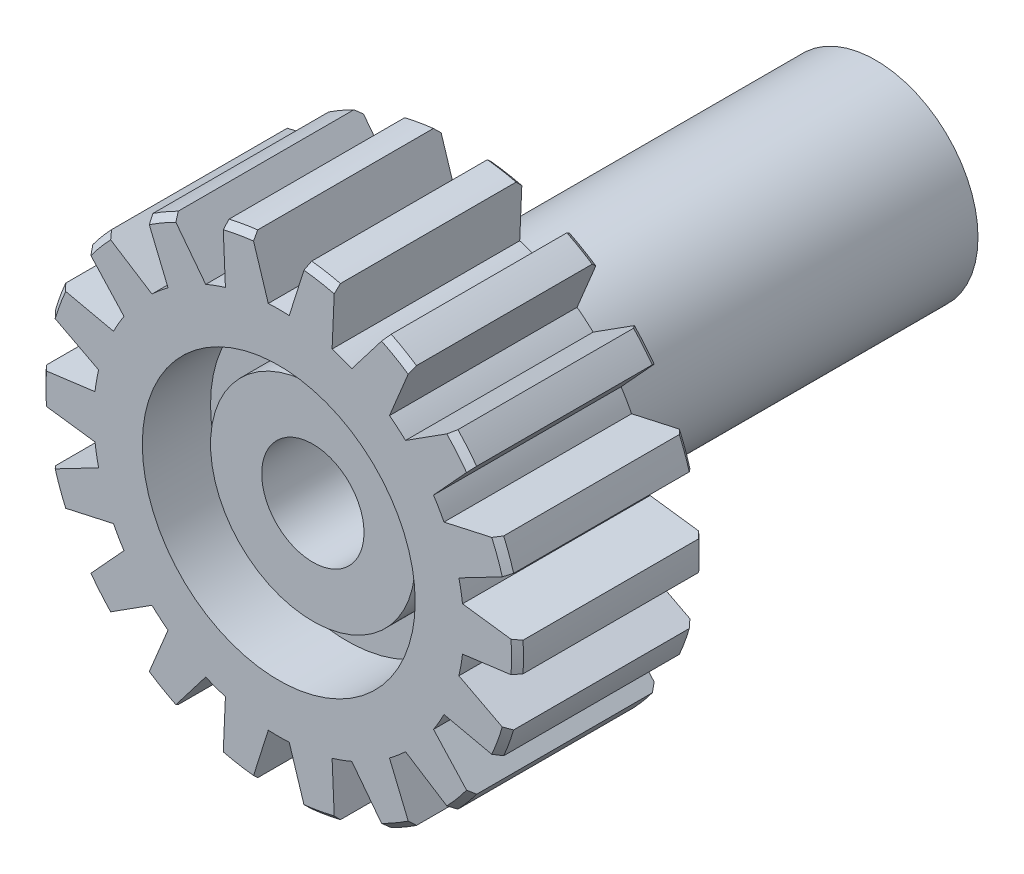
ISO-10303-21;
HEADER;
FILE_DESCRIPTION(('STEP AP214'),'2;1');
FILE_NAME('part.step','',(''),(''),'','','');
FILE_SCHEMA(('AUTOMOTIVE_DESIGN { 1 0 10303 214 1 1 1 1 }'));
ENDSEC;
DATA;
#1=APPLICATION_CONTEXT('core data for automotive mechanical design processes');
#2=APPLICATION_PROTOCOL_DEFINITION('international standard','automotive_design',2000,#1);
#3=PRODUCT_CONTEXT('',#1,'mechanical');
#4=PRODUCT('Part','Part','',(#3));
#5=PRODUCT_RELATED_PRODUCT_CATEGORY('part','',(#4));
#6=PRODUCT_DEFINITION_FORMATION('','',#4);
#7=PRODUCT_DEFINITION_CONTEXT('part definition',#1,'design');
#8=PRODUCT_DEFINITION('design','',#6,#7);
#9=PRODUCT_DEFINITION_SHAPE('','',#8);
#10=(LENGTH_UNIT() NAMED_UNIT(*) SI_UNIT(.MILLI.,.METRE.));
#11=(NAMED_UNIT(*) PLANE_ANGLE_UNIT() SI_UNIT($,.RADIAN.));
#12=(NAMED_UNIT(*) SI_UNIT($,.STERADIAN.) SOLID_ANGLE_UNIT());
#13=UNCERTAINTY_MEASURE_WITH_UNIT(LENGTH_MEASURE(1.E-05),#10,'distance_accuracy_value','');
#14=(GEOMETRIC_REPRESENTATION_CONTEXT(3) GLOBAL_UNCERTAINTY_ASSIGNED_CONTEXT((#13)) GLOBAL_UNIT_ASSIGNED_CONTEXT((#10,
#11,#12)) REPRESENTATION_CONTEXT('',''));
#15=CARTESIAN_POINT('',(0.,0.,0.));
#16=DIRECTION('',(0.,0.,1.));
#17=DIRECTION('',(1.,0.,0.));
#18=AXIS2_PLACEMENT_3D('',#15,#16,#17);
#19=CARTESIAN_POINT('',(0.,0.,0.750000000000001));
#20=DIRECTION('',(0.,0.,1.));
#21=DIRECTION('',(1.,0.,0.));
#22=AXIS2_PLACEMENT_3D('',#19,#20,#21);
#23=CYLINDRICAL_SURFACE('',#22,3.);
#24=CARTESIAN_POINT('',(0.,0.,0.750000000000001));
#25=DIRECTION('',(0.,0.,1.));
#26=DIRECTION('',(1.,0.,0.));
#27=AXIS2_PLACEMENT_3D('',#24,#25,#26);
#28=CIRCLE('',#27,3.);
#29=CARTESIAN_POINT('',(3.,0.,0.750000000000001));
#30=VERTEX_POINT('',#29);
#31=EDGE_CURVE('E795',#30,#30,#28,.T.);
#32=ORIENTED_EDGE('',*,*,#31,.T.);
#33=EDGE_LOOP('',(#32));
#34=FACE_BOUND('',#33,.T.);
#35=CARTESIAN_POINT('',(0.,0.,1.75));
#36=DIRECTION('',(0.,0.,1.));
#37=DIRECTION('',(1.,0.,0.));
#38=AXIS2_PLACEMENT_3D('',#35,#36,#37);
#39=CIRCLE('',#38,3.);
#40=CARTESIAN_POINT('',(3.,0.,1.75));
#41=VERTEX_POINT('',#40);
#42=EDGE_CURVE('E786',#41,#41,#39,.T.);
#43=ORIENTED_EDGE('',*,*,#42,.F.);
#44=EDGE_LOOP('',(#43));
#45=FACE_BOUND('',#44,.T.);
#46=ADVANCED_FACE('F33',(#34,#45),#23,.T.);
#47=CARTESIAN_POINT('',(0.,0.,-2.75));
#48=DIRECTION('',(0.,0.,1.));
#49=DIRECTION('',(1.,0.,0.));
#50=AXIS2_PLACEMENT_3D('',#47,#48,#49);
#51=PLANE('',#50);
#52=CARTESIAN_POINT('',(0.,0.,-2.75));
#53=DIRECTION('',(0.,0.,1.));
#54=DIRECTION('',(1.,0.,0.));
#55=AXIS2_PLACEMENT_3D('',#52,#53,#54);
#56=CIRCLE('',#55,6.825);
#57=CARTESIAN_POINT('',(-3.79535860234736,5.67237852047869,-2.75));
#58=VERTEX_POINT('',#57);
#59=CARTESIAN_POINT('',(-3.0147445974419,6.12306622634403,-2.75));
#60=VERTEX_POINT('',#59);
#61=EDGE_CURVE('E1715',#58,#60,#56,.F.);
#62=ORIENTED_EDGE('',*,*,#61,.T.);
#63=DIRECTION('',(0.608761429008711,-0.793353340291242,0.));
#64=VECTOR('',#63,1.);
#65=CARTESIAN_POINT('',(-2.14115624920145,4.98458372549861,-2.75));
#66=LINE('',#65,#64);
#67=CARTESIAN_POINT('',(-2.14115624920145,4.98458372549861,-2.75));
#68=VERTEX_POINT('',#67);
#69=EDGE_CURVE('E823',#60,#68,#66,.T.);
#70=ORIENTED_EDGE('',*,*,#69,.T.);
#71=CARTESIAN_POINT('',(0.,0.,-2.75));
#72=DIRECTION('',(0.,0.,-1.));
#73=DIRECTION('',(0.939692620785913,0.342020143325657,0.));
#74=AXIS2_PLACEMENT_3D('',#71,#72,#73);
#75=CIRCLE('',#74,5.425);
#76=CARTESIAN_POINT('',(-1.5638078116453,5.19472137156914,-2.75));
#77=VERTEX_POINT('',#76);
#78=EDGE_CURVE('E817',#68,#77,#75,.T.);
#79=ORIENTED_EDGE('',*,*,#78,.T.);
#80=DIRECTION('',(-0.0436193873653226,0.999048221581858,0.));
#81=VECTOR('',#80,1.);
#82=CARTESIAN_POINT('',(-1.5638078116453,5.19472137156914,-2.75));
#83=LINE('',#82,#81);
#84=CARTESIAN_POINT('',(-1.62640275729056,6.62838133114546,-2.75));
#85=VERTEX_POINT('',#84);
#86=EDGE_CURVE('E820',#77,#85,#83,.T.);
#87=ORIENTED_EDGE('',*,*,#86,.T.);
#88=CARTESIAN_POINT('',(-0.738721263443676,6.78490352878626,-2.75));
#89=VERTEX_POINT('',#88);
#90=EDGE_CURVE('E1705',#85,#89,#56,.F.);
#91=ORIENTED_EDGE('',*,*,#90,.T.);
#92=DIRECTION('',(0.300705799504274,-0.953716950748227,0.));
#93=VECTOR('',#92,1.);
#94=CARTESIAN_POINT('',(-0.307200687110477,5.4162951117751,-2.75));
#95=LINE('',#94,#93);
#96=CARTESIAN_POINT('',(-0.307200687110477,5.4162951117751,-2.75));
#97=VERTEX_POINT('',#96);
#98=EDGE_CURVE('E1808',#89,#97,#95,.T.);
#99=ORIENTED_EDGE('',*,*,#98,.T.);
#100=CARTESIAN_POINT('',(0.,0.,-2.75));
#101=DIRECTION('',(0.,0.,-1.));
#102=DIRECTION('',(1.,0.,0.));
#103=AXIS2_PLACEMENT_3D('',#100,#101,#102);
#104=CIRCLE('',#103,5.425);
#105=CARTESIAN_POINT('',(0.307200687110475,5.4162951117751,-2.75));
#106=VERTEX_POINT('',#105);
#107=EDGE_CURVE('E1833',#97,#106,#104,.T.);
#108=ORIENTED_EDGE('',*,*,#107,.T.);
#109=DIRECTION('',(0.300705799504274,0.953716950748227,0.));
#110=VECTOR('',#109,1.);
#111=CARTESIAN_POINT('',(0.307200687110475,5.4162951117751,-2.75));
#112=LINE('',#111,#110);
#113=CARTESIAN_POINT('',(0.738721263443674,6.78490352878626,-2.75));
#114=VERTEX_POINT('',#113);
#115=EDGE_CURVE('E1837',#106,#114,#112,.T.);
#116=ORIENTED_EDGE('',*,*,#115,.T.);
#117=CARTESIAN_POINT('',(1.62640275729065,6.62838133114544,-2.75));
#118=VERTEX_POINT('',#117);
#119=EDGE_CURVE('E1707',#114,#118,#56,.F.);
#120=ORIENTED_EDGE('',*,*,#119,.T.);
#121=DIRECTION('',(-0.043619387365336,-0.999048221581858,0.));
#122=VECTOR('',#121,1.);
#123=CARTESIAN_POINT('',(1.56380781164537,5.19472137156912,-2.75));
#124=LINE('',#123,#122);
#125=CARTESIAN_POINT('',(1.56380781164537,5.19472137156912,-2.75));
#126=VERTEX_POINT('',#125);
#127=EDGE_CURVE('E1639',#118,#126,#124,.T.);
#128=ORIENTED_EDGE('',*,*,#127,.T.);
#129=CARTESIAN_POINT('',(0.,0.,-2.75));
#130=DIRECTION('',(0.,0.,-1.));
#131=DIRECTION('',(0.939692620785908,-0.342020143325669,0.));
#132=AXIS2_PLACEMENT_3D('',#129,#130,#131);
#133=CIRCLE('',#132,5.425);
#134=CARTESIAN_POINT('',(2.14115624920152,4.98458372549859,-2.75));
#135=VERTEX_POINT('',#134);
#136=EDGE_CURVE('E1633',#126,#135,#133,.T.);
#137=ORIENTED_EDGE('',*,*,#136,.T.);
#138=DIRECTION('',(0.608761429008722,0.793353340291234,0.));
#139=VECTOR('',#138,1.);
#140=CARTESIAN_POINT('',(2.14115624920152,4.98458372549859,-2.75));
#141=LINE('',#140,#139);
#142=CARTESIAN_POINT('',(3.01474459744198,6.12306622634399,-2.75));
#143=VERTEX_POINT('',#142);
#144=EDGE_CURVE('E1636',#135,#143,#141,.T.);
#145=ORIENTED_EDGE('',*,*,#144,.T.);
#146=CARTESIAN_POINT('',(3.79535860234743,5.67237852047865,-2.75));
#147=VERTEX_POINT('',#146);
#148=EDGE_CURVE('E1709',#143,#147,#56,.F.);
#149=ORIENTED_EDGE('',*,*,#148,.T.);
#150=DIRECTION('',(-0.382683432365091,-0.923879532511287,0.));
#151=VECTOR('',#150,1.);
#152=CARTESIAN_POINT('',(3.2461980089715,4.3465875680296,-2.75));
#153=LINE('',#152,#151);
#154=CARTESIAN_POINT('',(3.2461980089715,4.3465875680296,-2.75));
#155=VERTEX_POINT('',#154);
#156=EDGE_CURVE('E2043',#147,#155,#153,.T.);
#157=ORIENTED_EDGE('',*,*,#156,.T.);
#158=CARTESIAN_POINT('',(0.,0.,-2.75));
#159=DIRECTION('',(0.,0.,-1.));
#160=DIRECTION('',(0.766044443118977,-0.642787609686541,0.));
#161=AXIS2_PLACEMENT_3D('',#158,#159,#160);
#162=CIRCLE('',#161,5.425);
#163=CARTESIAN_POINT('',(3.71685676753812,3.95165797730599,-2.75));
#164=VERTEX_POINT('',#163);
#165=EDGE_CURVE('E2036',#155,#164,#162,.T.);
#166=ORIENTED_EDGE('',*,*,#165,.T.);
#167=DIRECTION('',(0.843391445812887,0.537299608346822,0.));
#168=VECTOR('',#167,1.);
#169=CARTESIAN_POINT('',(3.71685676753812,3.95165797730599,-2.75));
#170=LINE('',#169,#168);
#171=CARTESIAN_POINT('',(4.92714524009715,4.72269677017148,-2.75));
#172=VERTEX_POINT('',#171);
#173=EDGE_CURVE('E1781',#164,#172,#170,.T.);
#174=ORIENTED_EDGE('',*,*,#173,.T.);
#175=CARTESIAN_POINT('',(5.50653818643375,4.03220314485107,-2.75));
#176=VERTEX_POINT('',#175);
#177=EDGE_CURVE('E1714',#172,#176,#56,.F.);
#178=ORIENTED_EDGE('',*,*,#177,.T.);
#179=DIRECTION('',(-0.675590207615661,-0.737277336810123,0.));
#180=VECTOR('',#179,1.);
#181=CARTESIAN_POINT('',(4.53704881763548,2.97419115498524,-2.75));
#182=LINE('',#181,#180);
#183=CARTESIAN_POINT('',(4.53704881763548,2.97419115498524,-2.75));
#184=VERTEX_POINT('',#183);
#185=EDGE_CURVE('E1570',#176,#184,#182,.T.);
#186=ORIENTED_EDGE('',*,*,#185,.T.);
#187=CARTESIAN_POINT('',(0.,0.,-2.75));
#188=DIRECTION('',(0.,0.,-1.));
#189=DIRECTION('',(0.499999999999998,-0.86602540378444,0.));
#190=AXIS2_PLACEMENT_3D('',#187,#188,#189);
#191=CIRCLE('',#190,5.425);
#192=CARTESIAN_POINT('',(4.84424950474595,2.44210395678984,-2.75));
#193=VERTEX_POINT('',#192);
#194=EDGE_CURVE('E1564',#184,#193,#191,.T.);
#195=ORIENTED_EDGE('',*,*,#194,.T.);
#196=DIRECTION('',(0.976296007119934,0.2164396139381,0.));
#197=VECTOR('',#196,1.);
#198=CARTESIAN_POINT('',(4.84424950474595,2.44210395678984,-2.75));
#199=LINE('',#198,#197);
#200=CARTESIAN_POINT('',(6.24525944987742,2.75270038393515,-2.75));
#201=VERTEX_POINT('',#200);
#202=EDGE_CURVE('E1567',#193,#201,#199,.T.);
#203=ORIENTED_EDGE('',*,*,#202,.T.);
#204=CARTESIAN_POINT('',(6.55354799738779,1.90568456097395,-2.75));
#205=VERTEX_POINT('',#204);
#206=EDGE_CURVE('E1768',#201,#205,#56,.F.);
#207=ORIENTED_EDGE('',*,*,#206,.T.);
#208=DIRECTION('',(-0.887010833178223,-0.461748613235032,0.));
#209=VECTOR('',#208,1.);
#210=CARTESIAN_POINT('',(5.28066457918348,1.24306339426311,-2.75));
#211=LINE('',#210,#209);
#212=CARTESIAN_POINT('',(5.28066457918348,1.24306339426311,-2.75));
#213=VERTEX_POINT('',#212);
#214=EDGE_CURVE('E3132',#205,#213,#211,.T.);
#215=ORIENTED_EDGE('',*,*,#214,.T.);
#216=CARTESIAN_POINT('',(0.,0.,-2.75));
#217=DIRECTION('',(0.,0.,-1.));
#218=DIRECTION('',(0.173648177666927,-0.984807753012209,0.));
#219=AXIS2_PLACEMENT_3D('',#216,#217,#218);
#220=CIRCLE('',#219,5.425);
#221=CARTESIAN_POINT('',(5.38735425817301,0.637996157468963,-2.75));
#222=VERTEX_POINT('',#221);
#223=EDGE_CURVE('E3139',#213,#222,#220,.T.);
#224=ORIENTED_EDGE('',*,*,#223,.T.);
#225=DIRECTION('',(0.99144486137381,-0.130526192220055,0.));
#226=VECTOR('',#225,1.);
#227=CARTESIAN_POINT('',(5.38735425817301,0.637996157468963,-2.75));
#228=LINE('',#227,#226);
#229=CARTESIAN_POINT('',(6.8101031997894,0.450687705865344,-2.75));
#230=VERTEX_POINT('',#229);
#231=EDGE_CURVE('E3137',#222,#230,#228,.T.);
#232=ORIENTED_EDGE('',*,*,#231,.T.);
#233=CARTESIAN_POINT('',(6.8101031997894,-0.450687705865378,-2.75));
#234=VERTEX_POINT('',#233);
#235=EDGE_CURVE('E1764',#230,#234,#56,.F.);
#236=ORIENTED_EDGE('',*,*,#235,.T.);
#237=DIRECTION('',(-0.991444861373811,-0.130526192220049,0.));
#238=VECTOR('',#237,1.);
#239=CARTESIAN_POINT('',(5.387354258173,-0.637996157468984,-2.75));
#240=LINE('',#239,#238);
#241=CARTESIAN_POINT('',(5.387354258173,-0.637996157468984,-2.75));
#242=VERTEX_POINT('',#241);
#243=EDGE_CURVE('E1501',#234,#242,#240,.T.);
#244=ORIENTED_EDGE('',*,*,#243,.T.);
#245=CARTESIAN_POINT('',(0.,0.,-2.75));
#246=DIRECTION('',(0.,0.,-1.));
#247=DIRECTION('',(-0.173648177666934,-0.984807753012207,0.));
#248=AXIS2_PLACEMENT_3D('',#245,#246,#247);
#249=CIRCLE('',#248,5.425);
#250=CARTESIAN_POINT('',(5.28066457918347,-1.24306339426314,-2.75));
#251=VERTEX_POINT('',#250);
#252=EDGE_CURVE('E1495',#242,#251,#249,.T.);
#253=ORIENTED_EDGE('',*,*,#252,.T.);
#254=DIRECTION('',(0.88701083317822,-0.461748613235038,0.));
#255=VECTOR('',#254,1.);
#256=CARTESIAN_POINT('',(5.28066457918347,-1.24306339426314,-2.75));
#257=LINE('',#256,#255);
#258=CARTESIAN_POINT('',(6.55354799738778,-1.90568456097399,-2.75));
#259=VERTEX_POINT('',#258);
#260=EDGE_CURVE('E1498',#251,#259,#257,.T.);
#261=ORIENTED_EDGE('',*,*,#260,.T.);
#262=CARTESIAN_POINT('',(6.2452594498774,-2.7527003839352,-2.75));
#263=VERTEX_POINT('',#262);
#264=EDGE_CURVE('E1760',#259,#263,#56,.F.);
#265=ORIENTED_EDGE('',*,*,#264,.T.);
#266=DIRECTION('',(-0.976296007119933,0.216439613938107,0.));
#267=VECTOR('',#266,1.);
#268=CARTESIAN_POINT('',(4.84424950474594,-2.44210395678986,-2.75));
#269=LINE('',#268,#267);
#270=CARTESIAN_POINT('',(4.84424950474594,-2.44210395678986,-2.75));
#271=VERTEX_POINT('',#270);
#272=EDGE_CURVE('E3168',#263,#271,#269,.T.);
#273=ORIENTED_EDGE('',*,*,#272,.T.);
#274=CARTESIAN_POINT('',(0.,0.,-2.75));
#275=DIRECTION('',(0.,0.,-1.));
#276=DIRECTION('',(-0.500000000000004,-0.866025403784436,0.));
#277=AXIS2_PLACEMENT_3D('',#274,#275,#276);
#278=CIRCLE('',#277,5.425);
#279=CARTESIAN_POINT('',(4.53704881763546,-2.97419115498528,-2.75));
#280=VERTEX_POINT('',#279);
#281=EDGE_CURVE('E3159',#271,#280,#278,.T.);
#282=ORIENTED_EDGE('',*,*,#281,.T.);
#283=DIRECTION('',(0.675590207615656,-0.737277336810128,0.));
#284=VECTOR('',#283,1.);
#285=CARTESIAN_POINT('',(4.53704881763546,-2.97419115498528,-2.75));
#286=LINE('',#285,#284);
#287=CARTESIAN_POINT('',(5.50653818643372,-4.03220314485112,-2.75));
#288=VERTEX_POINT('',#287);
#289=EDGE_CURVE('E3163',#280,#288,#286,.T.);
#290=ORIENTED_EDGE('',*,*,#289,.T.);
#291=CARTESIAN_POINT('',(4.92714524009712,-4.7226967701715,-2.75));
#292=VERTEX_POINT('',#291);
#293=EDGE_CURVE('E1756',#288,#292,#56,.F.);
#294=ORIENTED_EDGE('',*,*,#293,.T.);
#295=DIRECTION('',(-0.843391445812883,0.537299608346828,0.));
#296=VECTOR('',#295,1.);
#297=CARTESIAN_POINT('',(3.7168567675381,-3.95165797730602,-2.75));
#298=LINE('',#297,#296);
#299=CARTESIAN_POINT('',(3.7168567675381,-3.95165797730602,-2.75));
#300=VERTEX_POINT('',#299);
#301=EDGE_CURVE('E1432',#292,#300,#298,.T.);
#302=ORIENTED_EDGE('',*,*,#301,.T.);
#303=CARTESIAN_POINT('',(0.,0.,-2.75));
#304=DIRECTION('',(0.,0.,-1.));
#305=DIRECTION('',(-0.766044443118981,-0.642787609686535,0.));
#306=AXIS2_PLACEMENT_3D('',#303,#304,#305);
#307=CIRCLE('',#306,5.425);
#308=CARTESIAN_POINT('',(3.24619800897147,-4.34658756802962,-2.75));
#309=VERTEX_POINT('',#308);
#310=EDGE_CURVE('E1426',#300,#309,#307,.T.);
#311=ORIENTED_EDGE('',*,*,#310,.T.);
#312=DIRECTION('',(0.382683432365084,-0.923879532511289,0.));
#313=VECTOR('',#312,1.);
#314=CARTESIAN_POINT('',(3.24619800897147,-4.34658756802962,-2.75));
#315=LINE('',#314,#313);
#316=CARTESIAN_POINT('',(3.7953586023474,-5.67237852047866,-2.75));
#317=VERTEX_POINT('',#316);
#318=EDGE_CURVE('E1429',#309,#317,#315,.T.);
#319=ORIENTED_EDGE('',*,*,#318,.T.);
#320=CARTESIAN_POINT('',(3.01474459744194,-6.12306622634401,-2.75));
#321=VERTEX_POINT('',#320);
#322=EDGE_CURVE('E1752',#317,#321,#56,.F.);
#323=ORIENTED_EDGE('',*,*,#322,.T.);
#324=DIRECTION('',(-0.608761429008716,0.793353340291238,0.));
#325=VECTOR('',#324,1.);
#326=CARTESIAN_POINT('',(2.14115624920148,-4.98458372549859,-2.75));
#327=LINE('',#326,#325);
#328=CARTESIAN_POINT('',(2.14115624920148,-4.98458372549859,-2.75));
#329=VERTEX_POINT('',#328);
#330=EDGE_CURVE('E3197',#321,#329,#327,.T.);
#331=ORIENTED_EDGE('',*,*,#330,.T.);
#332=CARTESIAN_POINT('',(0.,0.,-2.75));
#333=DIRECTION('',(0.,0.,-1.));
#334=DIRECTION('',(-0.939692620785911,-0.342020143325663,0.));
#335=AXIS2_PLACEMENT_3D('',#332,#333,#334);
#336=CIRCLE('',#335,5.425);
#337=CARTESIAN_POINT('',(1.56380781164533,-5.19472137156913,-2.75));
#338=VERTEX_POINT('',#337);
#339=EDGE_CURVE('E3188',#329,#338,#336,.T.);
#340=ORIENTED_EDGE('',*,*,#339,.T.);
#341=DIRECTION('',(0.0436193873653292,-0.999048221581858,0.));
#342=VECTOR('',#341,1.);
#343=CARTESIAN_POINT('',(1.56380781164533,-5.19472137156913,-2.75));
#344=LINE('',#343,#342);
#345=CARTESIAN_POINT('',(1.62640275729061,-6.62838133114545,-2.75));
#346=VERTEX_POINT('',#345);
#347=EDGE_CURVE('E3192',#338,#346,#344,.T.);
#348=ORIENTED_EDGE('',*,*,#347,.T.);
#349=CARTESIAN_POINT('',(0.738721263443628,-6.78490352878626,-2.75));
#350=VERTEX_POINT('',#349);
#351=EDGE_CURVE('E1748',#346,#350,#56,.F.);
#352=ORIENTED_EDGE('',*,*,#351,.T.);
#353=DIRECTION('',(-0.300705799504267,0.953716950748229,0.));
#354=VECTOR('',#353,1.);
#355=CARTESIAN_POINT('',(0.307200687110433,-5.4162951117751,-2.75));
#356=LINE('',#355,#354);
#357=CARTESIAN_POINT('',(0.307200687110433,-5.4162951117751,-2.75));
#358=VERTEX_POINT('',#357);
#359=EDGE_CURVE('E1363',#350,#358,#356,.T.);
#360=ORIENTED_EDGE('',*,*,#359,.T.);
#361=CARTESIAN_POINT('',(0.,0.,-2.75));
#362=DIRECTION('',(0.,0.,-1.));
#363=DIRECTION('',(-1.,0.,0.));
#364=AXIS2_PLACEMENT_3D('',#361,#362,#363);
#365=CIRCLE('',#364,5.425);
#366=CARTESIAN_POINT('',(-0.307200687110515,-5.41629511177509,-2.75));
#367=VERTEX_POINT('',#366);
#368=EDGE_CURVE('E1357',#358,#367,#365,.T.);
#369=ORIENTED_EDGE('',*,*,#368,.T.);
#370=DIRECTION('',(-0.300705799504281,-0.953716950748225,0.));
#371=VECTOR('',#370,1.);
#372=CARTESIAN_POINT('',(-0.307200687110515,-5.41629511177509,-2.75));
#373=LINE('',#372,#371);
#374=CARTESIAN_POINT('',(-0.738721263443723,-6.78490352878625,-2.75));
#375=VERTEX_POINT('',#374);
#376=EDGE_CURVE('E1360',#367,#375,#373,.T.);
#377=ORIENTED_EDGE('',*,*,#376,.T.);
#378=CARTESIAN_POINT('',(-1.6264027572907,-6.62838133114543,-2.75));
#379=VERTEX_POINT('',#378);
#380=EDGE_CURVE('E1744',#375,#379,#56,.F.);
#381=ORIENTED_EDGE('',*,*,#380,.T.);
#382=DIRECTION('',(0.0436193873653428,0.999048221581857,0.));
#383=VECTOR('',#382,1.);
#384=CARTESIAN_POINT('',(-1.56380781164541,-5.1947213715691,-2.75));
#385=LINE('',#384,#383);
#386=CARTESIAN_POINT('',(-1.56380781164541,-5.1947213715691,-2.75));
#387=VERTEX_POINT('',#386);
#388=EDGE_CURVE('E3226',#379,#387,#385,.T.);
#389=ORIENTED_EDGE('',*,*,#388,.T.);
#390=CARTESIAN_POINT('',(0.,0.,-2.75));
#391=DIRECTION('',(0.,0.,-1.));
#392=DIRECTION('',(-0.939692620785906,0.342020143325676,0.));
#393=AXIS2_PLACEMENT_3D('',#390,#391,#392);
#394=CIRCLE('',#393,5.425);
#395=CARTESIAN_POINT('',(-2.14115624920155,-4.98458372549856,-2.75));
#396=VERTEX_POINT('',#395);
#397=EDGE_CURVE('E3217',#387,#396,#394,.T.);
#398=ORIENTED_EDGE('',*,*,#397,.T.);
#399=DIRECTION('',(-0.608761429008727,-0.79335334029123,0.));
#400=VECTOR('',#399,1.);
#401=CARTESIAN_POINT('',(-2.14115624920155,-4.98458372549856,-2.75));
#402=LINE('',#401,#400);
#403=CARTESIAN_POINT('',(-3.01474459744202,-6.12306622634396,-2.75));
#404=VERTEX_POINT('',#403);
#405=EDGE_CURVE('E3221',#396,#404,#402,.T.);
#406=ORIENTED_EDGE('',*,*,#405,.T.);
#407=CARTESIAN_POINT('',(-3.79535860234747,-5.6723785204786,-2.75));
#408=VERTEX_POINT('',#407);
#409=EDGE_CURVE('E1740',#404,#408,#56,.F.);
#410=ORIENTED_EDGE('',*,*,#409,.T.);
#411=DIRECTION('',(0.382683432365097,0.923879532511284,0.));
#412=VECTOR('',#411,1.);
#413=CARTESIAN_POINT('',(-3.24619800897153,-4.34658756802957,-2.75));
#414=LINE('',#413,#412);
#415=CARTESIAN_POINT('',(-3.24619800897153,-4.34658756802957,-2.75));
#416=VERTEX_POINT('',#415);
#417=EDGE_CURVE('E1294',#408,#416,#414,.T.);
#418=ORIENTED_EDGE('',*,*,#417,.T.);
#419=CARTESIAN_POINT('',(0.,0.,-2.75));
#420=DIRECTION('',(0.,0.,-1.));
#421=DIRECTION('',(-0.766044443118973,0.642787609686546,0.));
#422=AXIS2_PLACEMENT_3D('',#419,#420,#421);
#423=CIRCLE('',#422,5.425);
#424=CARTESIAN_POINT('',(-3.71685676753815,-3.95165797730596,-2.75));
#425=VERTEX_POINT('',#424);
#426=EDGE_CURVE('E1288',#416,#425,#423,.T.);
#427=ORIENTED_EDGE('',*,*,#426,.T.);
#428=DIRECTION('',(-0.84339144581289,-0.537299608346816,0.));
#429=VECTOR('',#428,1.);
#430=CARTESIAN_POINT('',(-3.71685676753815,-3.95165797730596,-2.75));
#431=LINE('',#430,#429);
#432=CARTESIAN_POINT('',(-4.92714524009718,-4.72269677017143,-2.75));
#433=VERTEX_POINT('',#432);
#434=EDGE_CURVE('E1291',#425,#433,#431,.T.);
#435=ORIENTED_EDGE('',*,*,#434,.T.);
#436=CARTESIAN_POINT('',(-5.50653818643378,-4.03220314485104,-2.75));
#437=VERTEX_POINT('',#436);
#438=EDGE_CURVE('E1736',#433,#437,#56,.F.);
#439=ORIENTED_EDGE('',*,*,#438,.T.);
#440=DIRECTION('',(0.675590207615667,0.737277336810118,0.));
#441=VECTOR('',#440,1.);
#442=CARTESIAN_POINT('',(-4.53704881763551,-2.97419115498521,-2.75));
#443=LINE('',#442,#441);
#444=CARTESIAN_POINT('',(-4.53704881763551,-2.97419115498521,-2.75));
#445=VERTEX_POINT('',#444);
#446=EDGE_CURVE('E3255',#437,#445,#443,.T.);
#447=ORIENTED_EDGE('',*,*,#446,.T.);
#448=CARTESIAN_POINT('',(0.,0.,-2.75));
#449=DIRECTION('',(0.,0.,-1.));
#450=DIRECTION('',(-0.499999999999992,0.866025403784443,0.));
#451=AXIS2_PLACEMENT_3D('',#448,#449,#450);
#452=CIRCLE('',#451,5.425);
#453=CARTESIAN_POINT('',(-4.84424950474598,-2.4421039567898,-2.75));
#454=VERTEX_POINT('',#453);
#455=EDGE_CURVE('E3246',#445,#454,#452,.T.);
#456=ORIENTED_EDGE('',*,*,#455,.T.);
#457=DIRECTION('',(-0.976296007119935,-0.216439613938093,0.));
#458=VECTOR('',#457,1.);
#459=CARTESIAN_POINT('',(-4.84424950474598,-2.4421039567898,-2.75));
#460=LINE('',#459,#458);
#461=CARTESIAN_POINT('',(-6.24525944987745,-2.7527003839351,-2.75));
#462=VERTEX_POINT('',#461);
#463=EDGE_CURVE('E3250',#454,#462,#460,.T.);
#464=ORIENTED_EDGE('',*,*,#463,.T.);
#465=CARTESIAN_POINT('',(-6.55354799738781,-1.90568456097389,-2.75));
#466=VERTEX_POINT('',#465);
#467=EDGE_CURVE('E1732',#462,#466,#56,.F.);
#468=ORIENTED_EDGE('',*,*,#467,.T.);
#469=DIRECTION('',(0.887010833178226,0.461748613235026,0.));
#470=VECTOR('',#469,1.);
#471=CARTESIAN_POINT('',(-5.28066457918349,-1.24306339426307,-2.75));
#472=LINE('',#471,#470);
#473=CARTESIAN_POINT('',(-5.28066457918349,-1.24306339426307,-2.75));
#474=VERTEX_POINT('',#473);
#475=EDGE_CURVE('E1225',#466,#474,#472,.T.);
#476=ORIENTED_EDGE('',*,*,#475,.T.);
#477=CARTESIAN_POINT('',(0.,0.,-2.75));
#478=DIRECTION('',(0.,0.,-1.));
#479=DIRECTION('',(-0.173648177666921,0.98480775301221,0.));
#480=AXIS2_PLACEMENT_3D('',#477,#478,#479);
#481=CIRCLE('',#480,5.425);
#482=CARTESIAN_POINT('',(-5.38735425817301,-0.637996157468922,-2.75));
#483=VERTEX_POINT('',#482);
#484=EDGE_CURVE('E1219',#474,#483,#481,.T.);
#485=ORIENTED_EDGE('',*,*,#484,.T.);
#486=DIRECTION('',(-0.991444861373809,0.130526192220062,0.));
#487=VECTOR('',#486,1.);
#488=CARTESIAN_POINT('',(-5.38735425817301,-0.637996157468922,-2.75));
#489=LINE('',#488,#487);
#490=CARTESIAN_POINT('',(-6.8101031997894,-0.450687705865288,-2.75));
#491=VERTEX_POINT('',#490);
#492=EDGE_CURVE('E1222',#483,#491,#489,.T.);
#493=ORIENTED_EDGE('',*,*,#492,.T.);
#494=CARTESIAN_POINT('',(-6.8101031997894,0.450687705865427,-2.75));
#495=VERTEX_POINT('',#494);
#496=EDGE_CURVE('E1728',#491,#495,#56,.F.);
#497=ORIENTED_EDGE('',*,*,#496,.T.);
#498=DIRECTION('',(0.991444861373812,0.130526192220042,0.));
#499=VECTOR('',#498,1.);
#500=CARTESIAN_POINT('',(-5.387354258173,0.637996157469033,-2.75));
#501=LINE('',#500,#499);
#502=CARTESIAN_POINT('',(-5.387354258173,0.637996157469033,-2.75));
#503=VERTEX_POINT('',#502);
#504=EDGE_CURVE('E3279',#495,#503,#501,.T.);
#505=ORIENTED_EDGE('',*,*,#504,.T.);
#506=CARTESIAN_POINT('',(0.,0.,-2.75));
#507=DIRECTION('',(0.,0.,-1.));
#508=DIRECTION('',(0.17364817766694,0.984807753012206,0.));
#509=AXIS2_PLACEMENT_3D('',#506,#507,#508);
#510=CIRCLE('',#509,5.425);
#511=CARTESIAN_POINT('',(-5.28066457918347,1.24306339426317,-2.75));
#512=VERTEX_POINT('',#511);
#513=EDGE_CURVE('E3283',#503,#512,#510,.T.);
#514=ORIENTED_EDGE('',*,*,#513,.T.);
#515=DIRECTION('',(-0.887010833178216,0.461748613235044,0.));
#516=VECTOR('',#515,1.);
#517=CARTESIAN_POINT('',(-5.28066457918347,1.24306339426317,-2.75));
#518=LINE('',#517,#516);
#519=CARTESIAN_POINT('',(-6.55354799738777,1.90568456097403,-2.75));
#520=VERTEX_POINT('',#519);
#521=EDGE_CURVE('E3281',#512,#520,#518,.T.);
#522=ORIENTED_EDGE('',*,*,#521,.T.);
#523=CARTESIAN_POINT('',(-6.24525944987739,2.75270038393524,-2.75));
#524=VERTEX_POINT('',#523);
#525=EDGE_CURVE('E1724',#520,#524,#56,.F.);
#526=ORIENTED_EDGE('',*,*,#525,.T.);
#527=DIRECTION('',(0.976296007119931,-0.216439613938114,0.));
#528=VECTOR('',#527,1.);
#529=CARTESIAN_POINT('',(-4.84424950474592,2.44210395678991,-2.75));
#530=LINE('',#529,#528);
#531=CARTESIAN_POINT('',(-4.84424950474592,2.44210395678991,-2.75));
#532=VERTEX_POINT('',#531);
#533=EDGE_CURVE('E1156',#524,#532,#530,.T.);
#534=ORIENTED_EDGE('',*,*,#533,.T.);
#535=CARTESIAN_POINT('',(0.,0.,-2.75));
#536=DIRECTION('',(0.,0.,-1.));
#537=DIRECTION('',(0.50000000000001,0.866025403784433,0.));
#538=AXIS2_PLACEMENT_3D('',#535,#536,#537);
#539=CIRCLE('',#538,5.425);
#540=CARTESIAN_POINT('',(-4.53704881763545,2.97419115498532,-2.75));
#541=VERTEX_POINT('',#540);
#542=EDGE_CURVE('E1150',#532,#541,#539,.T.);
#543=ORIENTED_EDGE('',*,*,#542,.T.);
#544=DIRECTION('',(-0.675590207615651,0.737277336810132,0.));
#545=VECTOR('',#544,1.);
#546=CARTESIAN_POINT('',(-4.53704881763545,2.97419115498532,-2.75));
#547=LINE('',#546,#545);
#548=CARTESIAN_POINT('',(-5.5065381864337,4.03220314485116,-2.75));
#549=VERTEX_POINT('',#548);
#550=EDGE_CURVE('E1153',#541,#549,#547,.T.);
#551=ORIENTED_EDGE('',*,*,#550,.T.);
#552=CARTESIAN_POINT('',(-4.92714524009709,4.72269677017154,-2.75));
#553=VERTEX_POINT('',#552);
#554=EDGE_CURVE('E1720',#549,#553,#56,.F.);
#555=ORIENTED_EDGE('',*,*,#554,.T.);
#556=DIRECTION('',(0.84339144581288,-0.537299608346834,0.));
#557=VECTOR('',#556,1.);
#558=CARTESIAN_POINT('',(-3.71685676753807,3.95165797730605,-2.75));
#559=LINE('',#558,#557);
#560=CARTESIAN_POINT('',(-3.71685676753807,3.95165797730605,-2.75));
#561=VERTEX_POINT('',#560);
#562=EDGE_CURVE('E3298',#553,#561,#559,.T.);
#563=ORIENTED_EDGE('',*,*,#562,.T.);
#564=CARTESIAN_POINT('',(0.,0.,-2.75));
#565=DIRECTION('',(0.,0.,-1.));
#566=DIRECTION('',(0.766044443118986,0.64278760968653,0.));
#567=AXIS2_PLACEMENT_3D('',#564,#565,#566);
#568=CIRCLE('',#567,5.425);
#569=CARTESIAN_POINT('',(-3.24619800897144,4.34658756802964,-2.75));
#570=VERTEX_POINT('',#569);
#571=EDGE_CURVE('E3307',#561,#570,#568,.T.);
#572=ORIENTED_EDGE('',*,*,#571,.T.);
#573=DIRECTION('',(-0.382683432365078,0.923879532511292,0.));
#574=VECTOR('',#573,1.);
#575=CARTESIAN_POINT('',(-3.24619800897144,4.34658756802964,-2.75));
#576=LINE('',#575,#574);
#577=EDGE_CURVE('E3305',#570,#58,#576,.T.);
#578=ORIENTED_EDGE('',*,*,#577,.T.);
#579=EDGE_LOOP('',(#62,#70,#79,#87,#91,#99,#108,#116,#120,#128,#137,#145,#149,#157,#166,#174,
#178,#186,#195,#203,#207,#215,#224,#232,#236,#244,#253,#261,#265,#273,#282,#290,#294,#302,#311,
#319,#323,#331,#340,#348,#352,#360,#369,#377,#381,#389,#398,#406,#410,#418,#427,#435,#439,#447,
#456,#464,#468,#476,#485,#493,#497,#505,#514,#522,#526,#534,#543,#551,#555,#563,#572,#578));
#580=FACE_BOUND('',#579,.T.);
#581=CARTESIAN_POINT('',(0.,0.,-2.75));
#582=DIRECTION('',(0.,0.,1.));
#583=DIRECTION('',(1.,0.,0.));
#584=AXIS2_PLACEMENT_3D('',#581,#582,#583);
#585=CIRCLE('',#584,3.);
#586=CARTESIAN_POINT('',(3.,0.,-2.75));
#587=VERTEX_POINT('',#586);
#588=EDGE_CURVE('E11',#587,#587,#585,.F.);
#589=ORIENTED_EDGE('',*,*,#588,.F.);
#590=EDGE_LOOP('',(#589));
#591=FACE_BOUND('',#590,.T.);
#592=ADVANCED_FACE('F1777',(#580,#591),#51,.F.);
#593=CARTESIAN_POINT('',(0.,0.,2.75));
#594=DIRECTION('',(0.,0.,-1.));
#595=DIRECTION('',(-1.,0.,0.));
#596=AXIS2_PLACEMENT_3D('',#593,#594,#595);
#597=CYLINDRICAL_SURFACE('',#596,7.);
#598=CARTESIAN_POINT('',(0.,0.,2.57499999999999));
#599=DIRECTION('',(0.,0.,1.));
#600=DIRECTION('',(1.,0.,0.));
#601=AXIS2_PLACEMENT_3D('',#598,#599,#600);
#602=CIRCLE('',#601,7.);
#603=CARTESIAN_POINT('',(-3.86361486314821,5.83716371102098,2.57499999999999));
#604=VERTEX_POINT('',#603);
#605=CARTESIAN_POINT('',(-3.12332462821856,6.26457047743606,2.57499999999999));
#606=VERTEX_POINT('',#605);
#607=EDGE_CURVE('E1942',#604,#606,#602,.F.);
#608=ORIENTED_EDGE('',*,*,#607,.T.);
#609=DIRECTION('',(0.,0.,1.));
#610=VECTOR('',#609,1.);
#611=CARTESIAN_POINT('',(-3.12332462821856,6.26457047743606,-2.75));
#612=LINE('',#611,#610);
#613=CARTESIAN_POINT('',(-3.12332462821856,6.26457047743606,-2.57500000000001));
#614=VERTEX_POINT('',#613);
#615=EDGE_CURVE('E831',#614,#606,#612,.T.);
#616=ORIENTED_EDGE('',*,*,#615,.F.);
#617=CARTESIAN_POINT('',(0.,0.,-2.57500000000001));
#618=DIRECTION('',(0.,0.,1.));
#619=DIRECTION('',(1.,0.,0.));
#620=AXIS2_PLACEMENT_3D('',#617,#618,#619);
#621=CIRCLE('',#620,7.);
#622=CARTESIAN_POINT('',(-3.86361486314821,5.83716371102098,-2.57500000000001));
#623=VERTEX_POINT('',#622);
#624=EDGE_CURVE('E1702',#614,#623,#621,.T.);
#625=ORIENTED_EDGE('',*,*,#624,.T.);
#626=DIRECTION('',(0.,0.,1.));
#627=VECTOR('',#626,1.);
#628=CARTESIAN_POINT('',(-3.86361486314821,5.83716371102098,-2.75));
#629=LINE('',#628,#627);
#630=EDGE_CURVE('E3299',#623,#604,#629,.T.);
#631=ORIENTED_EDGE('',*,*,#630,.T.);
#632=EDGE_LOOP('',(#608,#616,#625,#631));
#633=FACE_BOUND('',#632,.T.);
#634=ADVANCED_FACE('F2076',(#633),#597,.T.);
#635=CARTESIAN_POINT('',(0.,0.,2.75));
#636=DIRECTION('',(0.,0.,-1.));
#637=DIRECTION('',(-1.,0.,0.));
#638=AXIS2_PLACEMENT_3D('',#635,#636,#637);
#639=CONICAL_SURFACE('',#638,6.825,0.785398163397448);
#640=CARTESIAN_POINT('',(-3.12344865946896,6.26473211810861,2.5748));
#641=CARTESIAN_POINT('',(-3.10531500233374,6.24109987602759,2.60404066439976));
#642=CARTESIAN_POINT('',(-3.08717915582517,6.21746478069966,2.63327766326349));
#643=CARTESIAN_POINT('',(-3.05090308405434,6.1701888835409,2.69174432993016));
#644=CARTESIAN_POINT('',(-3.03276285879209,6.14654808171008,2.72097399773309));
#645=CARTESIAN_POINT('',(-3.01462044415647,6.12290442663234,2.75019999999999));
#646=B_SPLINE_CURVE_WITH_KNOTS('',3,(#640,#641,#642,#643,#644,#645),.UNSPECIFIED.,.F.,.F.,(4,2,
4),(0.,0.125223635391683,0.250447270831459),.UNSPECIFIED.);
#647=CARTESIAN_POINT('',(-3.0147445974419,6.12306622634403,2.75));
#648=VERTEX_POINT('',#647);
#649=EDGE_CURVE('E841',#606,#648,#646,.T.);
#650=ORIENTED_EDGE('',*,*,#649,.F.);
#651=ORIENTED_EDGE('',*,*,#607,.F.);
#652=CARTESIAN_POINT('',(-3.79528055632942,5.67219010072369,2.75019999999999));
#653=CARTESIAN_POINT('',(-3.80668535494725,5.699723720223,2.72097399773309));
#654=CARTESIAN_POINT('',(-3.81808877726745,5.7272540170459,2.69174432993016));
#655=CARTESIAN_POINT('',(-3.84089286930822,5.78230796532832,2.63327766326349));
#656=CARTESIAN_POINT('',(-3.85229353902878,5.80983161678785,2.60404066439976));
#657=CARTESIAN_POINT('',(-3.86369283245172,5.83735194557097,2.5748));
#658=B_SPLINE_CURVE_WITH_KNOTS('',3,(#652,#653,#654,#655,#656,#657),.UNSPECIFIED.,.F.,.F.,(4,2,
4),(0.,0.125223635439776,0.250447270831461),.UNSPECIFIED.);
#659=CARTESIAN_POINT('',(-3.79535860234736,5.67237852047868,2.75));
#660=VERTEX_POINT('',#659);
#661=EDGE_CURVE('E1128',#660,#604,#658,.T.);
#662=ORIENTED_EDGE('',*,*,#661,.F.);
#663=CARTESIAN_POINT('',(0.,0.,2.75));
#664=DIRECTION('',(0.,0.,1.));
#665=DIRECTION('',(1.,0.,0.));
#666=AXIS2_PLACEMENT_3D('',#663,#664,#665);
#667=CIRCLE('',#666,6.825);
#668=EDGE_CURVE('E1697',#648,#660,#667,.T.);
#669=ORIENTED_EDGE('',*,*,#668,.F.);
#670=EDGE_LOOP('',(#650,#651,#662,#669));
#671=FACE_BOUND('',#670,.T.);
#672=ADVANCED_FACE('F1940',(#671),#639,.T.);
#673=CARTESIAN_POINT('',(0.,0.,-2.57500000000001));
#674=DIRECTION('',(0.,0.,1.));
#675=DIRECTION('',(1.,0.,0.));
#676=AXIS2_PLACEMENT_3D('',#673,#674,#675);
#677=CONICAL_SURFACE('',#676,7.,0.785398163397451);
#678=CARTESIAN_POINT('',(-3.01462044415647,6.12290442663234,-2.75019999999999));
#679=CARTESIAN_POINT('',(-3.03276285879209,6.14654808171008,-2.72097399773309));
#680=CARTESIAN_POINT('',(-3.05090308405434,6.1701888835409,-2.69174432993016));
#681=CARTESIAN_POINT('',(-3.08717915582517,6.21746478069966,-2.63327766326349));
#682=CARTESIAN_POINT('',(-3.10531500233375,6.24109987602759,-2.60404066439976));
#683=CARTESIAN_POINT('',(-3.12344865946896,6.26473211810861,-2.5748));
#684=B_SPLINE_CURVE_WITH_KNOTS('',3,(#678,#679,#680,#681,#682,#683),.UNSPECIFIED.,.F.,.F.,(4,2,
4),(0.,0.125223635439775,0.250447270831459),.UNSPECIFIED.);
#685=EDGE_CURVE('E42',#60,#614,#684,.T.);
#686=ORIENTED_EDGE('',*,*,#685,.F.);
#687=ORIENTED_EDGE('',*,*,#61,.F.);
#688=CARTESIAN_POINT('',(-3.86369283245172,5.83735194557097,-2.5748));
#689=CARTESIAN_POINT('',(-3.85229353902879,5.80983161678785,-2.60404066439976));
#690=CARTESIAN_POINT('',(-3.84089286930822,5.78230796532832,-2.63327766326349));
#691=CARTESIAN_POINT('',(-3.81808877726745,5.7272540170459,-2.69174432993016));
#692=CARTESIAN_POINT('',(-3.80668535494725,5.699723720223,-2.72097399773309));
#693=CARTESIAN_POINT('',(-3.79528055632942,5.67219010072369,-2.75019999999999));
#694=B_SPLINE_CURVE_WITH_KNOTS('',3,(#688,#689,#690,#691,#692,#693),.UNSPECIFIED.,.F.,.F.,(4,2,
4),(0.,0.125223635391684,0.250447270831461),.UNSPECIFIED.);
#695=EDGE_CURVE('E1113',#623,#58,#694,.T.);
#696=ORIENTED_EDGE('',*,*,#695,.F.);
#697=ORIENTED_EDGE('',*,*,#624,.F.);
#698=EDGE_LOOP('',(#686,#687,#696,#697));
#699=FACE_BOUND('',#698,.T.);
#700=ADVANCED_FACE('F883',(#699),#677,.T.);
#701=CARTESIAN_POINT('',(-5.62703794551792,4.16370555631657,2.57499999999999));
#702=VERTEX_POINT('',#701);
#703=CARTESIAN_POINT('',(-5.07757439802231,4.81853071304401,2.57499999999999));
#704=VERTEX_POINT('',#703);
#705=EDGE_CURVE('E1945',#702,#704,#602,.F.);
#706=ORIENTED_EDGE('',*,*,#705,.T.);
#707=DIRECTION('',(0.,0.,1.));
#708=VECTOR('',#707,1.);
#709=CARTESIAN_POINT('',(-5.07757439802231,4.81853071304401,-2.75));
#710=LINE('',#709,#708);
#711=CARTESIAN_POINT('',(-5.07757439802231,4.81853071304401,-2.57500000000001));
#712=VERTEX_POINT('',#711);
#713=EDGE_CURVE('E3296',#712,#704,#710,.T.);
#714=ORIENTED_EDGE('',*,*,#713,.F.);
#715=CARTESIAN_POINT('',(-5.62703794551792,4.16370555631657,-2.57500000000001));
#716=VERTEX_POINT('',#715);
#717=EDGE_CURVE('E3102',#712,#716,#621,.T.);
#718=ORIENTED_EDGE('',*,*,#717,.T.);
#719=DIRECTION('',(0.,0.,1.));
#720=VECTOR('',#719,1.);
#721=CARTESIAN_POINT('',(-5.62703794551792,4.16370555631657,-2.75));
#722=LINE('',#721,#720);
#723=EDGE_CURVE('E1166',#716,#702,#722,.T.);
#724=ORIENTED_EDGE('',*,*,#723,.T.);
#725=EDGE_LOOP('',(#706,#714,#718,#724));
#726=FACE_BOUND('',#725,.T.);
#727=ADVANCED_FACE('F2542',(#726),#597,.T.);
#728=CARTESIAN_POINT('',(-5.07774623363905,4.8186401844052,2.5748));
#729=CARTESIAN_POINT('',(-5.05262346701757,4.80263521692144,2.60404066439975));
#730=CARTESIAN_POINT('',(-5.02749766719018,4.78662831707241,2.63327766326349));
#731=CARTESIAN_POINT('',(-4.97724000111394,4.75461065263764,2.69174432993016));
#732=CARTESIAN_POINT('',(-4.95210813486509,4.73859988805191,2.72097399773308));
#733=CARTESIAN_POINT('',(-4.92697323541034,4.72258719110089,2.75019999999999));
#734=B_SPLINE_CURVE_WITH_KNOTS('',3,(#728,#729,#730,#731,#732,#733),.UNSPECIFIED.,.F.,.F.,(4,2,
4),(0.,0.125223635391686,0.250447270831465),.UNSPECIFIED.);
#735=CARTESIAN_POINT('',(-4.92714524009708,4.72269677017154,2.75));
#736=VERTEX_POINT('',#735);
#737=EDGE_CURVE('E1134',#704,#736,#734,.T.);
#738=ORIENTED_EDGE('',*,*,#737,.F.);
#739=ORIENTED_EDGE('',*,*,#705,.F.);
#740=CARTESIAN_POINT('',(-5.50640040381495,4.03205278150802,2.75019999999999));
#741=CARTESIAN_POINT('',(-5.5265344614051,4.05402524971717,2.72097399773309));
#742=CARTESIAN_POINT('',(-5.54666608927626,4.07599506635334,2.69174432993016));
#743=CARTESIAN_POINT('',(-5.58692448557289,4.11992939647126,2.63327766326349));
#744=CARTESIAN_POINT('',(-5.60705125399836,4.14189390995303,2.60404066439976));
#745=CARTESIAN_POINT('',(-5.62717559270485,4.1638557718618,2.5748));
#746=B_SPLINE_CURVE_WITH_KNOTS('',3,(#740,#741,#742,#743,#744,#745),.UNSPECIFIED.,.F.,.F.,(4,2,
4),(0.,0.125223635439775,0.250447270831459),.UNSPECIFIED.);
#747=CARTESIAN_POINT('',(-5.50653818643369,4.03220314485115,2.75));
#748=VERTEX_POINT('',#747);
#749=EDGE_CURVE('E1163',#748,#702,#746,.T.);
#750=ORIENTED_EDGE('',*,*,#749,.F.);
#751=EDGE_CURVE('E1916',#736,#748,#667,.T.);
#752=ORIENTED_EDGE('',*,*,#751,.F.);
#753=EDGE_LOOP('',(#738,#739,#750,#752));
#754=FACE_BOUND('',#753,.T.);
#755=ADVANCED_FACE('F2549',(#754),#639,.T.);
#756=CARTESIAN_POINT('',(-4.92697323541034,4.72258719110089,-2.75019999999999));
#757=CARTESIAN_POINT('',(-4.95210813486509,4.73859988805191,-2.72097399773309));
#758=CARTESIAN_POINT('',(-4.97724000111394,4.75461065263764,-2.69174432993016));
#759=CARTESIAN_POINT('',(-5.02749766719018,4.78662831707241,-2.63327766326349));
#760=CARTESIAN_POINT('',(-5.05262346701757,4.80263521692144,-2.60404066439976));
#761=CARTESIAN_POINT('',(-5.07774623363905,4.8186401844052,-2.5748));
#762=B_SPLINE_CURVE_WITH_KNOTS('',3,(#756,#757,#758,#759,#760,#761),.UNSPECIFIED.,.F.,.F.,(4,2,
4),(0.,0.125223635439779,0.250447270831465),.UNSPECIFIED.);
#763=EDGE_CURVE('E869',#553,#712,#762,.T.);
#764=ORIENTED_EDGE('',*,*,#763,.F.);
#765=ORIENTED_EDGE('',*,*,#554,.F.);
#766=CARTESIAN_POINT('',(-5.62717559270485,4.1638557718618,-2.5748));
#767=CARTESIAN_POINT('',(-5.60705125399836,4.14189390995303,-2.60404066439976));
#768=CARTESIAN_POINT('',(-5.5869244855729,4.11992939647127,-2.63327766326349));
#769=CARTESIAN_POINT('',(-5.54666608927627,4.07599506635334,-2.69174432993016));
#770=CARTESIAN_POINT('',(-5.5265344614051,4.05402524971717,-2.72097399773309));
#771=CARTESIAN_POINT('',(-5.50640040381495,4.03205278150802,-2.75019999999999));
#772=B_SPLINE_CURVE_WITH_KNOTS('',3,(#766,#767,#768,#769,#770,#771),.UNSPECIFIED.,.F.,.F.,(4,2,
4),(0.,0.125223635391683,0.250447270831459),.UNSPECIFIED.);
#773=EDGE_CURVE('E1100',#716,#549,#772,.T.);
#774=ORIENTED_EDGE('',*,*,#773,.F.);
#775=ORIENTED_EDGE('',*,*,#717,.F.);
#776=EDGE_LOOP('',(#764,#765,#774,#775));
#777=FACE_BOUND('',#776,.T.);
#778=ADVANCED_FACE('F2557',(#777),#677,.T.);
#779=CARTESIAN_POINT('',(-6.71175720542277,1.98804306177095,2.57499999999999));
#780=VERTEX_POINT('',#779);
#781=CARTESIAN_POINT('',(-6.41939375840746,2.79130503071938,2.57499999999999));
#782=VERTEX_POINT('',#781);
#783=EDGE_CURVE('E1947',#780,#782,#602,.F.);
#784=ORIENTED_EDGE('',*,*,#783,.T.);
#785=DIRECTION('',(0.,0.,1.));
#786=VECTOR('',#785,1.);
#787=CARTESIAN_POINT('',(-6.41939375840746,2.79130503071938,-2.75));
#788=LINE('',#787,#786);
#789=CARTESIAN_POINT('',(-6.41939375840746,2.79130503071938,-2.57500000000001));
#790=VERTEX_POINT('',#789);
#791=EDGE_CURVE('E1164',#790,#782,#788,.T.);
#792=ORIENTED_EDGE('',*,*,#791,.F.);
#793=CARTESIAN_POINT('',(-6.71175720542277,1.98804306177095,-2.57500000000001));
#794=VERTEX_POINT('',#793);
#795=EDGE_CURVE('E3101',#790,#794,#621,.T.);
#796=ORIENTED_EDGE('',*,*,#795,.T.);
#797=DIRECTION('',(0.,0.,1.));
#798=VECTOR('',#797,1.);
#799=CARTESIAN_POINT('',(-6.71175720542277,1.98804306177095,-2.75));
#800=LINE('',#799,#798);
#801=EDGE_CURVE('E3273',#794,#780,#800,.T.);
#802=ORIENTED_EDGE('',*,*,#801,.T.);
#803=EDGE_LOOP('',(#784,#792,#796,#802));
#804=FACE_BOUND('',#803,.T.);
#805=ADVANCED_FACE('F2564',(#804),#597,.T.);
#806=CARTESIAN_POINT('',(-6.41959375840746,2.79134936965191,2.5747989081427));
#807=CARTESIAN_POINT('',(-6.39051187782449,2.78490207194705,2.60403975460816));
#808=CARTESIAN_POINT('',(-6.3614264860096,2.77845399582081,2.63327693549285));
#809=CARTESIAN_POINT('',(-6.3032486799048,2.7655562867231,2.69174396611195));
#810=CARTESIAN_POINT('',(-6.2741562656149,2.75910665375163,2.72097381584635));
#811=CARTESIAN_POINT('',(-6.24506034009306,2.75265624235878,2.75019999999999));
#812=B_SPLINE_CURVE_WITH_KNOTS('',3,(#806,#807,#808,#809,#810,#811),.UNSPECIFIED.,.F.,.F.,(4,2,
4),(0.,0.125224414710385,0.250448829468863),.UNSPECIFIED.);
#813=CARTESIAN_POINT('',(-6.24525944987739,2.75270038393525,2.75));
#814=VERTEX_POINT('',#813);
#815=EDGE_CURVE('E1174',#782,#814,#812,.T.);
#816=ORIENTED_EDGE('',*,*,#815,.F.);
#817=ORIENTED_EDGE('',*,*,#783,.F.);
#818=CARTESIAN_POINT('',(-6.55336709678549,1.90559039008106,2.75019999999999));
#819=CARTESIAN_POINT('',(-6.57980194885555,1.91935150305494,2.72097399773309));
#820=CARTESIAN_POINT('',(-6.60623361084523,1.93311095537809,2.69174432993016));
#821=CARTESIAN_POINT('',(-6.6590905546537,1.96062653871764,2.63327766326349));
#822=CARTESIAN_POINT('',(-6.68551583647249,1.97438266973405,2.60404066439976));
#823=CARTESIAN_POINT('',(-6.71193792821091,1.98813714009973,2.5748));
#824=B_SPLINE_CURVE_WITH_KNOTS('',3,(#818,#819,#820,#821,#822,#823),.UNSPECIFIED.,.F.,.F.,(4,2,
4),(0.,0.125223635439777,0.250447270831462),.UNSPECIFIED.);
#825=CARTESIAN_POINT('',(-6.55354799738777,1.90568456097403,2.75));
#826=VERTEX_POINT('',#825);
#827=EDGE_CURVE('E1207',#826,#780,#824,.T.);
#828=ORIENTED_EDGE('',*,*,#827,.F.);
#829=EDGE_CURVE('E1912',#814,#826,#667,.T.);
#830=ORIENTED_EDGE('',*,*,#829,.F.);
#831=EDGE_LOOP('',(#816,#817,#828,#830));
#832=FACE_BOUND('',#831,.T.);
#833=ADVANCED_FACE('F2572',(#832),#639,.T.);
#834=CARTESIAN_POINT('',(-6.24506034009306,2.75265624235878,-2.75019999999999));
#835=CARTESIAN_POINT('',(-6.2741562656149,2.75910665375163,-2.72097381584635));
#836=CARTESIAN_POINT('',(-6.30324867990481,2.7655562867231,-2.69174396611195));
#837=CARTESIAN_POINT('',(-6.3614264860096,2.77845399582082,-2.63327693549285));
#838=CARTESIAN_POINT('',(-6.39051187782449,2.78490207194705,-2.60403975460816));
#839=CARTESIAN_POINT('',(-6.41959375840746,2.79134936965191,-2.5747989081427));
#840=B_SPLINE_CURVE_WITH_KNOTS('',3,(#834,#835,#836,#837,#838,#839),.UNSPECIFIED.,.F.,.F.,(4,2,
4),(0.,0.125224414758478,0.250448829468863),.UNSPECIFIED.);
#841=EDGE_CURVE('E1107',#524,#790,#840,.T.);
#842=ORIENTED_EDGE('',*,*,#841,.F.);
#843=ORIENTED_EDGE('',*,*,#525,.F.);
#844=CARTESIAN_POINT('',(-6.71193792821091,1.98813714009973,-2.5748));
#845=CARTESIAN_POINT('',(-6.68551583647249,1.97438266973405,-2.60404066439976));
#846=CARTESIAN_POINT('',(-6.6590905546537,1.96062653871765,-2.63327766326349));
#847=CARTESIAN_POINT('',(-6.60623361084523,1.93311095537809,-2.69174432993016));
#848=CARTESIAN_POINT('',(-6.57980194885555,1.91935150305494,-2.72097399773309));
#849=CARTESIAN_POINT('',(-6.55336709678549,1.90559039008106,-2.75019999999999));
#850=B_SPLINE_CURVE_WITH_KNOTS('',3,(#844,#845,#846,#847,#848,#849),.UNSPECIFIED.,.F.,.F.,(4,2,
4),(0.,0.125223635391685,0.250447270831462),.UNSPECIFIED.);
#851=EDGE_CURVE('E1086',#794,#520,#850,.T.);
#852=ORIENTED_EDGE('',*,*,#851,.F.);
#853=ORIENTED_EDGE('',*,*,#795,.F.);
#854=EDGE_LOOP('',(#842,#843,#852,#853));
#855=FACE_BOUND('',#854,.T.);
#856=ADVANCED_FACE('F2580',(#855),#677,.T.);
#857=CARTESIAN_POINT('',(-6.98693949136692,-0.427406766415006,2.57499999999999));
#858=VERTEX_POINT('',#857);
#859=CARTESIAN_POINT('',(-6.98693949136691,0.427406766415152,2.57499999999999));
#860=VERTEX_POINT('',#859);
#861=EDGE_CURVE('E1952',#858,#860,#602,.F.);
#862=ORIENTED_EDGE('',*,*,#861,.T.);
#863=DIRECTION('',(0.,0.,1.));
#864=VECTOR('',#863,1.);
#865=CARTESIAN_POINT('',(-6.98693949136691,0.427406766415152,-2.75));
#866=LINE('',#865,#864);
#867=CARTESIAN_POINT('',(-6.98693949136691,0.427406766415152,-2.57500000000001));
#868=VERTEX_POINT('',#867);
#869=EDGE_CURVE('E3271',#868,#860,#866,.T.);
#870=ORIENTED_EDGE('',*,*,#869,.F.);
#871=CARTESIAN_POINT('',(-6.98693949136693,-0.427406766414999,-2.57500000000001));
#872=VERTEX_POINT('',#871);
#873=EDGE_CURVE('E3103',#868,#872,#621,.T.);
#874=ORIENTED_EDGE('',*,*,#873,.T.);
#875=DIRECTION('',(0.,0.,1.));
#876=VECTOR('',#875,1.);
#877=CARTESIAN_POINT('',(-6.98693949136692,-0.427406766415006,-2.75));
#878=LINE('',#877,#876);
#879=EDGE_CURVE('E1235',#872,#858,#878,.T.);
#880=ORIENTED_EDGE('',*,*,#879,.T.);
#881=EDGE_LOOP('',(#862,#870,#874,#880));
#882=FACE_BOUND('',#881,.T.);
#883=ADVANCED_FACE('F2587',(#882),#597,.T.);
#884=CARTESIAN_POINT('',(-6.98713949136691,0.427380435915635,2.57480198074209));
#885=CARTESIAN_POINT('',(-6.95760687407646,0.431268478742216,2.60404231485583));
#886=CARTESIAN_POINT('',(-6.928070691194,0.43515699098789,2.63327898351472));
#887=CARTESIAN_POINT('',(-6.86899119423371,0.442934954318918,2.69174498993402));
#888=CARTESIAN_POINT('',(-6.83944788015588,0.446824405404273,2.72097432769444));
#889=CARTESIAN_POINT('',(-6.80990100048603,0.450714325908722,2.75019999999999));
#890=B_SPLINE_CURVE_WITH_KNOTS('',3,(#884,#885,#886,#887,#888,#889),.UNSPECIFIED.,.F.,.F.,(4,2,
4),(0.,0.125222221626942,0.250444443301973),.UNSPECIFIED.);
#891=CARTESIAN_POINT('',(-6.8101031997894,0.450687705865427,2.75));
#892=VERTEX_POINT('',#891);
#893=EDGE_CURVE('E1200',#860,#892,#890,.T.);
#894=ORIENTED_EDGE('',*,*,#893,.F.);
#895=ORIENTED_EDGE('',*,*,#861,.F.);
#896=CARTESIAN_POINT('',(-6.80990100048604,-0.450714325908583,2.75019999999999));
#897=CARTESIAN_POINT('',(-6.83944788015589,-0.446824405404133,2.72097432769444));
#898=CARTESIAN_POINT('',(-6.86899119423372,-0.442934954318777,2.69174498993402));
#899=CARTESIAN_POINT('',(-6.92807069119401,-0.435156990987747,2.63327898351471));
#900=CARTESIAN_POINT('',(-6.95760687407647,-0.431268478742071,2.60404231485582));
#901=CARTESIAN_POINT('',(-6.98713949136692,-0.427380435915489,2.57480198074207));
#902=B_SPLINE_CURVE_WITH_KNOTS('',3,(#896,#897,#898,#899,#900,#901),.UNSPECIFIED.,.F.,.F.,(4,2,
4),(0.,0.125222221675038,0.250444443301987),.UNSPECIFIED.);
#903=CARTESIAN_POINT('',(-6.8101031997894,-0.450687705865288,2.75));
#904=VERTEX_POINT('',#903);
#905=EDGE_CURVE('E1232',#904,#858,#902,.T.);
#906=ORIENTED_EDGE('',*,*,#905,.F.);
#907=EDGE_CURVE('E1907',#892,#904,#667,.T.);
#908=ORIENTED_EDGE('',*,*,#907,.F.);
#909=EDGE_LOOP('',(#894,#895,#906,#908));
#910=FACE_BOUND('',#909,.T.);
#911=ADVANCED_FACE('F2595',(#910),#639,.T.);
#912=CARTESIAN_POINT('',(-6.80990100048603,0.450714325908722,-2.75019999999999));
#913=CARTESIAN_POINT('',(-6.83944788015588,0.446824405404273,-2.72097432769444));
#914=CARTESIAN_POINT('',(-6.86899119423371,0.442934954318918,-2.69174498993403));
#915=CARTESIAN_POINT('',(-6.928070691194,0.435156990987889,-2.63327898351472));
#916=CARTESIAN_POINT('',(-6.95760687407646,0.431268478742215,-2.60404231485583));
#917=CARTESIAN_POINT('',(-6.98713949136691,0.427380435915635,-2.57480198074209));
#918=B_SPLINE_CURVE_WITH_KNOTS('',3,(#912,#913,#914,#915,#916,#917),.UNSPECIFIED.,.F.,.F.,(4,2,
4),(0.,0.125222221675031,0.250444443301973),.UNSPECIFIED.);
#919=EDGE_CURVE('E1093',#495,#868,#918,.T.);
#920=ORIENTED_EDGE('',*,*,#919,.F.);
#921=ORIENTED_EDGE('',*,*,#496,.F.);
#922=CARTESIAN_POINT('',(-6.98713949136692,-0.427380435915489,-2.57480198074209));
#923=CARTESIAN_POINT('',(-6.95760687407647,-0.431268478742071,-2.60404231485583));
#924=CARTESIAN_POINT('',(-6.92807069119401,-0.435156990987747,-2.63327898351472));
#925=CARTESIAN_POINT('',(-6.86899119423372,-0.442934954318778,-2.69174498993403));
#926=CARTESIAN_POINT('',(-6.83944788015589,-0.446824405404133,-2.72097432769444));
#927=CARTESIAN_POINT('',(-6.80990100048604,-0.450714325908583,-2.75019999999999));
#928=B_SPLINE_CURVE_WITH_KNOTS('',3,(#922,#923,#924,#925,#926,#927),.UNSPECIFIED.,.F.,.F.,(4,2,
4),(0.,0.125222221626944,0.250444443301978),.UNSPECIFIED.);
#929=EDGE_CURVE('E1072',#872,#491,#928,.T.);
#930=ORIENTED_EDGE('',*,*,#929,.F.);
#931=ORIENTED_EDGE('',*,*,#873,.F.);
#932=EDGE_LOOP('',(#920,#921,#930,#931));
#933=FACE_BOUND('',#932,.T.);
#934=ADVANCED_FACE('F2603',(#933),#677,.T.);
#935=CARTESIAN_POINT('',(-6.41939375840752,-2.79130503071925,2.57499999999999));
#936=VERTEX_POINT('',#935);
#937=CARTESIAN_POINT('',(-6.71175720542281,-1.98804306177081,2.57499999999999));
#938=VERTEX_POINT('',#937);
#939=EDGE_CURVE('E1958',#936,#938,#602,.F.);
#940=ORIENTED_EDGE('',*,*,#939,.T.);
#941=DIRECTION('',(0.,0.,1.));
#942=VECTOR('',#941,1.);
#943=CARTESIAN_POINT('',(-6.71175720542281,-1.98804306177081,-2.75));
#944=LINE('',#943,#942);
#945=CARTESIAN_POINT('',(-6.71175720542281,-1.98804306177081,-2.57500000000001));
#946=VERTEX_POINT('',#945);
#947=EDGE_CURVE('E1233',#946,#938,#944,.T.);
#948=ORIENTED_EDGE('',*,*,#947,.F.);
#949=CARTESIAN_POINT('',(-6.41939375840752,-2.79130503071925,-2.57500000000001));
#950=VERTEX_POINT('',#949);
#951=EDGE_CURVE('E3104',#946,#950,#621,.T.);
#952=ORIENTED_EDGE('',*,*,#951,.T.);
#953=DIRECTION('',(0.,0.,1.));
#954=VECTOR('',#953,1.);
#955=CARTESIAN_POINT('',(-6.41939375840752,-2.79130503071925,-2.75));
#956=LINE('',#955,#954);
#957=EDGE_CURVE('E3261',#950,#936,#956,.T.);
#958=ORIENTED_EDGE('',*,*,#957,.T.);
#959=EDGE_LOOP('',(#940,#948,#952,#958));
#960=FACE_BOUND('',#959,.T.);
#961=ADVANCED_FACE('F2610',(#960),#597,.T.);
#962=CARTESIAN_POINT('',(-6.71193792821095,-1.98813714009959,2.5748));
#963=CARTESIAN_POINT('',(-6.68551583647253,-1.97438266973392,2.60404066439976));
#964=CARTESIAN_POINT('',(-6.65909055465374,-1.96062653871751,2.63327766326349));
#965=CARTESIAN_POINT('',(-6.60623361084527,-1.93311095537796,2.69174432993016));
#966=CARTESIAN_POINT('',(-6.57980194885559,-1.91935150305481,2.72097399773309));
#967=CARTESIAN_POINT('',(-6.55336709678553,-1.90559039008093,2.75019999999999));
#968=B_SPLINE_CURVE_WITH_KNOTS('',3,(#962,#963,#964,#965,#966,#967),.UNSPECIFIED.,.F.,.F.,(4,2,
4),(0.,0.125223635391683,0.250447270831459),.UNSPECIFIED.);
#969=CARTESIAN_POINT('',(-6.5535479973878,-1.9056845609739,2.75));
#970=VERTEX_POINT('',#969);
#971=EDGE_CURVE('E1243',#938,#970,#968,.T.);
#972=ORIENTED_EDGE('',*,*,#971,.F.);
#973=ORIENTED_EDGE('',*,*,#939,.F.);
#974=CARTESIAN_POINT('',(-6.24506034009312,-2.75265624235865,2.75019999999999));
#975=CARTESIAN_POINT('',(-6.27415626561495,-2.75910665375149,2.72097381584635));
#976=CARTESIAN_POINT('',(-6.30324867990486,-2.76555628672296,2.69174396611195));
#977=CARTESIAN_POINT('',(-6.36142648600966,-2.77845399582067,2.63327693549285));
#978=CARTESIAN_POINT('',(-6.39051187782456,-2.78490207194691,2.60403975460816));
#979=CARTESIAN_POINT('',(-6.41959375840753,-2.79134936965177,2.5747989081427));
#980=B_SPLINE_CURVE_WITH_KNOTS('',3,(#974,#975,#976,#977,#978,#979),.UNSPECIFIED.,.F.,.F.,(4,2,
4),(0.,0.12522441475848,0.250448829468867),.UNSPECIFIED.);
#981=CARTESIAN_POINT('',(-6.24525944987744,-2.75270038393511,2.75));
#982=VERTEX_POINT('',#981);
#983=EDGE_CURVE('E1276',#982,#936,#980,.T.);
#984=ORIENTED_EDGE('',*,*,#983,.F.);
#985=EDGE_CURVE('E1903',#970,#982,#667,.T.);
#986=ORIENTED_EDGE('',*,*,#985,.F.);
#987=EDGE_LOOP('',(#972,#973,#984,#986));
#988=FACE_BOUND('',#987,.T.);
#989=ADVANCED_FACE('F2618',(#988),#639,.T.);
#990=CARTESIAN_POINT('',(-6.55336709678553,-1.90559039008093,-2.75019999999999));
#991=CARTESIAN_POINT('',(-6.57980194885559,-1.91935150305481,-2.72097399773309));
#992=CARTESIAN_POINT('',(-6.60623361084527,-1.93311095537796,-2.69174432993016));
#993=CARTESIAN_POINT('',(-6.65909055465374,-1.96062653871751,-2.63327766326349));
#994=CARTESIAN_POINT('',(-6.68551583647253,-1.97438266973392,-2.60404066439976));
#995=CARTESIAN_POINT('',(-6.71193792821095,-1.98813714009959,-2.5748));
#996=B_SPLINE_CURVE_WITH_KNOTS('',3,(#990,#991,#992,#993,#994,#995),.UNSPECIFIED.,.F.,.F.,(4,2,
4),(0.,0.125223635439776,0.250447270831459),.UNSPECIFIED.);
#997=EDGE_CURVE('E1079',#466,#946,#996,.T.);
#998=ORIENTED_EDGE('',*,*,#997,.F.);
#999=ORIENTED_EDGE('',*,*,#467,.F.);
#1000=CARTESIAN_POINT('',(-6.41959375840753,-2.79134936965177,-2.5747989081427));
#1001=CARTESIAN_POINT('',(-6.39051187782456,-2.78490207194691,-2.60403975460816));
#1002=CARTESIAN_POINT('',(-6.36142648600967,-2.77845399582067,-2.63327693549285));
#1003=CARTESIAN_POINT('',(-6.30324867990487,-2.76555628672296,-2.69174396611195));
#1004=CARTESIAN_POINT('',(-6.27415626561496,-2.75910665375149,-2.72097381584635));
#1005=CARTESIAN_POINT('',(-6.24506034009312,-2.75265624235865,-2.75019999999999));
#1006=B_SPLINE_CURVE_WITH_KNOTS('',3,(#1000,#1001,#1002,#1003,#1004,#1005),.UNSPECIFIED.,.F.,
.F.,(4,2,4),(0.,0.125224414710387,0.250448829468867),.UNSPECIFIED.);
#1007=EDGE_CURVE('E1058',#950,#462,#1006,.T.);
#1008=ORIENTED_EDGE('',*,*,#1007,.F.);
#1009=ORIENTED_EDGE('',*,*,#951,.F.);
#1010=EDGE_LOOP('',(#998,#999,#1008,#1009));
#1011=FACE_BOUND('',#1010,.T.);
#1012=ADVANCED_FACE('F2626',(#1011),#677,.T.);
#1013=CARTESIAN_POINT('',(-5.07757439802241,-4.8185307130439,2.57499999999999));
#1014=VERTEX_POINT('',#1013);
#1015=CARTESIAN_POINT('',(-5.62703794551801,-4.16370555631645,2.57499999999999));
#1016=VERTEX_POINT('',#1015);
#1017=EDGE_CURVE('E1963',#1014,#1016,#602,.F.);
#1018=ORIENTED_EDGE('',*,*,#1017,.T.);
#1019=DIRECTION('',(0.,0.,1.));
#1020=VECTOR('',#1019,1.);
#1021=CARTESIAN_POINT('',(-5.62703794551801,-4.16370555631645,-2.75));
#1022=LINE('',#1021,#1020);
#1023=CARTESIAN_POINT('',(-5.62703794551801,-4.16370555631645,-2.57500000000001));
#1024=VERTEX_POINT('',#1023);
#1025=EDGE_CURVE('E3242',#1024,#1016,#1022,.T.);
#1026=ORIENTED_EDGE('',*,*,#1025,.F.);
#1027=CARTESIAN_POINT('',(-5.07757439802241,-4.8185307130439,-2.57500000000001));
#1028=VERTEX_POINT('',#1027);
#1029=EDGE_CURVE('E3106',#1024,#1028,#621,.T.);
#1030=ORIENTED_EDGE('',*,*,#1029,.T.);
#1031=DIRECTION('',(0.,0.,1.));
#1032=VECTOR('',#1031,1.);
#1033=CARTESIAN_POINT('',(-5.07757439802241,-4.8185307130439,-2.75));
#1034=LINE('',#1033,#1032);
#1035=EDGE_CURVE('E1304',#1028,#1014,#1034,.T.);
#1036=ORIENTED_EDGE('',*,*,#1035,.T.);
#1037=EDGE_LOOP('',(#1018,#1026,#1030,#1036));
#1038=FACE_BOUND('',#1037,.T.);
#1039=ADVANCED_FACE('F2633',(#1038),#597,.T.);
#1040=CARTESIAN_POINT('',(-5.62717559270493,-4.16385577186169,2.5748));
#1041=CARTESIAN_POINT('',(-5.60705125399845,-4.14189390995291,2.60404066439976));
#1042=CARTESIAN_POINT('',(-5.58692448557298,-4.11992939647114,2.63327766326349));
#1043=CARTESIAN_POINT('',(-5.54666608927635,-4.07599506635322,2.69174432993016));
#1044=CARTESIAN_POINT('',(-5.52653446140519,-4.05402524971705,2.72097399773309));
#1045=CARTESIAN_POINT('',(-5.50640040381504,-4.0320527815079,2.75019999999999));
#1046=B_SPLINE_CURVE_WITH_KNOTS('',3,(#1040,#1041,#1042,#1043,#1044,#1045),.UNSPECIFIED.,.F.,
.F.,(4,2,4),(0.,0.125223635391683,0.250447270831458),.UNSPECIFIED.);
#1047=CARTESIAN_POINT('',(-5.50653818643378,-4.03220314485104,2.75));
#1048=VERTEX_POINT('',#1047);
#1049=EDGE_CURVE('E1269',#1016,#1048,#1046,.T.);
#1050=ORIENTED_EDGE('',*,*,#1049,.F.);
#1051=ORIENTED_EDGE('',*,*,#1017,.F.);
#1052=CARTESIAN_POINT('',(-4.92697323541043,-4.72258719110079,2.75019999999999));
#1053=CARTESIAN_POINT('',(-4.95210813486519,-4.7385998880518,2.72097399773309));
#1054=CARTESIAN_POINT('',(-4.97724000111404,-4.75461065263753,2.69174432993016));
#1055=CARTESIAN_POINT('',(-5.02749766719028,-4.78662831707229,2.63327766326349));
#1056=CARTESIAN_POINT('',(-5.05262346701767,-4.80263521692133,2.60404066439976));
#1057=CARTESIAN_POINT('',(-5.07774623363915,-4.81864018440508,2.5748));
#1058=B_SPLINE_CURVE_WITH_KNOTS('',3,(#1052,#1053,#1054,#1055,#1056,#1057),.UNSPECIFIED.,.F.,
.F.,(4,2,4),(0.,0.125223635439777,0.250447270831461),.UNSPECIFIED.);
#1059=CARTESIAN_POINT('',(-4.92714524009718,-4.72269677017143,2.75));
#1060=VERTEX_POINT('',#1059);
#1061=EDGE_CURVE('E1301',#1060,#1014,#1058,.T.);
#1062=ORIENTED_EDGE('',*,*,#1061,.F.);
#1063=EDGE_CURVE('E1898',#1048,#1060,#667,.T.);
#1064=ORIENTED_EDGE('',*,*,#1063,.F.);
#1065=EDGE_LOOP('',(#1050,#1051,#1062,#1064));
#1066=FACE_BOUND('',#1065,.T.);
#1067=ADVANCED_FACE('F2641',(#1066),#639,.T.);
#1068=CARTESIAN_POINT('',(-5.50640040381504,-4.03205278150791,-2.75019999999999));
#1069=CARTESIAN_POINT('',(-5.52653446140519,-4.05402524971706,-2.72097399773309));
#1070=CARTESIAN_POINT('',(-5.54666608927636,-4.07599506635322,-2.69174432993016));
#1071=CARTESIAN_POINT('',(-5.58692448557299,-4.11992939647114,-2.63327766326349));
#1072=CARTESIAN_POINT('',(-5.60705125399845,-4.14189390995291,-2.60404066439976));
#1073=CARTESIAN_POINT('',(-5.62717559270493,-4.16385577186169,-2.5748));
#1074=B_SPLINE_CURVE_WITH_KNOTS('',3,(#1068,#1069,#1070,#1071,#1072,#1073),.UNSPECIFIED.,.F.,
.F.,(4,2,4),(0.,0.125223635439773,0.250447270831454),.UNSPECIFIED.);
#1075=EDGE_CURVE('E1065',#437,#1024,#1074,.T.);
#1076=ORIENTED_EDGE('',*,*,#1075,.F.);
#1077=ORIENTED_EDGE('',*,*,#438,.F.);
#1078=CARTESIAN_POINT('',(-5.07774623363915,-4.81864018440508,-2.5748));
#1079=CARTESIAN_POINT('',(-5.05262346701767,-4.80263521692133,-2.60404066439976));
#1080=CARTESIAN_POINT('',(-5.02749766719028,-4.7866283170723,-2.6332776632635));
#1081=CARTESIAN_POINT('',(-4.97724000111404,-4.75461065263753,-2.69174432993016));
#1082=CARTESIAN_POINT('',(-4.95210813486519,-4.7385998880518,-2.72097399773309));
#1083=CARTESIAN_POINT('',(-4.92697323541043,-4.72258719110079,-2.75019999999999));
#1084=B_SPLINE_CURVE_WITH_KNOTS('',3,(#1078,#1079,#1080,#1081,#1082,#1083),.UNSPECIFIED.,.F.,
.F.,(4,2,4),(0.,0.125223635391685,0.250447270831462),.UNSPECIFIED.);
#1085=EDGE_CURVE('E1044',#1028,#433,#1084,.T.);
#1086=ORIENTED_EDGE('',*,*,#1085,.F.);
#1087=ORIENTED_EDGE('',*,*,#1029,.F.);
#1088=EDGE_LOOP('',(#1076,#1077,#1086,#1087));
#1089=FACE_BOUND('',#1088,.T.);
#1090=ADVANCED_FACE('F2649',(#1089),#677,.T.);
#1091=CARTESIAN_POINT('',(-3.12332462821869,-6.26457047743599,2.57499999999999));
#1092=VERTEX_POINT('',#1091);
#1093=CARTESIAN_POINT('',(-3.86361486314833,-5.8371637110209,2.57499999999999));
#1094=VERTEX_POINT('',#1093);
#1095=EDGE_CURVE('E1969',#1092,#1094,#602,.F.);
#1096=ORIENTED_EDGE('',*,*,#1095,.T.);
#1097=DIRECTION('',(0.,0.,1.));
#1098=VECTOR('',#1097,1.);
#1099=CARTESIAN_POINT('',(-3.86361486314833,-5.8371637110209,-2.75));
#1100=LINE('',#1099,#1098);
#1101=CARTESIAN_POINT('',(-3.86361486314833,-5.8371637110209,-2.57500000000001));
#1102=VERTEX_POINT('',#1101);
#1103=EDGE_CURVE('E1302',#1102,#1094,#1100,.T.);
#1104=ORIENTED_EDGE('',*,*,#1103,.F.);
#1105=CARTESIAN_POINT('',(-3.12332462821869,-6.264570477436,-2.57500000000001));
#1106=VERTEX_POINT('',#1105);
#1107=EDGE_CURVE('E3108',#1102,#1106,#621,.T.);
#1108=ORIENTED_EDGE('',*,*,#1107,.T.);
#1109=DIRECTION('',(0.,0.,1.));
#1110=VECTOR('',#1109,1.);
#1111=CARTESIAN_POINT('',(-3.12332462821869,-6.26457047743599,-2.75));
#1112=LINE('',#1111,#1110);
#1113=EDGE_CURVE('E3232',#1106,#1092,#1112,.T.);
#1114=ORIENTED_EDGE('',*,*,#1113,.T.);
#1115=EDGE_LOOP('',(#1096,#1104,#1108,#1114));
#1116=FACE_BOUND('',#1115,.T.);
#1117=ADVANCED_FACE('F2656',(#1116),#597,.T.);
#1118=CARTESIAN_POINT('',(-3.86369283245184,-5.83735194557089,2.5748));
#1119=CARTESIAN_POINT('',(-3.85229353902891,-5.80983161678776,2.60404066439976));
#1120=CARTESIAN_POINT('',(-3.84089286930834,-5.78230796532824,2.63327766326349));
#1121=CARTESIAN_POINT('',(-3.81808877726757,-5.72725401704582,2.69174432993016));
#1122=CARTESIAN_POINT('',(-3.80668535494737,-5.69972372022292,2.72097399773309));
#1123=CARTESIAN_POINT('',(-3.79528055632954,-5.67219010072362,2.75019999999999));
#1124=B_SPLINE_CURVE_WITH_KNOTS('',3,(#1118,#1119,#1120,#1121,#1122,#1123),.UNSPECIFIED.,.F.,
.F.,(4,2,4),(0.,0.125223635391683,0.250447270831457),.UNSPECIFIED.);
#1125=CARTESIAN_POINT('',(-3.79535860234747,-5.6723785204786,2.75));
#1126=VERTEX_POINT('',#1125);
#1127=EDGE_CURVE('E1312',#1094,#1126,#1124,.T.);
#1128=ORIENTED_EDGE('',*,*,#1127,.F.);
#1129=ORIENTED_EDGE('',*,*,#1095,.F.);
#1130=CARTESIAN_POINT('',(-3.01462044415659,-6.12290442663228,2.75019999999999));
#1131=CARTESIAN_POINT('',(-3.03276285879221,-6.14654808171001,2.72097399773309));
#1132=CARTESIAN_POINT('',(-3.05090308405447,-6.17018888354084,2.69174432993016));
#1133=CARTESIAN_POINT('',(-3.0871791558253,-6.21746478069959,2.63327766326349));
#1134=CARTESIAN_POINT('',(-3.10531500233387,-6.24109987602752,2.60404066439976));
#1135=CARTESIAN_POINT('',(-3.12344865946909,-6.26473211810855,2.5748));
#1136=B_SPLINE_CURVE_WITH_KNOTS('',3,(#1130,#1131,#1132,#1133,#1134,#1135),.UNSPECIFIED.,.F.,
.F.,(4,2,4),(0.,0.125223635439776,0.250447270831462),.UNSPECIFIED.);
#1137=CARTESIAN_POINT('',(-3.01474459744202,-6.12306622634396,2.75));
#1138=VERTEX_POINT('',#1137);
#1139=EDGE_CURVE('E1345',#1138,#1092,#1136,.T.);
#1140=ORIENTED_EDGE('',*,*,#1139,.F.);
#1141=EDGE_CURVE('E1894',#1126,#1138,#667,.T.);
#1142=ORIENTED_EDGE('',*,*,#1141,.F.);
#1143=EDGE_LOOP('',(#1128,#1129,#1140,#1142));
#1144=FACE_BOUND('',#1143,.T.);
#1145=ADVANCED_FACE('F2664',(#1144),#639,.T.);
#1146=CARTESIAN_POINT('',(-3.79528055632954,-5.67219010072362,-2.75019999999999));
#1147=CARTESIAN_POINT('',(-3.80668535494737,-5.69972372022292,-2.72097399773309));
#1148=CARTESIAN_POINT('',(-3.81808877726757,-5.72725401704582,-2.69174432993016));
#1149=CARTESIAN_POINT('',(-3.84089286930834,-5.78230796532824,-2.63327766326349));
#1150=CARTESIAN_POINT('',(-3.85229353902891,-5.80983161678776,-2.60404066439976));
#1151=CARTESIAN_POINT('',(-3.86369283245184,-5.83735194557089,-2.5748));
#1152=B_SPLINE_CURVE_WITH_KNOTS('',3,(#1146,#1147,#1148,#1149,#1150,#1151),.UNSPECIFIED.,.F.,
.F.,(4,2,4),(0.,0.125223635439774,0.250447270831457),.UNSPECIFIED.);
#1153=EDGE_CURVE('E1051',#408,#1102,#1152,.T.);
#1154=ORIENTED_EDGE('',*,*,#1153,.F.);
#1155=ORIENTED_EDGE('',*,*,#409,.F.);
#1156=CARTESIAN_POINT('',(-3.12344865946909,-6.26473211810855,-2.5748));
#1157=CARTESIAN_POINT('',(-3.10531500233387,-6.24109987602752,-2.60404066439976));
#1158=CARTESIAN_POINT('',(-3.0871791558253,-6.2174647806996,-2.63327766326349));
#1159=CARTESIAN_POINT('',(-3.05090308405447,-6.17018888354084,-2.69174432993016));
#1160=CARTESIAN_POINT('',(-3.03276285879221,-6.14654808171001,-2.72097399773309));
#1161=CARTESIAN_POINT('',(-3.01462044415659,-6.12290442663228,-2.75019999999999));
#1162=B_SPLINE_CURVE_WITH_KNOTS('',3,(#1156,#1157,#1158,#1159,#1160,#1161),.UNSPECIFIED.,.F.,
.F.,(4,2,4),(0.,0.125223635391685,0.250447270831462),.UNSPECIFIED.);
#1163=EDGE_CURVE('E1030',#1106,#404,#1162,.T.);
#1164=ORIENTED_EDGE('',*,*,#1163,.F.);
#1165=ORIENTED_EDGE('',*,*,#1107,.F.);
#1166=EDGE_LOOP('',(#1154,#1155,#1164,#1165));
#1167=FACE_BOUND('',#1166,.T.);
#1168=ADVANCED_FACE('F2672',(#1167),#677,.T.);
#1169=CARTESIAN_POINT('',(-0.792355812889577,-6.95501058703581,2.57499999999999));
#1170=VERTEX_POINT('',#1169);
#1171=CARTESIAN_POINT('',(-1.63418280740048,-6.80657377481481,2.57499999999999));
#1172=VERTEX_POINT('',#1171);
#1173=EDGE_CURVE('E1974',#1170,#1172,#602,.F.);
#1174=ORIENTED_EDGE('',*,*,#1173,.T.);
#1175=DIRECTION('',(0.,0.,1.));
#1176=VECTOR('',#1175,1.);
#1177=CARTESIAN_POINT('',(-1.63418280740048,-6.80657377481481,-2.75));
#1178=LINE('',#1177,#1176);
#1179=CARTESIAN_POINT('',(-1.63418280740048,-6.80657377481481,-2.57500000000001));
#1180=VERTEX_POINT('',#1179);
#1181=EDGE_CURVE('E3213',#1180,#1172,#1178,.T.);
#1182=ORIENTED_EDGE('',*,*,#1181,.F.);
#1183=CARTESIAN_POINT('',(-0.792355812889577,-6.95501058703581,-2.57500000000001));
#1184=VERTEX_POINT('',#1183);
#1185=EDGE_CURVE('E3110',#1180,#1184,#621,.T.);
#1186=ORIENTED_EDGE('',*,*,#1185,.T.);
#1187=DIRECTION('',(0.,0.,1.));
#1188=VECTOR('',#1187,1.);
#1189=CARTESIAN_POINT('',(-0.792355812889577,-6.95501058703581,-2.75));
#1190=LINE('',#1189,#1188);
#1191=EDGE_CURVE('E1373',#1184,#1170,#1190,.T.);
#1192=ORIENTED_EDGE('',*,*,#1191,.T.);
#1193=EDGE_LOOP('',(#1174,#1182,#1186,#1192));
#1194=FACE_BOUND('',#1193,.T.);
#1195=ADVANCED_FACE('F2679',(#1194),#597,.T.);
#1196=CARTESIAN_POINT('',(-1.63419153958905,-6.80677377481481,2.574803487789));
#1197=CARTESIAN_POINT('',(-1.63289224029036,-6.77701492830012,2.60404357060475));
#1198=CARTESIAN_POINT('',(-1.63159278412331,-6.74725248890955,2.6332799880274));
#1199=CARTESIAN_POINT('',(-1.62899355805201,-6.68772042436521,2.69174549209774));
#1200=CARTESIAN_POINT('',(-1.62769378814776,-6.65795079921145,2.72097457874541));
#1201=CARTESIAN_POINT('',(-1.62639386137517,-6.6281775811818,2.75019999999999));
#1202=B_SPLINE_CURVE_WITH_KNOTS('',3,(#1196,#1197,#1198,#1199,#1200,#1201),.UNSPECIFIED.,.F.,
.F.,(4,2,4),(0.,0.125221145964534,0.250442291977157),.UNSPECIFIED.);
#1203=CARTESIAN_POINT('',(-1.6264027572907,-6.62838133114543,2.75));
#1204=VERTEX_POINT('',#1203);
#1205=EDGE_CURVE('E1338',#1172,#1204,#1202,.T.);
#1206=ORIENTED_EDGE('',*,*,#1205,.F.);
#1207=ORIENTED_EDGE('',*,*,#1173,.F.);
#1208=CARTESIAN_POINT('',(-0.738659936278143,-6.78470902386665,2.75019999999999));
#1209=CARTESIAN_POINT('',(-0.747621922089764,-6.81313281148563,2.7209730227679));
#1210=CARTESIAN_POINT('',(-0.756582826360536,-6.84155316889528,2.69174237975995));
#1211=CARTESIAN_POINT('',(-0.774502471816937,-6.89838702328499,2.63327376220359));
#1212=CARTESIAN_POINT('',(-0.783461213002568,-6.92680052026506,2.60403578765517));
#1213=CARTESIAN_POINT('',(-0.79241887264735,-6.9552105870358,2.5747941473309));
#1214=B_SPLINE_CURVE_WITH_KNOTS('',3,(#1208,#1209,#1210,#1211,#1212,#1213),.UNSPECIFIED.,.F.,
.F.,(4,2,4),(0.,0.125227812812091,0.250455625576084),.UNSPECIFIED.);
#1215=CARTESIAN_POINT('',(-0.738721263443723,-6.78490352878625,2.75));
#1216=VERTEX_POINT('',#1215);
#1217=EDGE_CURVE('E1370',#1216,#1170,#1214,.T.);
#1218=ORIENTED_EDGE('',*,*,#1217,.F.);
#1219=EDGE_CURVE('E1889',#1204,#1216,#667,.T.);
#1220=ORIENTED_EDGE('',*,*,#1219,.F.);
#1221=EDGE_LOOP('',(#1206,#1207,#1218,#1220));
#1222=FACE_BOUND('',#1221,.T.);
#1223=ADVANCED_FACE('F2687',(#1222),#639,.T.);
#1224=CARTESIAN_POINT('',(-1.62639386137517,-6.6281775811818,-2.75019999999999));
#1225=CARTESIAN_POINT('',(-1.62769378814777,-6.65795079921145,-2.72097457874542));
#1226=CARTESIAN_POINT('',(-1.62899355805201,-6.68772042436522,-2.69174549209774));
#1227=CARTESIAN_POINT('',(-1.63159278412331,-6.74725248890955,-2.6332799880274));
#1228=CARTESIAN_POINT('',(-1.63289224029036,-6.77701492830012,-2.60404357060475));
#1229=CARTESIAN_POINT('',(-1.63419153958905,-6.80677377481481,-2.574803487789));
#1230=B_SPLINE_CURVE_WITH_KNOTS('',3,(#1224,#1225,#1226,#1227,#1228,#1229),.UNSPECIFIED.,.F.,
.F.,(4,2,4),(0.,0.125221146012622,0.250442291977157),.UNSPECIFIED.);
#1231=EDGE_CURVE('E1037',#379,#1180,#1230,.T.);
#1232=ORIENTED_EDGE('',*,*,#1231,.F.);
#1233=ORIENTED_EDGE('',*,*,#380,.F.);
#1234=CARTESIAN_POINT('',(-0.79241887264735,-6.9552105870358,-2.57479414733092));
#1235=CARTESIAN_POINT('',(-0.783461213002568,-6.92680052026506,-2.60403578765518));
#1236=CARTESIAN_POINT('',(-0.774502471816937,-6.89838702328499,-2.6332737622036));
#1237=CARTESIAN_POINT('',(-0.756582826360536,-6.84155316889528,-2.69174237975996));
#1238=CARTESIAN_POINT('',(-0.747621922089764,-6.81313281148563,-2.7209730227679));
#1239=CARTESIAN_POINT('',(-0.738659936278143,-6.78470902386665,-2.75019999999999));
#1240=B_SPLINE_CURVE_WITH_KNOTS('',3,(#1234,#1235,#1236,#1237,#1238,#1239),.UNSPECIFIED.,.F.,
.F.,(4,2,4),(0.,0.125227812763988,0.250455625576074),.UNSPECIFIED.);
#1241=EDGE_CURVE('E1016',#1184,#375,#1240,.T.);
#1242=ORIENTED_EDGE('',*,*,#1241,.F.);
#1243=ORIENTED_EDGE('',*,*,#1185,.F.);
#1244=EDGE_LOOP('',(#1232,#1233,#1242,#1243));
#1245=FACE_BOUND('',#1244,.T.);
#1246=ADVANCED_FACE('F2695',(#1245),#677,.T.);
#1247=CARTESIAN_POINT('',(1.63418280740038,-6.80657377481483,2.57499999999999));
#1248=VERTEX_POINT('',#1247);
#1249=CARTESIAN_POINT('',(0.792355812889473,-6.95501058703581,2.57499999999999));
#1250=VERTEX_POINT('',#1249);
#1251=EDGE_CURVE('E1980',#1248,#1250,#602,.F.);
#1252=ORIENTED_EDGE('',*,*,#1251,.T.);
#1253=DIRECTION('',(0.,0.,1.));
#1254=VECTOR('',#1253,1.);
#1255=CARTESIAN_POINT('',(0.792355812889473,-6.95501058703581,-2.75));
#1256=LINE('',#1255,#1254);
#1257=CARTESIAN_POINT('',(0.792355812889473,-6.95501058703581,-2.57500000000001));
#1258=VERTEX_POINT('',#1257);
#1259=EDGE_CURVE('E1371',#1258,#1250,#1256,.T.);
#1260=ORIENTED_EDGE('',*,*,#1259,.F.);
#1261=CARTESIAN_POINT('',(1.63418280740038,-6.80657377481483,-2.57500000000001));
#1262=VERTEX_POINT('',#1261);
#1263=EDGE_CURVE('E3112',#1258,#1262,#621,.T.);
#1264=ORIENTED_EDGE('',*,*,#1263,.T.);
#1265=DIRECTION('',(0.,0.,1.));
#1266=VECTOR('',#1265,1.);
#1267=CARTESIAN_POINT('',(1.63418280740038,-6.80657377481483,-2.75));
#1268=LINE('',#1267,#1266);
#1269=EDGE_CURVE('E3203',#1262,#1248,#1268,.T.);
#1270=ORIENTED_EDGE('',*,*,#1269,.T.);
#1271=EDGE_LOOP('',(#1252,#1260,#1264,#1270));
#1272=FACE_BOUND('',#1271,.T.);
#1273=ADVANCED_FACE('F2702',(#1272),#597,.T.);
#1274=CARTESIAN_POINT('',(0.792418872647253,-6.95521058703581,2.5747941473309));
#1275=CARTESIAN_POINT('',(0.783461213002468,-6.92680052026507,2.60403578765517));
#1276=CARTESIAN_POINT('',(0.774502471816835,-6.89838702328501,2.63327376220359));
#1277=CARTESIAN_POINT('',(0.756582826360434,-6.84155316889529,2.69174237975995));
#1278=CARTESIAN_POINT('',(0.747621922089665,-6.81313281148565,2.7209730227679));
#1279=CARTESIAN_POINT('',(0.738659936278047,-6.78470902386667,2.75019999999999));
#1280=B_SPLINE_CURVE_WITH_KNOTS('',3,(#1274,#1275,#1276,#1277,#1278,#1279),.UNSPECIFIED.,.F.,
.F.,(4,2,4),(0.,0.12522781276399,0.250455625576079),.UNSPECIFIED.);
#1281=CARTESIAN_POINT('',(0.738721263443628,-6.78490352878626,2.75));
#1282=VERTEX_POINT('',#1281);
#1283=EDGE_CURVE('E1381',#1250,#1282,#1280,.T.);
#1284=ORIENTED_EDGE('',*,*,#1283,.F.);
#1285=ORIENTED_EDGE('',*,*,#1251,.F.);
#1286=CARTESIAN_POINT('',(1.62639386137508,-6.62817758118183,2.75019999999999));
#1287=CARTESIAN_POINT('',(1.62769378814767,-6.65795079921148,2.72097457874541));
#1288=CARTESIAN_POINT('',(1.62899355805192,-6.68772042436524,2.69174549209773));
#1289=CARTESIAN_POINT('',(1.63159278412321,-6.74725248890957,2.6332799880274));
#1290=CARTESIAN_POINT('',(1.63289224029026,-6.77701492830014,2.60404357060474));
#1291=CARTESIAN_POINT('',(1.63419153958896,-6.80677377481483,2.57480348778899));
#1292=B_SPLINE_CURVE_WITH_KNOTS('',3,(#1286,#1287,#1288,#1289,#1290,#1291),.UNSPECIFIED.,.F.,
.F.,(4,2,4),(0.,0.125221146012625,0.250442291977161),.UNSPECIFIED.);
#1293=CARTESIAN_POINT('',(1.62640275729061,-6.62838133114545,2.75));
#1294=VERTEX_POINT('',#1293);
#1295=EDGE_CURVE('E1414',#1294,#1248,#1292,.T.);
#1296=ORIENTED_EDGE('',*,*,#1295,.F.);
#1297=EDGE_CURVE('E1885',#1282,#1294,#667,.T.);
#1298=ORIENTED_EDGE('',*,*,#1297,.F.);
#1299=EDGE_LOOP('',(#1284,#1285,#1296,#1298));
#1300=FACE_BOUND('',#1299,.T.);
#1301=ADVANCED_FACE('F2710',(#1300),#639,.T.);
#1302=CARTESIAN_POINT('',(0.738659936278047,-6.78470902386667,-2.75019999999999));
#1303=CARTESIAN_POINT('',(0.747621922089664,-6.81313281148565,-2.7209730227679));
#1304=CARTESIAN_POINT('',(0.756582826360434,-6.84155316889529,-2.69174237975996));
#1305=CARTESIAN_POINT('',(0.774502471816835,-6.898387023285,-2.6332737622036));
#1306=CARTESIAN_POINT('',(0.783461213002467,-6.92680052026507,-2.60403578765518));
#1307=CARTESIAN_POINT('',(0.792418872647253,-6.95521058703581,-2.57479414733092));
#1308=B_SPLINE_CURVE_WITH_KNOTS('',3,(#1302,#1303,#1304,#1305,#1306,#1307),.UNSPECIFIED.,.F.,
.F.,(4,2,4),(0.,0.125227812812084,0.250455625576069),.UNSPECIFIED.);
#1309=EDGE_CURVE('E1023',#350,#1258,#1308,.T.);
#1310=ORIENTED_EDGE('',*,*,#1309,.F.);
#1311=ORIENTED_EDGE('',*,*,#351,.F.);
#1312=CARTESIAN_POINT('',(1.63419153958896,-6.80677377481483,-2.574803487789));
#1313=CARTESIAN_POINT('',(1.63289224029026,-6.77701492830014,-2.60404357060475));
#1314=CARTESIAN_POINT('',(1.63159278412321,-6.74725248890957,-2.6332799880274));
#1315=CARTESIAN_POINT('',(1.62899355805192,-6.68772042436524,-2.69174549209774));
#1316=CARTESIAN_POINT('',(1.62769378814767,-6.65795079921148,-2.72097457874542));
#1317=CARTESIAN_POINT('',(1.62639386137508,-6.62817758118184,-2.75019999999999));
#1318=B_SPLINE_CURVE_WITH_KNOTS('',3,(#1312,#1313,#1314,#1315,#1316,#1317),.UNSPECIFIED.,.F.,
.F.,(4,2,4),(0.,0.125221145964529,0.250442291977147),.UNSPECIFIED.);
#1319=EDGE_CURVE('E1002',#1262,#346,#1318,.T.);
#1320=ORIENTED_EDGE('',*,*,#1319,.F.);
#1321=ORIENTED_EDGE('',*,*,#1263,.F.);
#1322=EDGE_LOOP('',(#1310,#1311,#1320,#1321));
#1323=FACE_BOUND('',#1322,.T.);
#1324=ADVANCED_FACE('F2718',(#1323),#677,.T.);
#1325=CARTESIAN_POINT('',(3.86361486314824,-5.83716371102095,2.57499999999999));
#1326=VERTEX_POINT('',#1325);
#1327=CARTESIAN_POINT('',(3.1233246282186,-6.26457047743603,2.57499999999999));
#1328=VERTEX_POINT('',#1327);
#1329=EDGE_CURVE('E1985',#1326,#1328,#602,.F.);
#1330=ORIENTED_EDGE('',*,*,#1329,.T.);
#1331=DIRECTION('',(0.,0.,1.));
#1332=VECTOR('',#1331,1.);
#1333=CARTESIAN_POINT('',(3.1233246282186,-6.26457047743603,-2.75));
#1334=LINE('',#1333,#1332);
#1335=CARTESIAN_POINT('',(3.1233246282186,-6.26457047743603,-2.57500000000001));
#1336=VERTEX_POINT('',#1335);
#1337=EDGE_CURVE('E3184',#1336,#1328,#1334,.T.);
#1338=ORIENTED_EDGE('',*,*,#1337,.F.);
#1339=CARTESIAN_POINT('',(3.86361486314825,-5.83716371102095,-2.57500000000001));
#1340=VERTEX_POINT('',#1339);
#1341=EDGE_CURVE('E3114',#1336,#1340,#621,.T.);
#1342=ORIENTED_EDGE('',*,*,#1341,.T.);
#1343=DIRECTION('',(0.,0.,1.));
#1344=VECTOR('',#1343,1.);
#1345=CARTESIAN_POINT('',(3.86361486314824,-5.83716371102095,-2.75));
#1346=LINE('',#1345,#1344);
#1347=EDGE_CURVE('E1442',#1340,#1326,#1346,.T.);
#1348=ORIENTED_EDGE('',*,*,#1347,.T.);
#1349=EDGE_LOOP('',(#1330,#1338,#1342,#1348));
#1350=FACE_BOUND('',#1349,.T.);
#1351=ADVANCED_FACE('F2725',(#1350),#597,.T.);
#1352=CARTESIAN_POINT('',(3.123448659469,-6.26473211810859,2.5748));
#1353=CARTESIAN_POINT('',(3.10531500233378,-6.24109987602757,2.60404066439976));
#1354=CARTESIAN_POINT('',(3.08717915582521,-6.21746478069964,2.63327766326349));
#1355=CARTESIAN_POINT('',(3.05090308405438,-6.17018888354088,2.69174432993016));
#1356=CARTESIAN_POINT('',(3.03276285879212,-6.14654808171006,2.72097399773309));
#1357=CARTESIAN_POINT('',(3.01462044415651,-6.12290442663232,2.75019999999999));
#1358=B_SPLINE_CURVE_WITH_KNOTS('',3,(#1352,#1353,#1354,#1355,#1356,#1357),.UNSPECIFIED.,.F.,
.F.,(4,2,4),(0.,0.125223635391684,0.250447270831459),.UNSPECIFIED.);
#1359=CARTESIAN_POINT('',(3.01474459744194,-6.12306622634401,2.75));
#1360=VERTEX_POINT('',#1359);
#1361=EDGE_CURVE('E1407',#1328,#1360,#1358,.T.);
#1362=ORIENTED_EDGE('',*,*,#1361,.F.);
#1363=ORIENTED_EDGE('',*,*,#1329,.F.);
#1364=CARTESIAN_POINT('',(3.79528055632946,-5.67219010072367,2.75019999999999));
#1365=CARTESIAN_POINT('',(3.80668535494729,-5.69972372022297,2.72097399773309));
#1366=CARTESIAN_POINT('',(3.81808877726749,-5.72725401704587,2.69174432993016));
#1367=CARTESIAN_POINT('',(3.84089286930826,-5.78230796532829,2.63327766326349));
#1368=CARTESIAN_POINT('',(3.85229353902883,-5.80983161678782,2.60404066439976));
#1369=CARTESIAN_POINT('',(3.86369283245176,-5.83735194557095,2.5748));
#1370=B_SPLINE_CURVE_WITH_KNOTS('',3,(#1364,#1365,#1366,#1367,#1368,#1369),.UNSPECIFIED.,.F.,
.F.,(4,2,4),(0.,0.125223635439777,0.250447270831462),.UNSPECIFIED.);
#1371=CARTESIAN_POINT('',(3.79535860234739,-5.67237852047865,2.75));
#1372=VERTEX_POINT('',#1371);
#1373=EDGE_CURVE('E1439',#1372,#1326,#1370,.T.);
#1374=ORIENTED_EDGE('',*,*,#1373,.F.);
#1375=EDGE_CURVE('E1880',#1360,#1372,#667,.T.);
#1376=ORIENTED_EDGE('',*,*,#1375,.F.);
#1377=EDGE_LOOP('',(#1362,#1363,#1374,#1376));
#1378=FACE_BOUND('',#1377,.T.);
#1379=ADVANCED_FACE('F2733',(#1378),#639,.T.);
#1380=CARTESIAN_POINT('',(3.01462044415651,-6.12290442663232,-2.75019999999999));
#1381=CARTESIAN_POINT('',(3.03276285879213,-6.14654808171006,-2.72097399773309));
#1382=CARTESIAN_POINT('',(3.05090308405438,-6.17018888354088,-2.69174432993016));
#1383=CARTESIAN_POINT('',(3.08717915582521,-6.21746478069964,-2.63327766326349));
#1384=CARTESIAN_POINT('',(3.10531500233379,-6.24109987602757,-2.60404066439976));
#1385=CARTESIAN_POINT('',(3.123448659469,-6.26473211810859,-2.5748));
#1386=B_SPLINE_CURVE_WITH_KNOTS('',3,(#1380,#1381,#1382,#1383,#1384,#1385),.UNSPECIFIED.,.F.,
.F.,(4,2,4),(0.,0.125223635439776,0.250447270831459),.UNSPECIFIED.);
#1387=EDGE_CURVE('E1009',#321,#1336,#1386,.T.);
#1388=ORIENTED_EDGE('',*,*,#1387,.F.);
#1389=ORIENTED_EDGE('',*,*,#322,.F.);
#1390=CARTESIAN_POINT('',(3.86369283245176,-5.83735194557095,-2.5748));
#1391=CARTESIAN_POINT('',(3.85229353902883,-5.80983161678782,-2.60404066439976));
#1392=CARTESIAN_POINT('',(3.84089286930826,-5.78230796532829,-2.63327766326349));
#1393=CARTESIAN_POINT('',(3.8180887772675,-5.72725401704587,-2.69174432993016));
#1394=CARTESIAN_POINT('',(3.80668535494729,-5.69972372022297,-2.72097399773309));
#1395=CARTESIAN_POINT('',(3.79528055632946,-5.67219010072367,-2.75019999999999));
#1396=B_SPLINE_CURVE_WITH_KNOTS('',3,(#1390,#1391,#1392,#1393,#1394,#1395),.UNSPECIFIED.,.F.,
.F.,(4,2,4),(0.,0.125223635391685,0.250447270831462),.UNSPECIFIED.);
#1397=EDGE_CURVE('E988',#1340,#317,#1396,.T.);
#1398=ORIENTED_EDGE('',*,*,#1397,.F.);
#1399=ORIENTED_EDGE('',*,*,#1341,.F.);
#1400=EDGE_LOOP('',(#1388,#1389,#1398,#1399));
#1401=FACE_BOUND('',#1400,.T.);
#1402=ADVANCED_FACE('F2741',(#1401),#677,.T.);
#1403=CARTESIAN_POINT('',(5.62703794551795,-4.16370555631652,2.57499999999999));
#1404=VERTEX_POINT('',#1403);
#1405=CARTESIAN_POINT('',(5.07757439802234,-4.81853071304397,2.57499999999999));
#1406=VERTEX_POINT('',#1405);
#1407=EDGE_CURVE('E1991',#1404,#1406,#602,.F.);
#1408=ORIENTED_EDGE('',*,*,#1407,.T.);
#1409=DIRECTION('',(0.,0.,1.));
#1410=VECTOR('',#1409,1.);
#1411=CARTESIAN_POINT('',(5.07757439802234,-4.81853071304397,-2.75));
#1412=LINE('',#1411,#1410);
#1413=CARTESIAN_POINT('',(5.07757439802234,-4.81853071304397,-2.57500000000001));
#1414=VERTEX_POINT('',#1413);
#1415=EDGE_CURVE('E1440',#1414,#1406,#1412,.T.);
#1416=ORIENTED_EDGE('',*,*,#1415,.F.);
#1417=CARTESIAN_POINT('',(5.62703794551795,-4.16370555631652,-2.57500000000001));
#1418=VERTEX_POINT('',#1417);
#1419=EDGE_CURVE('E3116',#1414,#1418,#621,.T.);
#1420=ORIENTED_EDGE('',*,*,#1419,.T.);
#1421=DIRECTION('',(0.,0.,1.));
#1422=VECTOR('',#1421,1.);
#1423=CARTESIAN_POINT('',(5.62703794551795,-4.16370555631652,-2.75));
#1424=LINE('',#1423,#1422);
#1425=EDGE_CURVE('E3174',#1418,#1404,#1424,.T.);
#1426=ORIENTED_EDGE('',*,*,#1425,.T.);
#1427=EDGE_LOOP('',(#1408,#1416,#1420,#1426));
#1428=FACE_BOUND('',#1427,.T.);
#1429=ADVANCED_FACE('F2748',(#1428),#597,.T.);
#1430=CARTESIAN_POINT('',(5.07774623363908,-4.81864018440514,2.5748));
#1431=CARTESIAN_POINT('',(5.0526234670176,-4.80263521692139,2.60404066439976));
#1432=CARTESIAN_POINT('',(5.02749766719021,-4.78662831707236,2.63327766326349));
#1433=CARTESIAN_POINT('',(4.97724000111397,-4.7546106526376,2.69174432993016));
#1434=CARTESIAN_POINT('',(4.95210813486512,-4.73859988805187,2.72097399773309));
#1435=CARTESIAN_POINT('',(4.92697323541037,-4.72258719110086,2.75019999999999));
#1436=B_SPLINE_CURVE_WITH_KNOTS('',3,(#1430,#1431,#1432,#1433,#1434,#1435),.UNSPECIFIED.,.F.,
.F.,(4,2,4),(0.,0.125223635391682,0.250447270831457),.UNSPECIFIED.);
#1437=CARTESIAN_POINT('',(4.92714524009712,-4.7226967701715,2.75));
#1438=VERTEX_POINT('',#1437);
#1439=EDGE_CURVE('E1450',#1406,#1438,#1436,.T.);
#1440=ORIENTED_EDGE('',*,*,#1439,.F.);
#1441=ORIENTED_EDGE('',*,*,#1407,.F.);
#1442=CARTESIAN_POINT('',(5.50640040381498,-4.03205278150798,2.75019999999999));
#1443=CARTESIAN_POINT('',(5.52653446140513,-4.05402524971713,2.72097399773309));
#1444=CARTESIAN_POINT('',(5.5466660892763,-4.07599506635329,2.69174432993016));
#1445=CARTESIAN_POINT('',(5.58692448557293,-4.11992939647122,2.63327766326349));
#1446=CARTESIAN_POINT('',(5.60705125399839,-4.14189390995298,2.60404066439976));
#1447=CARTESIAN_POINT('',(5.62717559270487,-4.16385577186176,2.5748));
#1448=B_SPLINE_CURVE_WITH_KNOTS('',3,(#1442,#1443,#1444,#1445,#1446,#1447),.UNSPECIFIED.,.F.,
.F.,(4,2,4),(0.,0.125223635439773,0.250447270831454),.UNSPECIFIED.);
#1449=CARTESIAN_POINT('',(5.50653818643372,-4.03220314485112,2.75));
#1450=VERTEX_POINT('',#1449);
#1451=EDGE_CURVE('E1483',#1450,#1404,#1448,.T.);
#1452=ORIENTED_EDGE('',*,*,#1451,.F.);
#1453=EDGE_CURVE('E1876',#1438,#1450,#667,.T.);
#1454=ORIENTED_EDGE('',*,*,#1453,.F.);
#1455=EDGE_LOOP('',(#1440,#1441,#1452,#1454));
#1456=FACE_BOUND('',#1455,.T.);
#1457=ADVANCED_FACE('F2756',(#1456),#639,.T.);
#1458=CARTESIAN_POINT('',(4.92697323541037,-4.72258719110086,-2.75019999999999));
#1459=CARTESIAN_POINT('',(4.95210813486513,-4.73859988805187,-2.72097399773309));
#1460=CARTESIAN_POINT('',(4.97724000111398,-4.7546106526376,-2.69174432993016));
#1461=CARTESIAN_POINT('',(5.02749766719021,-4.78662831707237,-2.63327766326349));
#1462=CARTESIAN_POINT('',(5.0526234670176,-4.80263521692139,-2.60404066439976));
#1463=CARTESIAN_POINT('',(5.07774623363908,-4.81864018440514,-2.5748));
#1464=B_SPLINE_CURVE_WITH_KNOTS('',3,(#1458,#1459,#1460,#1461,#1462,#1463),.UNSPECIFIED.,.F.,
.F.,(4,2,4),(0.,0.125223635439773,0.250447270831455),.UNSPECIFIED.);
#1465=EDGE_CURVE('E995',#292,#1414,#1464,.T.);
#1466=ORIENTED_EDGE('',*,*,#1465,.F.);
#1467=ORIENTED_EDGE('',*,*,#293,.F.);
#1468=CARTESIAN_POINT('',(5.62717559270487,-4.16385577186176,-2.5748));
#1469=CARTESIAN_POINT('',(5.60705125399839,-4.14189390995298,-2.60404066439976));
#1470=CARTESIAN_POINT('',(5.58692448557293,-4.11992939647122,-2.6332776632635));
#1471=CARTESIAN_POINT('',(5.5466660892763,-4.0759950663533,-2.69174432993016));
#1472=CARTESIAN_POINT('',(5.52653446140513,-4.05402524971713,-2.72097399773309));
#1473=CARTESIAN_POINT('',(5.50640040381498,-4.03205278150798,-2.75019999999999));
#1474=B_SPLINE_CURVE_WITH_KNOTS('',3,(#1468,#1469,#1470,#1471,#1472,#1473),.UNSPECIFIED.,.F.,
.F.,(4,2,4),(0.,0.125223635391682,0.250447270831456),.UNSPECIFIED.);
#1475=EDGE_CURVE('E974',#1418,#288,#1474,.T.);
#1476=ORIENTED_EDGE('',*,*,#1475,.F.);
#1477=ORIENTED_EDGE('',*,*,#1419,.F.);
#1478=EDGE_LOOP('',(#1466,#1467,#1476,#1477));
#1479=FACE_BOUND('',#1478,.T.);
#1480=ADVANCED_FACE('F2764',(#1479),#677,.T.);
#1481=CARTESIAN_POINT('',(6.71175720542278,-1.9880430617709,2.57499999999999));
#1482=VERTEX_POINT('',#1481);
#1483=CARTESIAN_POINT('',(6.41939375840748,-2.79130503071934,2.57499999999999));
#1484=VERTEX_POINT('',#1483);
#1485=EDGE_CURVE('E1996',#1482,#1484,#602,.F.);
#1486=ORIENTED_EDGE('',*,*,#1485,.T.);
#1487=DIRECTION('',(0.,0.,1.));
#1488=VECTOR('',#1487,1.);
#1489=CARTESIAN_POINT('',(6.41939375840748,-2.79130503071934,-2.75));
#1490=LINE('',#1489,#1488);
#1491=CARTESIAN_POINT('',(6.41939375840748,-2.79130503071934,-2.57500000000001));
#1492=VERTEX_POINT('',#1491);
#1493=EDGE_CURVE('E3155',#1492,#1484,#1490,.T.);
#1494=ORIENTED_EDGE('',*,*,#1493,.F.);
#1495=CARTESIAN_POINT('',(6.71175720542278,-1.9880430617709,-2.57500000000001));
#1496=VERTEX_POINT('',#1495);
#1497=EDGE_CURVE('E3118',#1492,#1496,#621,.T.);
#1498=ORIENTED_EDGE('',*,*,#1497,.T.);
#1499=DIRECTION('',(0.,0.,1.));
#1500=VECTOR('',#1499,1.);
#1501=CARTESIAN_POINT('',(6.71175720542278,-1.9880430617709,-2.75));
#1502=LINE('',#1501,#1500);
#1503=EDGE_CURVE('E1511',#1496,#1482,#1502,.T.);
#1504=ORIENTED_EDGE('',*,*,#1503,.T.);
#1505=EDGE_LOOP('',(#1486,#1494,#1498,#1504));
#1506=FACE_BOUND('',#1505,.T.);
#1507=ADVANCED_FACE('F2771',(#1506),#597,.T.);
#1508=CARTESIAN_POINT('',(6.41959375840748,-2.79134936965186,2.5747989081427));
#1509=CARTESIAN_POINT('',(6.39051187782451,-2.784902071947,2.60403975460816));
#1510=CARTESIAN_POINT('',(6.36142648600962,-2.77845399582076,2.63327693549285));
#1511=CARTESIAN_POINT('',(6.30324867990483,-2.76555628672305,2.69174396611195));
#1512=CARTESIAN_POINT('',(6.27415626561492,-2.75910665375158,2.72097381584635));
#1513=CARTESIAN_POINT('',(6.24506034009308,-2.75265624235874,2.75019999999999));
#1514=B_SPLINE_CURVE_WITH_KNOTS('',3,(#1508,#1509,#1510,#1511,#1512,#1513),.UNSPECIFIED.,.F.,
.F.,(4,2,4),(0.,0.125224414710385,0.250448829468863),.UNSPECIFIED.);
#1515=CARTESIAN_POINT('',(6.2452594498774,-2.7527003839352,2.75));
#1516=VERTEX_POINT('',#1515);
#1517=EDGE_CURVE('E1476',#1484,#1516,#1514,.T.);
#1518=ORIENTED_EDGE('',*,*,#1517,.F.);
#1519=ORIENTED_EDGE('',*,*,#1485,.F.);
#1520=CARTESIAN_POINT('',(6.5533670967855,-1.90559039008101,2.75019999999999));
#1521=CARTESIAN_POINT('',(6.57980194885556,-1.91935150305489,2.72097399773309));
#1522=CARTESIAN_POINT('',(6.60623361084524,-1.93311095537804,2.69174432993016));
#1523=CARTESIAN_POINT('',(6.65909055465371,-1.9606265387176,2.63327766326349));
#1524=CARTESIAN_POINT('',(6.6855158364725,-1.97438266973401,2.60404066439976));
#1525=CARTESIAN_POINT('',(6.71193792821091,-1.98813714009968,2.5748));
#1526=B_SPLINE_CURVE_WITH_KNOTS('',3,(#1520,#1521,#1522,#1523,#1524,#1525),.UNSPECIFIED.,.F.,
.F.,(4,2,4),(0.,0.125223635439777,0.250447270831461),.UNSPECIFIED.);
#1527=CARTESIAN_POINT('',(6.55354799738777,-1.90568456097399,2.75));
#1528=VERTEX_POINT('',#1527);
#1529=EDGE_CURVE('E1508',#1528,#1482,#1526,.T.);
#1530=ORIENTED_EDGE('',*,*,#1529,.F.);
#1531=EDGE_CURVE('E1871',#1516,#1528,#667,.T.);
#1532=ORIENTED_EDGE('',*,*,#1531,.F.);
#1533=EDGE_LOOP('',(#1518,#1519,#1530,#1532));
#1534=FACE_BOUND('',#1533,.T.);
#1535=ADVANCED_FACE('F2779',(#1534),#639,.T.);
#1536=CARTESIAN_POINT('',(6.24506034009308,-2.75265624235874,-2.75019999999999));
#1537=CARTESIAN_POINT('',(6.27415626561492,-2.75910665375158,-2.72097381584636));
#1538=CARTESIAN_POINT('',(6.30324867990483,-2.76555628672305,-2.69174396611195));
#1539=CARTESIAN_POINT('',(6.36142648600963,-2.77845399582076,-2.63327693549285));
#1540=CARTESIAN_POINT('',(6.39051187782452,-2.784902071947,-2.60403975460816));
#1541=CARTESIAN_POINT('',(6.41959375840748,-2.79134936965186,-2.5747989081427));
#1542=B_SPLINE_CURVE_WITH_KNOTS('',3,(#1536,#1537,#1538,#1539,#1540,#1541),.UNSPECIFIED.,.F.,
.F.,(4,2,4),(0.,0.125224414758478,0.250448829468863),.UNSPECIFIED.);
#1543=EDGE_CURVE('E981',#263,#1492,#1542,.T.);
#1544=ORIENTED_EDGE('',*,*,#1543,.F.);
#1545=ORIENTED_EDGE('',*,*,#264,.F.);
#1546=CARTESIAN_POINT('',(6.71193792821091,-1.98813714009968,-2.5748));
#1547=CARTESIAN_POINT('',(6.6855158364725,-1.97438266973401,-2.60404066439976));
#1548=CARTESIAN_POINT('',(6.65909055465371,-1.9606265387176,-2.6332776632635));
#1549=CARTESIAN_POINT('',(6.60623361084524,-1.93311095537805,-2.69174432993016));
#1550=CARTESIAN_POINT('',(6.57980194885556,-1.91935150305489,-2.72097399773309));
#1551=CARTESIAN_POINT('',(6.5533670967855,-1.90559039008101,-2.75019999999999));
#1552=B_SPLINE_CURVE_WITH_KNOTS('',3,(#1546,#1547,#1548,#1549,#1550,#1551),.UNSPECIFIED.,.F.,
.F.,(4,2,4),(0.,0.125223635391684,0.250447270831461),.UNSPECIFIED.);
#1553=EDGE_CURVE('E960',#1496,#259,#1552,.T.);
#1554=ORIENTED_EDGE('',*,*,#1553,.F.);
#1555=ORIENTED_EDGE('',*,*,#1497,.F.);
#1556=EDGE_LOOP('',(#1544,#1545,#1554,#1555));
#1557=FACE_BOUND('',#1556,.T.);
#1558=ADVANCED_FACE('F2787',(#1557),#677,.T.);
#1559=CARTESIAN_POINT('',(6.98693949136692,0.427406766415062,2.57499999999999));
#1560=VERTEX_POINT('',#1559);
#1561=CARTESIAN_POINT('',(6.98693949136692,-0.427406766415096,2.57499999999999));
#1562=VERTEX_POINT('',#1561);
#1563=EDGE_CURVE('E2002',#1560,#1562,#602,.F.);
#1564=ORIENTED_EDGE('',*,*,#1563,.T.);
#1565=DIRECTION('',(0.,0.,1.));
#1566=VECTOR('',#1565,1.);
#1567=CARTESIAN_POINT('',(6.98693949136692,-0.427406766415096,-2.75));
#1568=LINE('',#1567,#1566);
#1569=CARTESIAN_POINT('',(6.98693949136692,-0.427406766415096,-2.57500000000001));
#1570=VERTEX_POINT('',#1569);
#1571=EDGE_CURVE('E1509',#1570,#1562,#1568,.T.);
#1572=ORIENTED_EDGE('',*,*,#1571,.F.);
#1573=CARTESIAN_POINT('',(6.98693949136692,0.427406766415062,-2.57500000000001));
#1574=VERTEX_POINT('',#1573);
#1575=EDGE_CURVE('E2061',#1570,#1574,#621,.T.);
#1576=ORIENTED_EDGE('',*,*,#1575,.T.);
#1577=DIRECTION('',(0.,0.,1.));
#1578=VECTOR('',#1577,1.);
#1579=CARTESIAN_POINT('',(6.98693949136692,0.427406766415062,-2.75));
#1580=LINE('',#1579,#1578);
#1581=EDGE_CURVE('E3123',#1574,#1560,#1580,.T.);
#1582=ORIENTED_EDGE('',*,*,#1581,.T.);
#1583=EDGE_LOOP('',(#1564,#1572,#1576,#1582));
#1584=FACE_BOUND('',#1583,.T.);
#1585=ADVANCED_FACE('F2794',(#1584),#597,.T.);
#1586=CARTESIAN_POINT('',(6.98713949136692,-0.427380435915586,2.57480198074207));
#1587=CARTESIAN_POINT('',(6.95760687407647,-0.43126847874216,2.60404231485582));
#1588=CARTESIAN_POINT('',(6.928070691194,-0.43515699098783,2.63327898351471));
#1589=CARTESIAN_POINT('',(6.86899119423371,-0.442934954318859,2.69174498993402));
#1590=CARTESIAN_POINT('',(6.83944788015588,-0.446824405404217,2.72097432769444));
#1591=CARTESIAN_POINT('',(6.80990100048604,-0.450714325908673,2.75019999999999));
#1592=B_SPLINE_CURVE_WITH_KNOTS('',3,(#1586,#1587,#1588,#1589,#1590,#1591),.UNSPECIFIED.,.F.,
.F.,(4,2,4),(0.,0.125222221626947,0.250444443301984),.UNSPECIFIED.);
#1593=CARTESIAN_POINT('',(6.8101031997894,-0.450687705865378,2.75));
#1594=VERTEX_POINT('',#1593);
#1595=EDGE_CURVE('E1519',#1562,#1594,#1592,.T.);
#1596=ORIENTED_EDGE('',*,*,#1595,.F.);
#1597=ORIENTED_EDGE('',*,*,#1563,.F.);
#1598=CARTESIAN_POINT('',(6.80990100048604,0.450714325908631,2.75019999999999));
#1599=CARTESIAN_POINT('',(6.83944788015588,0.446824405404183,2.72097432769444));
#1600=CARTESIAN_POINT('',(6.86899119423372,0.442934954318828,2.69174498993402));
#1601=CARTESIAN_POINT('',(6.92807069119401,0.435156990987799,2.63327898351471));
#1602=CARTESIAN_POINT('',(6.95760687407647,0.431268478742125,2.60404231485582));
#1603=CARTESIAN_POINT('',(6.98713949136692,0.427380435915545,2.57480198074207));
#1604=B_SPLINE_CURVE_WITH_KNOTS('',3,(#1598,#1599,#1600,#1601,#1602,#1603),.UNSPECIFIED.,.F.,
.F.,(4,2,4),(0.,0.125222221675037,0.250444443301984),.UNSPECIFIED.);
#1605=CARTESIAN_POINT('',(6.8101031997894,0.450687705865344,2.75));
#1606=VERTEX_POINT('',#1605);
#1607=EDGE_CURVE('E1552',#1606,#1560,#1604,.T.);
#1608=ORIENTED_EDGE('',*,*,#1607,.F.);
#1609=EDGE_CURVE('E1867',#1594,#1606,#667,.T.);
#1610=ORIENTED_EDGE('',*,*,#1609,.F.);
#1611=EDGE_LOOP('',(#1596,#1597,#1608,#1610));
#1612=FACE_BOUND('',#1611,.T.);
#1613=ADVANCED_FACE('F2802',(#1612),#639,.T.);
#1614=CARTESIAN_POINT('',(6.80990100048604,-0.450714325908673,-2.75019999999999));
#1615=CARTESIAN_POINT('',(6.83944788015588,-0.446824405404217,-2.72097432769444));
#1616=CARTESIAN_POINT('',(6.86899119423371,-0.442934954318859,-2.69174498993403));
#1617=CARTESIAN_POINT('',(6.928070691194,-0.43515699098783,-2.63327898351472));
#1618=CARTESIAN_POINT('',(6.95760687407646,-0.43126847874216,-2.60404231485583));
#1619=CARTESIAN_POINT('',(6.98713949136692,-0.427380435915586,-2.57480198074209));
#1620=B_SPLINE_CURVE_WITH_KNOTS('',3,(#1614,#1615,#1616,#1617,#1618,#1619),.UNSPECIFIED.,.F.,
.F.,(4,2,4),(0.,0.125222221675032,0.250444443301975),.UNSPECIFIED.);
#1621=EDGE_CURVE('E967',#234,#1570,#1620,.T.);
#1622=ORIENTED_EDGE('',*,*,#1621,.F.);
#1623=ORIENTED_EDGE('',*,*,#235,.F.);
#1624=CARTESIAN_POINT('',(6.98713949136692,0.427380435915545,-2.57480198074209));
#1625=CARTESIAN_POINT('',(6.95760687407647,0.431268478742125,-2.60404231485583));
#1626=CARTESIAN_POINT('',(6.92807069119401,0.4351569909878,-2.63327898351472));
#1627=CARTESIAN_POINT('',(6.86899119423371,0.442934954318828,-2.69174498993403));
#1628=CARTESIAN_POINT('',(6.83944788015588,0.446824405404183,-2.72097432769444));
#1629=CARTESIAN_POINT('',(6.80990100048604,0.450714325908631,-2.75019999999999));
#1630=B_SPLINE_CURVE_WITH_KNOTS('',3,(#1624,#1625,#1626,#1627,#1628,#1629),.UNSPECIFIED.,.F.,
.F.,(4,2,4),(0.,0.125222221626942,0.250444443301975),.UNSPECIFIED.);
#1631=EDGE_CURVE('E946',#1574,#230,#1630,.T.);
#1632=ORIENTED_EDGE('',*,*,#1631,.F.);
#1633=ORIENTED_EDGE('',*,*,#1575,.F.);
#1634=EDGE_LOOP('',(#1622,#1623,#1632,#1633));
#1635=FACE_BOUND('',#1634,.T.);
#1636=ADVANCED_FACE('F2810',(#1635),#677,.T.);
#1637=CARTESIAN_POINT('',(6.4193937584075,2.7913050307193,2.57499999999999));
#1638=VERTEX_POINT('',#1637);
#1639=CARTESIAN_POINT('',(6.71175720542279,1.98804306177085,2.57499999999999));
#1640=VERTEX_POINT('',#1639);
#1641=EDGE_CURVE('E2007',#1638,#1640,#602,.F.);
#1642=ORIENTED_EDGE('',*,*,#1641,.T.);
#1643=DIRECTION('',(0.,0.,1.));
#1644=VECTOR('',#1643,1.);
#1645=CARTESIAN_POINT('',(6.71175720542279,1.98804306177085,-2.75));
#1646=LINE('',#1645,#1644);
#1647=CARTESIAN_POINT('',(6.71175720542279,1.98804306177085,-2.57500000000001));
#1648=VERTEX_POINT('',#1647);
#1649=EDGE_CURVE('E3127',#1648,#1640,#1646,.T.);
#1650=ORIENTED_EDGE('',*,*,#1649,.F.);
#1651=CARTESIAN_POINT('',(6.4193937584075,2.7913050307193,-2.57500000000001));
#1652=VERTEX_POINT('',#1651);
#1653=EDGE_CURVE('E2059',#1648,#1652,#621,.T.);
#1654=ORIENTED_EDGE('',*,*,#1653,.T.);
#1655=DIRECTION('',(0.,0.,1.));
#1656=VECTOR('',#1655,1.);
#1657=CARTESIAN_POINT('',(6.4193937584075,2.7913050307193,-2.75));
#1658=LINE('',#1657,#1656);
#1659=EDGE_CURVE('E1580',#1652,#1638,#1658,.T.);
#1660=ORIENTED_EDGE('',*,*,#1659,.T.);
#1661=EDGE_LOOP('',(#1642,#1650,#1654,#1660));
#1662=FACE_BOUND('',#1661,.T.);
#1663=ADVANCED_FACE('F2817',(#1662),#597,.T.);
#1664=CARTESIAN_POINT('',(6.71193792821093,1.98813714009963,2.5748));
#1665=CARTESIAN_POINT('',(6.68551583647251,1.97438266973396,2.60404066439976));
#1666=CARTESIAN_POINT('',(6.65909055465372,1.96062653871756,2.63327766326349));
#1667=CARTESIAN_POINT('',(6.60623361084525,1.93311095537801,2.69174432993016));
#1668=CARTESIAN_POINT('',(6.57980194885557,1.91935150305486,2.72097399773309));
#1669=CARTESIAN_POINT('',(6.55336709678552,1.90559039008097,2.75019999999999));
#1670=B_SPLINE_CURVE_WITH_KNOTS('',3,(#1664,#1665,#1666,#1667,#1668,#1669),.UNSPECIFIED.,.F.,
.F.,(4,2,4),(0.,0.125223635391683,0.250447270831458),.UNSPECIFIED.);
#1671=CARTESIAN_POINT('',(6.55354799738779,1.90568456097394,2.75));
#1672=VERTEX_POINT('',#1671);
#1673=EDGE_CURVE('E1545',#1640,#1672,#1670,.T.);
#1674=ORIENTED_EDGE('',*,*,#1673,.F.);
#1675=ORIENTED_EDGE('',*,*,#1641,.F.);
#1676=CARTESIAN_POINT('',(6.2450603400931,2.7526562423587,2.75019999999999));
#1677=CARTESIAN_POINT('',(6.27415626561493,2.75910665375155,2.72097381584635));
#1678=CARTESIAN_POINT('',(6.30324867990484,2.76555628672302,2.69174396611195));
#1679=CARTESIAN_POINT('',(6.36142648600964,2.77845399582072,2.63327693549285));
#1680=CARTESIAN_POINT('',(6.39051187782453,2.78490207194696,2.60403975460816));
#1681=CARTESIAN_POINT('',(6.4195937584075,2.79134936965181,2.5747989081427));
#1682=B_SPLINE_CURVE_WITH_KNOTS('',3,(#1676,#1677,#1678,#1679,#1680,#1681),.UNSPECIFIED.,.F.,
.F.,(4,2,4),(0.,0.125224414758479,0.250448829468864),.UNSPECIFIED.);
#1683=CARTESIAN_POINT('',(6.24525944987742,2.75270038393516,2.75));
#1684=VERTEX_POINT('',#1683);
#1685=EDGE_CURVE('E1577',#1684,#1638,#1682,.T.);
#1686=ORIENTED_EDGE('',*,*,#1685,.F.);
#1687=EDGE_CURVE('E1862',#1672,#1684,#667,.T.);
#1688=ORIENTED_EDGE('',*,*,#1687,.F.);
#1689=EDGE_LOOP('',(#1674,#1675,#1686,#1688));
#1690=FACE_BOUND('',#1689,.T.);
#1691=ADVANCED_FACE('F2825',(#1690),#639,.T.);
#1692=CARTESIAN_POINT('',(6.55336709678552,1.90559039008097,-2.75019999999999));
#1693=CARTESIAN_POINT('',(6.57980194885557,1.91935150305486,-2.72097399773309));
#1694=CARTESIAN_POINT('',(6.60623361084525,1.93311095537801,-2.69174432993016));
#1695=CARTESIAN_POINT('',(6.65909055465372,1.96062653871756,-2.6332776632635));
#1696=CARTESIAN_POINT('',(6.68551583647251,1.97438266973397,-2.60404066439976));
#1697=CARTESIAN_POINT('',(6.71193792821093,1.98813714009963,-2.5748));
#1698=B_SPLINE_CURVE_WITH_KNOTS('',3,(#1692,#1693,#1694,#1695,#1696,#1697),.UNSPECIFIED.,.F.,
.F.,(4,2,4),(0.,0.125223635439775,0.250447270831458),.UNSPECIFIED.);
#1699=EDGE_CURVE('E953',#205,#1648,#1698,.T.);
#1700=ORIENTED_EDGE('',*,*,#1699,.F.);
#1701=ORIENTED_EDGE('',*,*,#206,.F.);
#1702=CARTESIAN_POINT('',(6.4195937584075,2.79134936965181,-2.5747989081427));
#1703=CARTESIAN_POINT('',(6.39051187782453,2.78490207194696,-2.60403975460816));
#1704=CARTESIAN_POINT('',(6.36142648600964,2.77845399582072,-2.63327693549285));
#1705=CARTESIAN_POINT('',(6.30324867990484,2.76555628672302,-2.69174396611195));
#1706=CARTESIAN_POINT('',(6.27415626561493,2.75910665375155,-2.72097381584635));
#1707=CARTESIAN_POINT('',(6.2450603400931,2.7526562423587,-2.75019999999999));
#1708=B_SPLINE_CURVE_WITH_KNOTS('',3,(#1702,#1703,#1704,#1705,#1706,#1707),.UNSPECIFIED.,.F.,
.F.,(4,2,4),(0.,0.125224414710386,0.250448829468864),.UNSPECIFIED.);
#1709=EDGE_CURVE('E932',#1652,#201,#1708,.T.);
#1710=ORIENTED_EDGE('',*,*,#1709,.F.);
#1711=ORIENTED_EDGE('',*,*,#1653,.F.);
#1712=EDGE_LOOP('',(#1700,#1701,#1710,#1711));
#1713=FACE_BOUND('',#1712,.T.);
#1714=ADVANCED_FACE('F2833',(#1713),#677,.T.);
#1715=CARTESIAN_POINT('',(5.07757439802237,4.81853071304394,2.57499999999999));
#1716=VERTEX_POINT('',#1715);
#1717=CARTESIAN_POINT('',(5.62703794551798,4.16370555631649,2.57499999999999));
#1718=VERTEX_POINT('',#1717);
#1719=EDGE_CURVE('E2013',#1716,#1718,#602,.F.);
#1720=ORIENTED_EDGE('',*,*,#1719,.T.);
#1721=DIRECTION('',(0.,0.,1.));
#1722=VECTOR('',#1721,1.);
#1723=CARTESIAN_POINT('',(5.62703794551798,4.16370555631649,-2.75));
#1724=LINE('',#1723,#1722);
#1725=CARTESIAN_POINT('',(5.62703794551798,4.16370555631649,-2.57500000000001));
#1726=VERTEX_POINT('',#1725);
#1727=EDGE_CURVE('E1578',#1726,#1718,#1724,.T.);
#1728=ORIENTED_EDGE('',*,*,#1727,.F.);
#1729=CARTESIAN_POINT('',(5.07757439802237,4.81853071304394,-2.57500000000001));
#1730=VERTEX_POINT('',#1729);
#1731=EDGE_CURVE('E1787',#1726,#1730,#621,.T.);
#1732=ORIENTED_EDGE('',*,*,#1731,.T.);
#1733=DIRECTION('',(0.,0.,1.));
#1734=VECTOR('',#1733,1.);
#1735=CARTESIAN_POINT('',(5.07757439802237,4.81853071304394,-2.75));
#1736=LINE('',#1735,#1734);
#1737=EDGE_CURVE('E2050',#1730,#1716,#1736,.T.);
#1738=ORIENTED_EDGE('',*,*,#1737,.T.);
#1739=EDGE_LOOP('',(#1720,#1728,#1732,#1738));
#1740=FACE_BOUND('',#1739,.T.);
#1741=ADVANCED_FACE('F2058',(#1740),#597,.T.);
#1742=CARTESIAN_POINT('',(5.6271755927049,4.16385577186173,2.5748));
#1743=CARTESIAN_POINT('',(5.60705125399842,4.14189390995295,2.60404066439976));
#1744=CARTESIAN_POINT('',(5.58692448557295,4.11992939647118,2.63327766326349));
#1745=CARTESIAN_POINT('',(5.54666608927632,4.07599506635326,2.69174432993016));
#1746=CARTESIAN_POINT('',(5.52653446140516,4.05402524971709,2.72097399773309));
#1747=CARTESIAN_POINT('',(5.50640040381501,4.03205278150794,2.75019999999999));
#1748=B_SPLINE_CURVE_WITH_KNOTS('',3,(#1742,#1743,#1744,#1745,#1746,#1747),.UNSPECIFIED.,.F.,
.F.,(4,2,4),(0.,0.125223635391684,0.25044727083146),.UNSPECIFIED.);
#1749=CARTESIAN_POINT('',(5.50653818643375,4.03220314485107,2.75));
#1750=VERTEX_POINT('',#1749);
#1751=EDGE_CURVE('E1588',#1718,#1750,#1748,.T.);
#1752=ORIENTED_EDGE('',*,*,#1751,.F.);
#1753=ORIENTED_EDGE('',*,*,#1719,.F.);
#1754=CARTESIAN_POINT('',(4.9269732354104,4.72258719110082,2.75019999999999));
#1755=CARTESIAN_POINT('',(4.95210813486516,4.73859988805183,2.72097399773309));
#1756=CARTESIAN_POINT('',(4.97724000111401,4.75461065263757,2.69174432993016));
#1757=CARTESIAN_POINT('',(5.02749766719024,4.78662831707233,2.63327766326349));
#1758=CARTESIAN_POINT('',(5.05262346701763,4.80263521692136,2.60404066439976));
#1759=CARTESIAN_POINT('',(5.07774623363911,4.81864018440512,2.5748));
#1760=B_SPLINE_CURVE_WITH_KNOTS('',3,(#1754,#1755,#1756,#1757,#1758,#1759),.UNSPECIFIED.,.F.,
.F.,(4,2,4),(0.,0.125223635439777,0.250447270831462),.UNSPECIFIED.);
#1761=CARTESIAN_POINT('',(4.92714524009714,4.72269677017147,2.75));
#1762=VERTEX_POINT('',#1761);
#1763=EDGE_CURVE('E1621',#1762,#1716,#1760,.T.);
#1764=ORIENTED_EDGE('',*,*,#1763,.F.);
#1765=EDGE_CURVE('E1858',#1750,#1762,#667,.T.);
#1766=ORIENTED_EDGE('',*,*,#1765,.F.);
#1767=EDGE_LOOP('',(#1752,#1753,#1764,#1766));
#1768=FACE_BOUND('',#1767,.T.);
#1769=ADVANCED_FACE('F2057',(#1768),#639,.T.);
#1770=CARTESIAN_POINT('',(5.50640040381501,4.03205278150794,-2.75019999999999));
#1771=CARTESIAN_POINT('',(5.52653446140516,4.05402524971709,-2.72097399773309));
#1772=CARTESIAN_POINT('',(5.54666608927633,4.07599506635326,-2.69174432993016));
#1773=CARTESIAN_POINT('',(5.58692448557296,4.11992939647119,-2.63327766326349));
#1774=CARTESIAN_POINT('',(5.60705125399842,4.14189390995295,-2.60404066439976));
#1775=CARTESIAN_POINT('',(5.6271755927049,4.16385577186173,-2.5748));
#1776=B_SPLINE_CURVE_WITH_KNOTS('',3,(#1770,#1771,#1772,#1773,#1774,#1775),.UNSPECIFIED.,.F.,
.F.,(4,2,4),(0.,0.125223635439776,0.25044727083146),.UNSPECIFIED.);
#1777=EDGE_CURVE('E939',#176,#1726,#1776,.T.);
#1778=ORIENTED_EDGE('',*,*,#1777,.F.);
#1779=ORIENTED_EDGE('',*,*,#177,.F.);
#1780=CARTESIAN_POINT('',(5.07774623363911,4.81864018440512,-2.5748));
#1781=CARTESIAN_POINT('',(5.05262346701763,4.80263521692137,-2.60404066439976));
#1782=CARTESIAN_POINT('',(5.02749766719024,4.78662831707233,-2.63327766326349));
#1783=CARTESIAN_POINT('',(4.97724000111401,4.75461065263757,-2.69174432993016));
#1784=CARTESIAN_POINT('',(4.95210813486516,4.73859988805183,-2.72097399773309));
#1785=CARTESIAN_POINT('',(4.9269732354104,4.72258719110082,-2.75019999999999));
#1786=B_SPLINE_CURVE_WITH_KNOTS('',3,(#1780,#1781,#1782,#1783,#1784,#1785),.UNSPECIFIED.,.F.,
.F.,(4,2,4),(0.,0.125223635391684,0.25044727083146),.UNSPECIFIED.);
#1787=EDGE_CURVE('E918',#1730,#172,#1786,.T.);
#1788=ORIENTED_EDGE('',*,*,#1787,.F.);
#1789=ORIENTED_EDGE('',*,*,#1731,.F.);
#1790=EDGE_LOOP('',(#1778,#1779,#1788,#1789));
#1791=FACE_BOUND('',#1790,.T.);
#1792=ADVANCED_FACE('F1785',(#1791),#677,.T.);
#1793=CARTESIAN_POINT('',(3.12332462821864,6.26457047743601,2.57499999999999));
#1794=VERTEX_POINT('',#1793);
#1795=CARTESIAN_POINT('',(3.86361486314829,5.83716371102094,2.57499999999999));
#1796=VERTEX_POINT('',#1795);
#1797=EDGE_CURVE('E1706',#1794,#1796,#602,.F.);
#1798=ORIENTED_EDGE('',*,*,#1797,.T.);
#1799=DIRECTION('',(0.,0.,1.));
#1800=VECTOR('',#1799,1.);
#1801=CARTESIAN_POINT('',(3.86361486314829,5.83716371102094,-2.75));
#1802=LINE('',#1801,#1800);
#1803=CARTESIAN_POINT('',(3.86361486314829,5.83716371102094,-2.57500000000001));
#1804=VERTEX_POINT('',#1803);
#1805=EDGE_CURVE('E2025',#1804,#1796,#1802,.T.);
#1806=ORIENTED_EDGE('',*,*,#1805,.F.);
#1807=CARTESIAN_POINT('',(3.12332462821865,6.26457047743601,-2.57500000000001));
#1808=VERTEX_POINT('',#1807);
#1809=EDGE_CURVE('E2060',#1804,#1808,#621,.T.);
#1810=ORIENTED_EDGE('',*,*,#1809,.T.);
#1811=DIRECTION('',(0.,0.,1.));
#1812=VECTOR('',#1811,1.);
#1813=CARTESIAN_POINT('',(3.12332462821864,6.26457047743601,-2.75));
#1814=LINE('',#1813,#1812);
#1815=EDGE_CURVE('E1649',#1808,#1794,#1814,.T.);
#1816=ORIENTED_EDGE('',*,*,#1815,.T.);
#1817=EDGE_LOOP('',(#1798,#1806,#1810,#1816));
#1818=FACE_BOUND('',#1817,.T.);
#1819=ADVANCED_FACE('F2024',(#1818),#597,.T.);
#1820=CARTESIAN_POINT('',(3.8636928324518,5.83735194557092,2.5748));
#1821=CARTESIAN_POINT('',(3.85229353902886,5.80983161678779,2.60404066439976));
#1822=CARTESIAN_POINT('',(3.8408928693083,5.78230796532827,2.63327766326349));
#1823=CARTESIAN_POINT('',(3.81808877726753,5.72725401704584,2.69174432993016));
#1824=CARTESIAN_POINT('',(3.80668535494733,5.69972372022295,2.72097399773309));
#1825=CARTESIAN_POINT('',(3.7952805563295,5.67219010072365,2.75019999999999));
#1826=B_SPLINE_CURVE_WITH_KNOTS('',3,(#1820,#1821,#1822,#1823,#1824,#1825),.UNSPECIFIED.,.F.,
.F.,(4,2,4),(0.,0.125223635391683,0.250447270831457),.UNSPECIFIED.);
#1827=CARTESIAN_POINT('',(3.79535860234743,5.67237852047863,2.75));
#1828=VERTEX_POINT('',#1827);
#1829=EDGE_CURVE('E1614',#1796,#1828,#1826,.T.);
#1830=ORIENTED_EDGE('',*,*,#1829,.F.);
#1831=ORIENTED_EDGE('',*,*,#1797,.F.);
#1832=CARTESIAN_POINT('',(3.01462044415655,6.1229044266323,2.75019999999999));
#1833=CARTESIAN_POINT('',(3.03276285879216,6.14654808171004,2.72097399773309));
#1834=CARTESIAN_POINT('',(3.05090308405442,6.17018888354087,2.69174432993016));
#1835=CARTESIAN_POINT('',(3.08717915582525,6.21746478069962,2.63327766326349));
#1836=CARTESIAN_POINT('',(3.10531500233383,6.24109987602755,2.60404066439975));
#1837=CARTESIAN_POINT('',(3.12344865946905,6.26473211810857,2.5748));
#1838=B_SPLINE_CURVE_WITH_KNOTS('',3,(#1832,#1833,#1834,#1835,#1836,#1837),.UNSPECIFIED.,.F.,
.F.,(4,2,4),(0.,0.125223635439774,0.250447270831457),.UNSPECIFIED.);
#1839=CARTESIAN_POINT('',(3.01474459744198,6.12306622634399,2.75));
#1840=VERTEX_POINT('',#1839);
#1841=EDGE_CURVE('E1646',#1840,#1794,#1838,.T.);
#1842=ORIENTED_EDGE('',*,*,#1841,.F.);
#1843=EDGE_CURVE('E1857',#1828,#1840,#667,.T.);
#1844=ORIENTED_EDGE('',*,*,#1843,.F.);
#1845=EDGE_LOOP('',(#1830,#1831,#1842,#1844));
#1846=FACE_BOUND('',#1845,.T.);
#1847=ADVANCED_FACE('F2030',(#1846),#639,.T.);
#1848=CARTESIAN_POINT('',(3.7952805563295,5.67219010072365,-2.75019999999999));
#1849=CARTESIAN_POINT('',(3.80668535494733,5.69972372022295,-2.72097399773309));
#1850=CARTESIAN_POINT('',(3.81808877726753,5.72725401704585,-2.69174432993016));
#1851=CARTESIAN_POINT('',(3.8408928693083,5.78230796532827,-2.63327766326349));
#1852=CARTESIAN_POINT('',(3.85229353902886,5.80983161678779,-2.60404066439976));
#1853=CARTESIAN_POINT('',(3.8636928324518,5.83735194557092,-2.5748));
#1854=B_SPLINE_CURVE_WITH_KNOTS('',3,(#1848,#1849,#1850,#1851,#1852,#1853),.UNSPECIFIED.,.F.,
.F.,(4,2,4),(0.,0.125223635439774,0.250447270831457),.UNSPECIFIED.);
#1855=EDGE_CURVE('E925',#147,#1804,#1854,.T.);
#1856=ORIENTED_EDGE('',*,*,#1855,.F.);
#1857=ORIENTED_EDGE('',*,*,#148,.F.);
#1858=CARTESIAN_POINT('',(3.12344865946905,6.26473211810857,-2.5748));
#1859=CARTESIAN_POINT('',(3.10531500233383,6.24109987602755,-2.60404066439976));
#1860=CARTESIAN_POINT('',(3.08717915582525,6.21746478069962,-2.63327766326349));
#1861=CARTESIAN_POINT('',(3.05090308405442,6.17018888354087,-2.69174432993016));
#1862=CARTESIAN_POINT('',(3.03276285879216,6.14654808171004,-2.72097399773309));
#1863=CARTESIAN_POINT('',(3.01462044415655,6.1229044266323,-2.75019999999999));
#1864=B_SPLINE_CURVE_WITH_KNOTS('',3,(#1858,#1859,#1860,#1861,#1862,#1863),.UNSPECIFIED.,.F.,
.F.,(4,2,4),(0.,0.125223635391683,0.250447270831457),.UNSPECIFIED.);
#1865=EDGE_CURVE('E904',#1808,#143,#1864,.T.);
#1866=ORIENTED_EDGE('',*,*,#1865,.F.);
#1867=ORIENTED_EDGE('',*,*,#1809,.F.);
#1868=EDGE_LOOP('',(#1856,#1857,#1866,#1867));
#1869=FACE_BOUND('',#1868,.T.);
#1870=ADVANCED_FACE('F2071',(#1869),#677,.T.);
#1871=CARTESIAN_POINT('',(0.792355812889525,6.95501058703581,2.57499999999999));
#1872=VERTEX_POINT('',#1871);
#1873=CARTESIAN_POINT('',(1.63418280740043,6.80657377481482,2.57499999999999));
#1874=VERTEX_POINT('',#1873);
#1875=EDGE_CURVE('E1703',#1872,#1874,#602,.F.);
#1876=ORIENTED_EDGE('',*,*,#1875,.T.);
#1877=DIRECTION('',(0.,0.,1.));
#1878=VECTOR('',#1877,1.);
#1879=CARTESIAN_POINT('',(1.63418280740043,6.80657377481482,-2.75));
#1880=LINE('',#1879,#1878);
#1881=CARTESIAN_POINT('',(1.63418280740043,6.80657377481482,-2.57500000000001));
#1882=VERTEX_POINT('',#1881);
#1883=EDGE_CURVE('E1647',#1882,#1874,#1880,.T.);
#1884=ORIENTED_EDGE('',*,*,#1883,.F.);
#1885=CARTESIAN_POINT('',(0.792355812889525,6.95501058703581,-2.57500000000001));
#1886=VERTEX_POINT('',#1885);
#1887=EDGE_CURVE('E1696',#1882,#1886,#621,.T.);
#1888=ORIENTED_EDGE('',*,*,#1887,.T.);
#1889=DIRECTION('',(0.,0.,1.));
#1890=VECTOR('',#1889,1.);
#1891=CARTESIAN_POINT('',(0.792355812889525,6.95501058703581,-2.75));
#1892=LINE('',#1891,#1890);
#1893=EDGE_CURVE('E1813',#1886,#1872,#1892,.T.);
#1894=ORIENTED_EDGE('',*,*,#1893,.T.);
#1895=EDGE_LOOP('',(#1876,#1884,#1888,#1894));
#1896=FACE_BOUND('',#1895,.T.);
#1897=ADVANCED_FACE('F2065',(#1896),#597,.T.);
#1898=CARTESIAN_POINT('',(1.63419153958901,6.80677377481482,2.574803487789));
#1899=CARTESIAN_POINT('',(1.63289224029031,6.77701492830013,2.60404357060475));
#1900=CARTESIAN_POINT('',(1.63159278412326,6.74725248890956,2.6332799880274));
#1901=CARTESIAN_POINT('',(1.62899355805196,6.68772042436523,2.69174549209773));
#1902=CARTESIAN_POINT('',(1.62769378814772,6.65795079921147,2.72097457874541));
#1903=CARTESIAN_POINT('',(1.62639386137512,6.62817758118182,2.75019999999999));
#1904=B_SPLINE_CURVE_WITH_KNOTS('',3,(#1898,#1899,#1900,#1901,#1902,#1903),.UNSPECIFIED.,.F.,
.F.,(4,2,4),(0.,0.12522114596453,0.250442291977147),.UNSPECIFIED.);
#1905=CARTESIAN_POINT('',(1.62640275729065,6.62838133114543,2.75));
#1906=VERTEX_POINT('',#1905);
#1907=EDGE_CURVE('E1657',#1874,#1906,#1904,.T.);
#1908=ORIENTED_EDGE('',*,*,#1907,.F.);
#1909=ORIENTED_EDGE('',*,*,#1875,.F.);
#1910=CARTESIAN_POINT('',(0.738659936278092,6.78470902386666,2.75019999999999));
#1911=CARTESIAN_POINT('',(0.747621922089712,6.81313281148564,2.7209730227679));
#1912=CARTESIAN_POINT('',(0.756582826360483,6.84155316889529,2.69174237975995));
#1913=CARTESIAN_POINT('',(0.774502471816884,6.898387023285,2.63327376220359));
#1914=CARTESIAN_POINT('',(0.783461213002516,6.92680052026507,2.60403578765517));
#1915=CARTESIAN_POINT('',(0.792418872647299,6.95521058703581,2.5747941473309));
#1916=B_SPLINE_CURVE_WITH_KNOTS('',3,(#1910,#1911,#1912,#1913,#1914,#1915),.UNSPECIFIED.,.F.,
.F.,(4,2,4),(0.,0.125227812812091,0.250455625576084),.UNSPECIFIED.);
#1917=CARTESIAN_POINT('',(0.738721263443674,6.78490352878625,2.75));
#1918=VERTEX_POINT('',#1917);
#1919=EDGE_CURVE('E1688',#1918,#1872,#1916,.T.);
#1920=ORIENTED_EDGE('',*,*,#1919,.F.);
#1921=EDGE_CURVE('E1687',#1906,#1918,#667,.T.);
#1922=ORIENTED_EDGE('',*,*,#1921,.F.);
#1923=EDGE_LOOP('',(#1908,#1909,#1920,#1922));
#1924=FACE_BOUND('',#1923,.T.);
#1925=ADVANCED_FACE('F2070',(#1924),#639,.T.);
#1926=CARTESIAN_POINT('',(1.62639386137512,6.62817758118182,-2.75019999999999));
#1927=CARTESIAN_POINT('',(1.62769378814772,6.65795079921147,-2.72097457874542));
#1928=CARTESIAN_POINT('',(1.62899355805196,6.68772042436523,-2.69174549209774));
#1929=CARTESIAN_POINT('',(1.63159278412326,6.74725248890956,-2.6332799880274));
#1930=CARTESIAN_POINT('',(1.63289224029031,6.77701492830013,-2.60404357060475));
#1931=CARTESIAN_POINT('',(1.63419153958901,6.80677377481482,-2.574803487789));
#1932=B_SPLINE_CURVE_WITH_KNOTS('',3,(#1926,#1927,#1928,#1929,#1930,#1931),.UNSPECIFIED.,.F.,
.F.,(4,2,4),(0.,0.125221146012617,0.250442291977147),.UNSPECIFIED.);
#1933=EDGE_CURVE('E911',#118,#1882,#1932,.T.);
#1934=ORIENTED_EDGE('',*,*,#1933,.F.);
#1935=ORIENTED_EDGE('',*,*,#119,.F.);
#1936=CARTESIAN_POINT('',(0.792418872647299,6.95521058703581,-2.57479414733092));
#1937=CARTESIAN_POINT('',(0.783461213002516,6.92680052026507,-2.60403578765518));
#1938=CARTESIAN_POINT('',(0.774502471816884,6.898387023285,-2.6332737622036));
#1939=CARTESIAN_POINT('',(0.756582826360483,6.84155316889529,-2.69174237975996));
#1940=CARTESIAN_POINT('',(0.747621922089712,6.81313281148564,-2.7209730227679));
#1941=CARTESIAN_POINT('',(0.738659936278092,6.78470902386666,-2.75019999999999));
#1942=B_SPLINE_CURVE_WITH_KNOTS('',3,(#1936,#1937,#1938,#1939,#1940,#1941),.UNSPECIFIED.,.F.,
.F.,(4,2,4),(0.,0.125227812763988,0.250455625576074),.UNSPECIFIED.);
#1943=EDGE_CURVE('E889',#1886,#114,#1942,.T.);
#1944=ORIENTED_EDGE('',*,*,#1943,.F.);
#1945=ORIENTED_EDGE('',*,*,#1887,.F.);
#1946=EDGE_LOOP('',(#1934,#1935,#1944,#1945));
#1947=FACE_BOUND('',#1946,.T.);
#1948=ADVANCED_FACE('F884',(#1947),#677,.T.);
#1949=CARTESIAN_POINT('',(-0.79235581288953,6.95501058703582,-2.57500000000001));
#1950=VERTEX_POINT('',#1949);
#1951=CARTESIAN_POINT('',(-1.63418280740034,6.80657377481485,-2.57500000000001));
#1952=VERTEX_POINT('',#1951);
#1953=EDGE_CURVE('E1698',#1950,#1952,#621,.T.);
#1954=ORIENTED_EDGE('',*,*,#1953,.T.);
#1955=DIRECTION('',(0.,0.,1.));
#1956=VECTOR('',#1955,1.);
#1957=CARTESIAN_POINT('',(-1.63418280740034,6.80657377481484,-2.75));
#1958=LINE('',#1957,#1956);
#1959=CARTESIAN_POINT('',(-1.63418280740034,6.80657377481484,2.57499999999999));
#1960=VERTEX_POINT('',#1959);
#1961=EDGE_CURVE('E57',#1952,#1960,#1958,.T.);
#1962=ORIENTED_EDGE('',*,*,#1961,.T.);
#1963=CARTESIAN_POINT('',(-0.79235581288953,6.95501058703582,2.57499999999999));
#1964=VERTEX_POINT('',#1963);
#1965=EDGE_CURVE('E1701',#1960,#1964,#602,.F.);
#1966=ORIENTED_EDGE('',*,*,#1965,.T.);
#1967=DIRECTION('',(0.,0.,1.));
#1968=VECTOR('',#1967,1.);
#1969=CARTESIAN_POINT('',(-0.79235581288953,6.95501058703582,-2.75));
#1970=LINE('',#1969,#1968);
#1971=EDGE_CURVE('E1806',#1950,#1964,#1970,.T.);
#1972=ORIENTED_EDGE('',*,*,#1971,.F.);
#1973=EDGE_LOOP('',(#1954,#1962,#1966,#1972));
#1974=FACE_BOUND('',#1973,.T.);
#1975=ADVANCED_FACE('F35',(#1974),#597,.T.);
#1976=CARTESIAN_POINT('',(0.,0.,2.75));
#1977=DIRECTION('',(0.,0.,1.));
#1978=DIRECTION('',(1.,0.,0.));
#1979=AXIS2_PLACEMENT_3D('',#1976,#1977,#1978);
#1980=PLANE('',#1979);
#1981=CARTESIAN_POINT('',(0.,0.,2.75));
#1982=DIRECTION('',(0.,0.,1.));
#1983=DIRECTION('',(1.,0.,0.));
#1984=AXIS2_PLACEMENT_3D('',#1981,#1982,#1983);
#1985=CIRCLE('',#1984,4.);
#1986=CARTESIAN_POINT('',(4.,0.,2.75));
#1987=VERTEX_POINT('',#1986);
#1988=EDGE_CURVE('E798',#1987,#1987,#1985,.T.);
#1989=ORIENTED_EDGE('',*,*,#1988,.F.);
#1990=EDGE_LOOP('',(#1989));
#1991=FACE_BOUND('',#1990,.T.);
#1992=DIRECTION('',(0.608761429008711,-0.793353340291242,0.));
#1993=VECTOR('',#1992,1.);
#1994=CARTESIAN_POINT('',(-2.14115624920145,4.98458372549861,2.75));
#1995=LINE('',#1994,#1993);
#1996=CARTESIAN_POINT('',(-2.14115624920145,4.98458372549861,2.75));
#1997=VERTEX_POINT('',#1996);
#1998=EDGE_CURVE('E815',#648,#1997,#1995,.T.);
#1999=ORIENTED_EDGE('',*,*,#1998,.F.);
#2000=ORIENTED_EDGE('',*,*,#668,.T.);
#2001=DIRECTION('',(-0.382683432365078,0.923879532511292,0.));
#2002=VECTOR('',#2001,1.);
#2003=CARTESIAN_POINT('',(-3.24619800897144,4.34658756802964,2.75));
#2004=LINE('',#2003,#2002);
#2005=CARTESIAN_POINT('',(-3.24619800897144,4.34658756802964,2.75));
#2006=VERTEX_POINT('',#2005);
#2007=EDGE_CURVE('E1928',#2006,#660,#2004,.T.);
#2008=ORIENTED_EDGE('',*,*,#2007,.F.);
#2009=CARTESIAN_POINT('',(0.,0.,2.75));
#2010=DIRECTION('',(0.,0.,-1.));
#2011=DIRECTION('',(0.766044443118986,0.64278760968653,0.));
#2012=AXIS2_PLACEMENT_3D('',#2009,#2010,#2011);
#2013=CIRCLE('',#2012,5.425);
#2014=CARTESIAN_POINT('',(-3.71685676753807,3.95165797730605,2.75));
#2015=VERTEX_POINT('',#2014);
#2016=EDGE_CURVE('E1937',#2015,#2006,#2013,.T.);
#2017=ORIENTED_EDGE('',*,*,#2016,.F.);
#2018=DIRECTION('',(0.84339144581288,-0.537299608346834,0.));
#2019=VECTOR('',#2018,1.);
#2020=CARTESIAN_POINT('',(-3.71685676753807,3.95165797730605,2.75));
#2021=LINE('',#2020,#2019);
#2022=EDGE_CURVE('E1936',#736,#2015,#2021,.T.);
#2023=ORIENTED_EDGE('',*,*,#2022,.F.);
#2024=ORIENTED_EDGE('',*,*,#751,.T.);
#2025=DIRECTION('',(-0.675590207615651,0.737277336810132,0.));
#2026=VECTOR('',#2025,1.);
#2027=CARTESIAN_POINT('',(-4.53704881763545,2.97419115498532,2.75));
#2028=LINE('',#2027,#2026);
#2029=CARTESIAN_POINT('',(-4.53704881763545,2.97419115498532,2.75));
#2030=VERTEX_POINT('',#2029);
#2031=EDGE_CURVE('E1145',#2030,#748,#2028,.T.);
#2032=ORIENTED_EDGE('',*,*,#2031,.F.);
#2033=CARTESIAN_POINT('',(0.,0.,2.75));
#2034=DIRECTION('',(0.,0.,-1.));
#2035=DIRECTION('',(0.50000000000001,0.866025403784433,0.));
#2036=AXIS2_PLACEMENT_3D('',#2033,#2034,#2035);
#2037=CIRCLE('',#2036,5.425);
#2038=CARTESIAN_POINT('',(-4.84424950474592,2.44210395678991,2.75));
#2039=VERTEX_POINT('',#2038);
#2040=EDGE_CURVE('E1142',#2039,#2030,#2037,.T.);
#2041=ORIENTED_EDGE('',*,*,#2040,.F.);
#2042=DIRECTION('',(0.976296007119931,-0.216439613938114,0.));
#2043=VECTOR('',#2042,1.);
#2044=CARTESIAN_POINT('',(-4.84424950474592,2.44210395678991,2.75));
#2045=LINE('',#2044,#2043);
#2046=EDGE_CURVE('E1148',#814,#2039,#2045,.T.);
#2047=ORIENTED_EDGE('',*,*,#2046,.F.);
#2048=ORIENTED_EDGE('',*,*,#829,.T.);
#2049=DIRECTION('',(-0.887010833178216,0.461748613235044,0.));
#2050=VECTOR('',#2049,1.);
#2051=CARTESIAN_POINT('',(-5.28066457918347,1.24306339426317,2.75));
#2052=LINE('',#2051,#2050);
#2053=CARTESIAN_POINT('',(-5.28066457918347,1.24306339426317,2.75));
#2054=VERTEX_POINT('',#2053);
#2055=EDGE_CURVE('E3288',#2054,#826,#2052,.T.);
#2056=ORIENTED_EDGE('',*,*,#2055,.F.);
#2057=CARTESIAN_POINT('',(0.,0.,2.75));
#2058=DIRECTION('',(0.,0.,-1.));
#2059=DIRECTION('',(0.17364817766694,0.984807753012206,0.));
#2060=AXIS2_PLACEMENT_3D('',#2057,#2058,#2059);
#2061=CIRCLE('',#2060,5.425);
#2062=CARTESIAN_POINT('',(-5.387354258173,0.637996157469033,2.75));
#2063=VERTEX_POINT('',#2062);
#2064=EDGE_CURVE('E3289',#2063,#2054,#2061,.T.);
#2065=ORIENTED_EDGE('',*,*,#2064,.F.);
#2066=DIRECTION('',(0.991444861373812,0.130526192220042,0.));
#2067=VECTOR('',#2066,1.);
#2068=CARTESIAN_POINT('',(-5.387354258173,0.637996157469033,2.75));
#2069=LINE('',#2068,#2067);
#2070=EDGE_CURVE('E3269',#892,#2063,#2069,.T.);
#2071=ORIENTED_EDGE('',*,*,#2070,.F.);
#2072=ORIENTED_EDGE('',*,*,#907,.T.);
#2073=DIRECTION('',(-0.991444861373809,0.130526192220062,0.));
#2074=VECTOR('',#2073,1.);
#2075=CARTESIAN_POINT('',(-5.38735425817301,-0.637996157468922,2.75));
#2076=LINE('',#2075,#2074);
#2077=CARTESIAN_POINT('',(-5.38735425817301,-0.637996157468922,2.75));
#2078=VERTEX_POINT('',#2077);
#2079=EDGE_CURVE('E1214',#2078,#904,#2076,.T.);
#2080=ORIENTED_EDGE('',*,*,#2079,.F.);
#2081=CARTESIAN_POINT('',(0.,0.,2.75));
#2082=DIRECTION('',(0.,0.,-1.));
#2083=DIRECTION('',(-0.173648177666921,0.98480775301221,0.));
#2084=AXIS2_PLACEMENT_3D('',#2081,#2082,#2083);
#2085=CIRCLE('',#2084,5.425);
#2086=CARTESIAN_POINT('',(-5.28066457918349,-1.24306339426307,2.75));
#2087=VERTEX_POINT('',#2086);
#2088=EDGE_CURVE('E1206',#2087,#2078,#2085,.T.);
#2089=ORIENTED_EDGE('',*,*,#2088,.F.);
#2090=DIRECTION('',(0.887010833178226,0.461748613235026,0.));
#2091=VECTOR('',#2090,1.);
#2092=CARTESIAN_POINT('',(-5.28066457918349,-1.24306339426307,2.75));
#2093=LINE('',#2092,#2091);
#2094=EDGE_CURVE('E1217',#970,#2087,#2093,.T.);
#2095=ORIENTED_EDGE('',*,*,#2094,.F.);
#2096=ORIENTED_EDGE('',*,*,#985,.T.);
#2097=DIRECTION('',(-0.976296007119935,-0.216439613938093,0.));
#2098=VECTOR('',#2097,1.);
#2099=CARTESIAN_POINT('',(-4.84424950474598,-2.4421039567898,2.75));
#2100=LINE('',#2099,#2098);
#2101=CARTESIAN_POINT('',(-4.84424950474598,-2.4421039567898,2.75));
#2102=VERTEX_POINT('',#2101);
#2103=EDGE_CURVE('E3247',#2102,#982,#2100,.T.);
#2104=ORIENTED_EDGE('',*,*,#2103,.F.);
#2105=CARTESIAN_POINT('',(0.,0.,2.75));
#2106=DIRECTION('',(0.,0.,-1.));
#2107=DIRECTION('',(-0.499999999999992,0.866025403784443,0.));
#2108=AXIS2_PLACEMENT_3D('',#2105,#2106,#2107);
#2109=CIRCLE('',#2108,5.425);
#2110=CARTESIAN_POINT('',(-4.53704881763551,-2.97419115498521,2.75));
#2111=VERTEX_POINT('',#2110);
#2112=EDGE_CURVE('E3245',#2111,#2102,#2109,.T.);
#2113=ORIENTED_EDGE('',*,*,#2112,.F.);
#2114=DIRECTION('',(0.675590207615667,0.737277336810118,0.));
#2115=VECTOR('',#2114,1.);
#2116=CARTESIAN_POINT('',(-4.53704881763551,-2.97419115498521,2.75));
#2117=LINE('',#2116,#2115);
#2118=EDGE_CURVE('E3240',#1048,#2111,#2117,.T.);
#2119=ORIENTED_EDGE('',*,*,#2118,.F.);
#2120=ORIENTED_EDGE('',*,*,#1063,.T.);
#2121=DIRECTION('',(-0.84339144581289,-0.537299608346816,0.));
#2122=VECTOR('',#2121,1.);
#2123=CARTESIAN_POINT('',(-3.71685676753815,-3.95165797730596,2.75));
#2124=LINE('',#2123,#2122);
#2125=CARTESIAN_POINT('',(-3.71685676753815,-3.95165797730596,2.75));
#2126=VERTEX_POINT('',#2125);
#2127=EDGE_CURVE('E1283',#2126,#1060,#2124,.T.);
#2128=ORIENTED_EDGE('',*,*,#2127,.F.);
#2129=CARTESIAN_POINT('',(0.,0.,2.75));
#2130=DIRECTION('',(0.,0.,-1.));
#2131=DIRECTION('',(-0.766044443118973,0.642787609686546,0.));
#2132=AXIS2_PLACEMENT_3D('',#2129,#2130,#2131);
#2133=CIRCLE('',#2132,5.425);
#2134=CARTESIAN_POINT('',(-3.24619800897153,-4.34658756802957,2.75));
#2135=VERTEX_POINT('',#2134);
#2136=EDGE_CURVE('E1275',#2135,#2126,#2133,.T.);
#2137=ORIENTED_EDGE('',*,*,#2136,.F.);
#2138=DIRECTION('',(0.382683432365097,0.923879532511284,0.));
#2139=VECTOR('',#2138,1.);
#2140=CARTESIAN_POINT('',(-3.24619800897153,-4.34658756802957,2.75));
#2141=LINE('',#2140,#2139);
#2142=EDGE_CURVE('E1286',#1126,#2135,#2141,.T.);
#2143=ORIENTED_EDGE('',*,*,#2142,.F.);
#2144=ORIENTED_EDGE('',*,*,#1141,.T.);
#2145=DIRECTION('',(-0.608761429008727,-0.79335334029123,0.));
#2146=VECTOR('',#2145,1.);
#2147=CARTESIAN_POINT('',(-2.14115624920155,-4.98458372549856,2.75));
#2148=LINE('',#2147,#2146);
#2149=CARTESIAN_POINT('',(-2.14115624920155,-4.98458372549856,2.75));
#2150=VERTEX_POINT('',#2149);
#2151=EDGE_CURVE('E3218',#2150,#1138,#2148,.T.);
#2152=ORIENTED_EDGE('',*,*,#2151,.F.);
#2153=CARTESIAN_POINT('',(0.,0.,2.75));
#2154=DIRECTION('',(0.,0.,-1.));
#2155=DIRECTION('',(-0.939692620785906,0.342020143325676,0.));
#2156=AXIS2_PLACEMENT_3D('',#2153,#2154,#2155);
#2157=CIRCLE('',#2156,5.425);
#2158=CARTESIAN_POINT('',(-1.56380781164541,-5.1947213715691,2.75));
#2159=VERTEX_POINT('',#2158);
#2160=EDGE_CURVE('E3216',#2159,#2150,#2157,.T.);
#2161=ORIENTED_EDGE('',*,*,#2160,.F.);
#2162=DIRECTION('',(0.0436193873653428,0.999048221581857,0.));
#2163=VECTOR('',#2162,1.);
#2164=CARTESIAN_POINT('',(-1.56380781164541,-5.1947213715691,2.75));
#2165=LINE('',#2164,#2163);
#2166=EDGE_CURVE('E3211',#1204,#2159,#2165,.T.);
#2167=ORIENTED_EDGE('',*,*,#2166,.F.);
#2168=ORIENTED_EDGE('',*,*,#1219,.T.);
#2169=DIRECTION('',(-0.300705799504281,-0.953716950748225,0.));
#2170=VECTOR('',#2169,1.);
#2171=CARTESIAN_POINT('',(-0.307200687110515,-5.41629511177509,2.75));
#2172=LINE('',#2171,#2170);
#2173=CARTESIAN_POINT('',(-0.307200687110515,-5.41629511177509,2.75));
#2174=VERTEX_POINT('',#2173);
#2175=EDGE_CURVE('E1352',#2174,#1216,#2172,.T.);
#2176=ORIENTED_EDGE('',*,*,#2175,.F.);
#2177=CARTESIAN_POINT('',(0.,0.,2.75));
#2178=DIRECTION('',(0.,0.,-1.));
#2179=DIRECTION('',(-1.,0.,0.));
#2180=AXIS2_PLACEMENT_3D('',#2177,#2178,#2179);
#2181=CIRCLE('',#2180,5.425);
#2182=CARTESIAN_POINT('',(0.307200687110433,-5.4162951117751,2.75));
#2183=VERTEX_POINT('',#2182);
#2184=EDGE_CURVE('E1344',#2183,#2174,#2181,.T.);
#2185=ORIENTED_EDGE('',*,*,#2184,.F.);
#2186=DIRECTION('',(-0.300705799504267,0.953716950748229,0.));
#2187=VECTOR('',#2186,1.);
#2188=CARTESIAN_POINT('',(0.307200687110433,-5.4162951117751,2.75));
#2189=LINE('',#2188,#2187);
#2190=EDGE_CURVE('E1355',#1282,#2183,#2189,.T.);
#2191=ORIENTED_EDGE('',*,*,#2190,.F.);
#2192=ORIENTED_EDGE('',*,*,#1297,.T.);
#2193=DIRECTION('',(0.0436193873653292,-0.999048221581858,0.));
#2194=VECTOR('',#2193,1.);
#2195=CARTESIAN_POINT('',(1.56380781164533,-5.19472137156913,2.75));
#2196=LINE('',#2195,#2194);
#2197=CARTESIAN_POINT('',(1.56380781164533,-5.19472137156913,2.75));
#2198=VERTEX_POINT('',#2197);
#2199=EDGE_CURVE('E3189',#2198,#1294,#2196,.T.);
#2200=ORIENTED_EDGE('',*,*,#2199,.F.);
#2201=CARTESIAN_POINT('',(0.,0.,2.75));
#2202=DIRECTION('',(0.,0.,-1.));
#2203=DIRECTION('',(-0.939692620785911,-0.342020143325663,0.));
#2204=AXIS2_PLACEMENT_3D('',#2201,#2202,#2203);
#2205=CIRCLE('',#2204,5.425);
#2206=CARTESIAN_POINT('',(2.14115624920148,-4.98458372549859,2.75));
#2207=VERTEX_POINT('',#2206);
#2208=EDGE_CURVE('E3187',#2207,#2198,#2205,.T.);
#2209=ORIENTED_EDGE('',*,*,#2208,.F.);
#2210=DIRECTION('',(-0.608761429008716,0.793353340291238,0.));
#2211=VECTOR('',#2210,1.);
#2212=CARTESIAN_POINT('',(2.14115624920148,-4.98458372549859,2.75));
#2213=LINE('',#2212,#2211);
#2214=EDGE_CURVE('E3182',#1360,#2207,#2213,.T.);
#2215=ORIENTED_EDGE('',*,*,#2214,.F.);
#2216=ORIENTED_EDGE('',*,*,#1375,.T.);
#2217=DIRECTION('',(0.382683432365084,-0.923879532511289,0.));
#2218=VECTOR('',#2217,1.);
#2219=CARTESIAN_POINT('',(3.24619800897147,-4.34658756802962,2.75));
#2220=LINE('',#2219,#2218);
#2221=CARTESIAN_POINT('',(3.24619800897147,-4.34658756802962,2.75));
#2222=VERTEX_POINT('',#2221);
#2223=EDGE_CURVE('E1421',#2222,#1372,#2220,.T.);
#2224=ORIENTED_EDGE('',*,*,#2223,.F.);
#2225=CARTESIAN_POINT('',(0.,0.,2.75));
#2226=DIRECTION('',(0.,0.,-1.));
#2227=DIRECTION('',(-0.766044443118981,-0.642787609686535,0.));
#2228=AXIS2_PLACEMENT_3D('',#2225,#2226,#2227);
#2229=CIRCLE('',#2228,5.425);
#2230=CARTESIAN_POINT('',(3.7168567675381,-3.95165797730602,2.75));
#2231=VERTEX_POINT('',#2230);
#2232=EDGE_CURVE('E1413',#2231,#2222,#2229,.T.);
#2233=ORIENTED_EDGE('',*,*,#2232,.F.);
#2234=DIRECTION('',(-0.843391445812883,0.537299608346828,0.));
#2235=VECTOR('',#2234,1.);
#2236=CARTESIAN_POINT('',(3.7168567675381,-3.95165797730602,2.75));
#2237=LINE('',#2236,#2235);
#2238=EDGE_CURVE('E1424',#1438,#2231,#2237,.T.);
#2239=ORIENTED_EDGE('',*,*,#2238,.F.);
#2240=ORIENTED_EDGE('',*,*,#1453,.T.);
#2241=DIRECTION('',(0.675590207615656,-0.737277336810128,0.));
#2242=VECTOR('',#2241,1.);
#2243=CARTESIAN_POINT('',(4.53704881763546,-2.97419115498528,2.75));
#2244=LINE('',#2243,#2242);
#2245=CARTESIAN_POINT('',(4.53704881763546,-2.97419115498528,2.75));
#2246=VERTEX_POINT('',#2245);
#2247=EDGE_CURVE('E3160',#2246,#1450,#2244,.T.);
#2248=ORIENTED_EDGE('',*,*,#2247,.F.);
#2249=CARTESIAN_POINT('',(0.,0.,2.75));
#2250=DIRECTION('',(0.,0.,-1.));
#2251=DIRECTION('',(-0.500000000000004,-0.866025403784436,0.));
#2252=AXIS2_PLACEMENT_3D('',#2249,#2250,#2251);
#2253=CIRCLE('',#2252,5.425);
#2254=CARTESIAN_POINT('',(4.84424950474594,-2.44210395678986,2.75));
#2255=VERTEX_POINT('',#2254);
#2256=EDGE_CURVE('E3158',#2255,#2246,#2253,.T.);
#2257=ORIENTED_EDGE('',*,*,#2256,.F.);
#2258=DIRECTION('',(-0.976296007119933,0.216439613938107,0.));
#2259=VECTOR('',#2258,1.);
#2260=CARTESIAN_POINT('',(4.84424950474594,-2.44210395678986,2.75));
#2261=LINE('',#2260,#2259);
#2262=EDGE_CURVE('E3153',#1516,#2255,#2261,.T.);
#2263=ORIENTED_EDGE('',*,*,#2262,.F.);
#2264=ORIENTED_EDGE('',*,*,#1531,.T.);
#2265=DIRECTION('',(0.88701083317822,-0.461748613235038,0.));
#2266=VECTOR('',#2265,1.);
#2267=CARTESIAN_POINT('',(5.28066457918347,-1.24306339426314,2.75));
#2268=LINE('',#2267,#2266);
#2269=CARTESIAN_POINT('',(5.28066457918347,-1.24306339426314,2.75));
#2270=VERTEX_POINT('',#2269);
#2271=EDGE_CURVE('E1490',#2270,#1528,#2268,.T.);
#2272=ORIENTED_EDGE('',*,*,#2271,.F.);
#2273=CARTESIAN_POINT('',(0.,0.,2.75));
#2274=DIRECTION('',(0.,0.,-1.));
#2275=DIRECTION('',(-0.173648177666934,-0.984807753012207,0.));
#2276=AXIS2_PLACEMENT_3D('',#2273,#2274,#2275);
#2277=CIRCLE('',#2276,5.425);
#2278=CARTESIAN_POINT('',(5.387354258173,-0.637996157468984,2.75));
#2279=VERTEX_POINT('',#2278);
#2280=EDGE_CURVE('E1482',#2279,#2270,#2277,.T.);
#2281=ORIENTED_EDGE('',*,*,#2280,.F.);
#2282=DIRECTION('',(-0.991444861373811,-0.130526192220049,0.));
#2283=VECTOR('',#2282,1.);
#2284=CARTESIAN_POINT('',(5.387354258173,-0.637996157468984,2.75));
#2285=LINE('',#2284,#2283);
#2286=EDGE_CURVE('E1493',#1594,#2279,#2285,.T.);
#2287=ORIENTED_EDGE('',*,*,#2286,.F.);
#2288=ORIENTED_EDGE('',*,*,#1609,.T.);
#2289=DIRECTION('',(0.99144486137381,-0.130526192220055,0.));
#2290=VECTOR('',#2289,1.);
#2291=CARTESIAN_POINT('',(5.38735425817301,0.637996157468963,2.75));
#2292=LINE('',#2291,#2290);
#2293=CARTESIAN_POINT('',(5.38735425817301,0.637996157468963,2.75));
#2294=VERTEX_POINT('',#2293);
#2295=EDGE_CURVE('E3144',#2294,#1606,#2292,.T.);
#2296=ORIENTED_EDGE('',*,*,#2295,.F.);
#2297=CARTESIAN_POINT('',(0.,0.,2.75));
#2298=DIRECTION('',(0.,0.,-1.));
#2299=DIRECTION('',(0.173648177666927,-0.984807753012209,0.));
#2300=AXIS2_PLACEMENT_3D('',#2297,#2298,#2299);
#2301=CIRCLE('',#2300,5.425);
#2302=CARTESIAN_POINT('',(5.28066457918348,1.24306339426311,2.75));
#2303=VERTEX_POINT('',#2302);
#2304=EDGE_CURVE('E3145',#2303,#2294,#2301,.T.);
#2305=ORIENTED_EDGE('',*,*,#2304,.F.);
#2306=DIRECTION('',(-0.887010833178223,-0.461748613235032,0.));
#2307=VECTOR('',#2306,1.);
#2308=CARTESIAN_POINT('',(5.28066457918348,1.24306339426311,2.75));
#2309=LINE('',#2308,#2307);
#2310=EDGE_CURVE('E3142',#1672,#2303,#2309,.T.);
#2311=ORIENTED_EDGE('',*,*,#2310,.F.);
#2312=ORIENTED_EDGE('',*,*,#1687,.T.);
#2313=DIRECTION('',(0.976296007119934,0.2164396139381,0.));
#2314=VECTOR('',#2313,1.);
#2315=CARTESIAN_POINT('',(4.84424950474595,2.44210395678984,2.75));
#2316=LINE('',#2315,#2314);
#2317=CARTESIAN_POINT('',(4.84424950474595,2.44210395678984,2.75));
#2318=VERTEX_POINT('',#2317);
#2319=EDGE_CURVE('E1559',#2318,#1684,#2316,.T.);
#2320=ORIENTED_EDGE('',*,*,#2319,.F.);
#2321=CARTESIAN_POINT('',(0.,0.,2.75));
#2322=DIRECTION('',(0.,0.,-1.));
#2323=DIRECTION('',(0.499999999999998,-0.86602540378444,0.));
#2324=AXIS2_PLACEMENT_3D('',#2321,#2322,#2323);
#2325=CIRCLE('',#2324,5.425);
#2326=CARTESIAN_POINT('',(4.53704881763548,2.97419115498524,2.75));
#2327=VERTEX_POINT('',#2326);
#2328=EDGE_CURVE('E1551',#2327,#2318,#2325,.T.);
#2329=ORIENTED_EDGE('',*,*,#2328,.F.);
#2330=DIRECTION('',(-0.675590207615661,-0.737277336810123,0.));
#2331=VECTOR('',#2330,1.);
#2332=CARTESIAN_POINT('',(4.53704881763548,2.97419115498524,2.75));
#2333=LINE('',#2332,#2331);
#2334=EDGE_CURVE('E1562',#1750,#2327,#2333,.T.);
#2335=ORIENTED_EDGE('',*,*,#2334,.F.);
#2336=ORIENTED_EDGE('',*,*,#1765,.T.);
#2337=DIRECTION('',(0.843391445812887,0.537299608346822,0.));
#2338=VECTOR('',#2337,1.);
#2339=CARTESIAN_POINT('',(3.71685676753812,3.95165797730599,2.75));
#2340=LINE('',#2339,#2338);
#2341=CARTESIAN_POINT('',(3.71685676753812,3.95165797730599,2.75));
#2342=VERTEX_POINT('',#2341);
#2343=EDGE_CURVE('E2037',#2342,#1762,#2340,.T.);
#2344=ORIENTED_EDGE('',*,*,#2343,.F.);
#2345=CARTESIAN_POINT('',(0.,0.,2.75));
#2346=DIRECTION('',(0.,0.,-1.));
#2347=DIRECTION('',(0.766044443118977,-0.642787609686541,0.));
#2348=AXIS2_PLACEMENT_3D('',#2345,#2346,#2347);
#2349=CIRCLE('',#2348,5.425);
#2350=CARTESIAN_POINT('',(3.2461980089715,4.3465875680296,2.75));
#2351=VERTEX_POINT('',#2350);
#2352=EDGE_CURVE('E2035',#2351,#2342,#2349,.T.);
#2353=ORIENTED_EDGE('',*,*,#2352,.F.);
#2354=DIRECTION('',(-0.382683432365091,-0.923879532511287,0.));
#2355=VECTOR('',#2354,1.);
#2356=CARTESIAN_POINT('',(3.2461980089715,4.3465875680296,2.75));
#2357=LINE('',#2356,#2355);
#2358=EDGE_CURVE('E2031',#1828,#2351,#2357,.T.);
#2359=ORIENTED_EDGE('',*,*,#2358,.F.);
#2360=ORIENTED_EDGE('',*,*,#1843,.T.);
#2361=DIRECTION('',(0.608761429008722,0.793353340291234,0.));
#2362=VECTOR('',#2361,1.);
#2363=CARTESIAN_POINT('',(2.14115624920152,4.98458372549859,2.75));
#2364=LINE('',#2363,#2362);
#2365=CARTESIAN_POINT('',(2.14115624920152,4.98458372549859,2.75));
#2366=VERTEX_POINT('',#2365);
#2367=EDGE_CURVE('E1628',#2366,#1840,#2364,.T.);
#2368=ORIENTED_EDGE('',*,*,#2367,.F.);
#2369=CARTESIAN_POINT('',(0.,0.,2.75));
#2370=DIRECTION('',(0.,0.,-1.));
#2371=DIRECTION('',(0.939692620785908,-0.342020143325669,0.));
#2372=AXIS2_PLACEMENT_3D('',#2369,#2370,#2371);
#2373=CIRCLE('',#2372,5.425);
#2374=CARTESIAN_POINT('',(1.56380781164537,5.19472137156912,2.75));
#2375=VERTEX_POINT('',#2374);
#2376=EDGE_CURVE('E1620',#2375,#2366,#2373,.T.);
#2377=ORIENTED_EDGE('',*,*,#2376,.F.);
#2378=DIRECTION('',(-0.043619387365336,-0.999048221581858,0.));
#2379=VECTOR('',#2378,1.);
#2380=CARTESIAN_POINT('',(1.56380781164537,5.19472137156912,2.75));
#2381=LINE('',#2380,#2379);
#2382=EDGE_CURVE('E1631',#1906,#2375,#2381,.T.);
#2383=ORIENTED_EDGE('',*,*,#2382,.F.);
#2384=ORIENTED_EDGE('',*,*,#1921,.T.);
#2385=DIRECTION('',(0.300705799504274,0.953716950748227,0.));
#2386=VECTOR('',#2385,1.);
#2387=CARTESIAN_POINT('',(0.307200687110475,5.4162951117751,2.75));
#2388=LINE('',#2387,#2386);
#2389=CARTESIAN_POINT('',(0.307200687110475,5.4162951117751,2.75));
#2390=VERTEX_POINT('',#2389);
#2391=EDGE_CURVE('E1834',#2390,#1918,#2388,.T.);
#2392=ORIENTED_EDGE('',*,*,#2391,.F.);
#2393=CARTESIAN_POINT('',(0.,0.,2.75));
#2394=DIRECTION('',(0.,0.,-1.));
#2395=DIRECTION('',(1.,0.,0.));
#2396=AXIS2_PLACEMENT_3D('',#2393,#2394,#2395);
#2397=CIRCLE('',#2396,5.425);
#2398=CARTESIAN_POINT('',(-0.307200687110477,5.4162951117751,2.75));
#2399=VERTEX_POINT('',#2398);
#2400=EDGE_CURVE('E1831',#2399,#2390,#2397,.T.);
#2401=ORIENTED_EDGE('',*,*,#2400,.F.);
#2402=DIRECTION('',(0.300705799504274,-0.953716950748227,0.));
#2403=VECTOR('',#2402,1.);
#2404=CARTESIAN_POINT('',(-0.307200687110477,5.4162951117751,2.75));
#2405=LINE('',#2404,#2403);
#2406=CARTESIAN_POINT('',(-0.738721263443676,6.78490352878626,2.75));
#2407=VERTEX_POINT('',#2406);
#2408=EDGE_CURVE('E1828',#2407,#2399,#2405,.T.);
#2409=ORIENTED_EDGE('',*,*,#2408,.F.);
#2410=CARTESIAN_POINT('',(-1.62640275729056,6.62838133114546,2.75));
#2411=VERTEX_POINT('',#2410);
#2412=EDGE_CURVE('E1693',#2407,#2411,#667,.T.);
#2413=ORIENTED_EDGE('',*,*,#2412,.T.);
#2414=DIRECTION('',(-0.0436193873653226,0.999048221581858,0.));
#2415=VECTOR('',#2414,1.);
#2416=CARTESIAN_POINT('',(-1.5638078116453,5.19472137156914,2.75));
#2417=LINE('',#2416,#2415);
#2418=CARTESIAN_POINT('',(-1.5638078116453,5.19472137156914,2.75));
#2419=VERTEX_POINT('',#2418);
#2420=EDGE_CURVE('E813',#2419,#2411,#2417,.T.);
#2421=ORIENTED_EDGE('',*,*,#2420,.F.);
#2422=CARTESIAN_POINT('',(0.,0.,2.75));
#2423=DIRECTION('',(0.,0.,-1.));
#2424=DIRECTION('',(0.939692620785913,0.342020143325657,0.));
#2425=AXIS2_PLACEMENT_3D('',#2422,#2423,#2424);
#2426=CIRCLE('',#2425,5.425);
#2427=EDGE_CURVE('E810',#1997,#2419,#2426,.T.);
#2428=ORIENTED_EDGE('',*,*,#2427,.F.);
#2429=EDGE_LOOP('',(#1999,#2000,#2008,#2017,#2023,#2024,#2032,#2041,#2047,#2048,#2056,#2065,
#2071,#2072,#2080,#2089,#2095,#2096,#2104,#2113,#2119,#2120,#2128,#2137,#2143,#2144,#2152,#2161,
#2167,#2168,#2176,#2185,#2191,#2192,#2200,#2209,#2215,#2216,#2224,#2233,#2239,#2240,#2248,#2257,
#2263,#2264,#2272,#2281,#2287,#2288,#2296,#2305,#2311,#2312,#2320,#2329,#2335,#2336,#2344,#2353,
#2359,#2360,#2368,#2377,#2383,#2384,#2392,#2401,#2409,#2413,#2421,#2428));
#2430=FACE_BOUND('',#2429,.T.);
#2431=ADVANCED_FACE('F1826',(#1991,#2430),#1980,.T.);
#2432=CARTESIAN_POINT('',(-1.62639386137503,6.62817758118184,2.75019999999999));
#2433=CARTESIAN_POINT('',(-1.62769378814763,6.65795079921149,2.72097457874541));
#2434=CARTESIAN_POINT('',(-1.62899355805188,6.68772042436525,2.69174549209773));
#2435=CARTESIAN_POINT('',(-1.63159278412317,6.74725248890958,2.6332799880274));
#2436=CARTESIAN_POINT('',(-1.63289224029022,6.77701492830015,2.60404357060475));
#2437=CARTESIAN_POINT('',(-1.63419153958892,6.80677377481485,2.574803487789));
#2438=B_SPLINE_CURVE_WITH_KNOTS('',3,(#2432,#2433,#2434,#2435,#2436,#2437),.UNSPECIFIED.,.F.,
.F.,(4,2,4),(0.,0.12522114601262,0.250442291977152),.UNSPECIFIED.);
#2439=EDGE_CURVE('E830',#2411,#1960,#2438,.T.);
#2440=ORIENTED_EDGE('',*,*,#2439,.F.);
#2441=ORIENTED_EDGE('',*,*,#2412,.F.);
#2442=CARTESIAN_POINT('',(-0.792418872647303,6.9552105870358,2.5747941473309));
#2443=CARTESIAN_POINT('',(-0.783461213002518,6.92680052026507,2.60403578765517));
#2444=CARTESIAN_POINT('',(-0.774502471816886,6.898387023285,2.63327376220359));
#2445=CARTESIAN_POINT('',(-0.756582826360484,6.84155316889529,2.69174237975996));
#2446=CARTESIAN_POINT('',(-0.747621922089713,6.81313281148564,2.7209730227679));
#2447=CARTESIAN_POINT('',(-0.738659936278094,6.78470902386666,2.75019999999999));
#2448=B_SPLINE_CURVE_WITH_KNOTS('',3,(#2442,#2443,#2444,#2445,#2446,#2447),.UNSPECIFIED.,.F.,
.F.,(4,2,4),(0.,0.125227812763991,0.25045562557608),.UNSPECIFIED.);
#2449=EDGE_CURVE('E1681',#1964,#2407,#2448,.T.);
#2450=ORIENTED_EDGE('',*,*,#2449,.F.);
#2451=ORIENTED_EDGE('',*,*,#1965,.F.);
#2452=EDGE_LOOP('',(#2440,#2441,#2450,#2451));
#2453=FACE_BOUND('',#2452,.T.);
#2454=ADVANCED_FACE('F847',(#2453),#639,.T.);
#2455=CARTESIAN_POINT('',(-1.63419153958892,6.80677377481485,-2.574803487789));
#2456=CARTESIAN_POINT('',(-1.63289224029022,6.77701492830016,-2.60404357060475));
#2457=CARTESIAN_POINT('',(-1.63159278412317,6.74725248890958,-2.6332799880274));
#2458=CARTESIAN_POINT('',(-1.62899355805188,6.68772042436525,-2.69174549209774));
#2459=CARTESIAN_POINT('',(-1.62769378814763,6.65795079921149,-2.72097457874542));
#2460=CARTESIAN_POINT('',(-1.62639386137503,6.62817758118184,-2.75019999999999));
#2461=B_SPLINE_CURVE_WITH_KNOTS('',3,(#2455,#2456,#2457,#2458,#2459,#2460),.UNSPECIFIED.,.F.,
.F.,(4,2,4),(0.,0.125221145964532,0.250442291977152),.UNSPECIFIED.);
#2462=EDGE_CURVE('E863',#1952,#85,#2461,.T.);
#2463=ORIENTED_EDGE('',*,*,#2462,.F.);
#2464=ORIENTED_EDGE('',*,*,#1953,.F.);
#2465=CARTESIAN_POINT('',(-0.738659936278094,6.78470902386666,-2.75019999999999));
#2466=CARTESIAN_POINT('',(-0.747621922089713,6.81313281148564,-2.7209730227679));
#2467=CARTESIAN_POINT('',(-0.756582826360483,6.84155316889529,-2.69174237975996));
#2468=CARTESIAN_POINT('',(-0.774502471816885,6.898387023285,-2.6332737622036));
#2469=CARTESIAN_POINT('',(-0.783461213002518,6.92680052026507,-2.60403578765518));
#2470=CARTESIAN_POINT('',(-0.792418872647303,6.9552105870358,-2.57479414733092));
#2471=B_SPLINE_CURVE_WITH_KNOTS('',3,(#2465,#2466,#2467,#2468,#2469,#2470),.UNSPECIFIED.,.F.,
.F.,(4,2,4),(0.,0.125227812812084,0.25045562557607),.UNSPECIFIED.);
#2472=EDGE_CURVE('E897',#89,#1950,#2471,.T.);
#2473=ORIENTED_EDGE('',*,*,#2472,.F.);
#2474=ORIENTED_EDGE('',*,*,#90,.F.);
#2475=EDGE_LOOP('',(#2463,#2464,#2473,#2474));
#2476=FACE_BOUND('',#2475,.T.);
#2477=ADVANCED_FACE('F877',(#2476),#677,.T.);
#2478=CARTESIAN_POINT('',(0.,0.,-2.75));
#2479=DIRECTION('',(0.,0.,1.));
#2480=DIRECTION('',(1.,0.,0.));
#2481=AXIS2_PLACEMENT_3D('',#2478,#2479,#2480);
#2482=CYLINDRICAL_SURFACE('',#2481,5.425);
#2483=DIRECTION('',(0.,0.,1.));
#2484=VECTOR('',#2483,1.);
#2485=CARTESIAN_POINT('',(0.307200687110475,5.4162951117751,-2.75));
#2486=LINE('',#2485,#2484);
#2487=EDGE_CURVE('E1844',#106,#2390,#2486,.T.);
#2488=ORIENTED_EDGE('',*,*,#2487,.F.);
#2489=ORIENTED_EDGE('',*,*,#107,.F.);
#2490=DIRECTION('',(0.,0.,1.));
#2491=VECTOR('',#2490,1.);
#2492=CARTESIAN_POINT('',(-0.307200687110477,5.4162951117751,-2.75));
#2493=LINE('',#2492,#2491);
#2494=EDGE_CURVE('E1812',#97,#2399,#2493,.T.);
#2495=ORIENTED_EDGE('',*,*,#2494,.T.);
#2496=ORIENTED_EDGE('',*,*,#2400,.T.);
#2497=EDGE_LOOP('',(#2488,#2489,#2495,#2496));
#2498=FACE_BOUND('',#2497,.T.);
#2499=ADVANCED_FACE('F881',(#2498),#2482,.T.);
#2500=CARTESIAN_POINT('',(-0.307200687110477,5.4162951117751,-2.75));
#2501=DIRECTION('',(-0.953716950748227,-0.300705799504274,0.));
#2502=DIRECTION('',(0.300705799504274,-0.953716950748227,0.));
#2503=AXIS2_PLACEMENT_3D('',#2500,#2501,#2502);
#2504=PLANE('',#2503);
#2505=ORIENTED_EDGE('',*,*,#2449,.T.);
#2506=ORIENTED_EDGE('',*,*,#2408,.T.);
#2507=ORIENTED_EDGE('',*,*,#2494,.F.);
#2508=ORIENTED_EDGE('',*,*,#98,.F.);
#2509=ORIENTED_EDGE('',*,*,#2472,.T.);
#2510=ORIENTED_EDGE('',*,*,#1971,.T.);
#2511=EDGE_LOOP('',(#2505,#2506,#2507,#2508,#2509,#2510));
#2512=FACE_BOUND('',#2511,.T.);
#2513=ADVANCED_FACE('F1674',(#2512),#2504,.F.);
#2514=CARTESIAN_POINT('',(0.307200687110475,5.4162951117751,-2.75));
#2515=DIRECTION('',(0.953716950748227,-0.300705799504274,0.));
#2516=DIRECTION('',(0.300705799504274,0.953716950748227,0.));
#2517=AXIS2_PLACEMENT_3D('',#2514,#2515,#2516);
#2518=PLANE('',#2517);
#2519=ORIENTED_EDGE('',*,*,#1919,.T.);
#2520=ORIENTED_EDGE('',*,*,#1893,.F.);
#2521=ORIENTED_EDGE('',*,*,#1943,.T.);
#2522=ORIENTED_EDGE('',*,*,#115,.F.);
#2523=ORIENTED_EDGE('',*,*,#2487,.T.);
#2524=ORIENTED_EDGE('',*,*,#2391,.T.);
#2525=EDGE_LOOP('',(#2519,#2520,#2521,#2522,#2523,#2524));
#2526=FACE_BOUND('',#2525,.T.);
#2527=ADVANCED_FACE('F1672',(#2526),#2518,.F.);
#2528=CARTESIAN_POINT('',(0.,0.,-2.75));
#2529=DIRECTION('',(0.,0.,1.));
#2530=DIRECTION('',(1.,0.,0.));
#2531=AXIS2_PLACEMENT_3D('',#2528,#2529,#2530);
#2532=CYLINDRICAL_SURFACE('',#2531,5.425);
#2533=DIRECTION('',(0.,0.,1.));
#2534=VECTOR('',#2533,1.);
#2535=CARTESIAN_POINT('',(2.14115624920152,4.98458372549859,-2.75));
#2536=LINE('',#2535,#2534);
#2537=EDGE_CURVE('E1642',#135,#2366,#2536,.T.);
#2538=ORIENTED_EDGE('',*,*,#2537,.F.);
#2539=ORIENTED_EDGE('',*,*,#136,.F.);
#2540=DIRECTION('',(0.,0.,1.));
#2541=VECTOR('',#2540,1.);
#2542=CARTESIAN_POINT('',(1.56380781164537,5.19472137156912,-2.75));
#2543=LINE('',#2542,#2541);
#2544=EDGE_CURVE('E1643',#126,#2375,#2543,.T.);
#2545=ORIENTED_EDGE('',*,*,#2544,.T.);
#2546=ORIENTED_EDGE('',*,*,#2376,.T.);
#2547=EDGE_LOOP('',(#2538,#2539,#2545,#2546));
#2548=FACE_BOUND('',#2547,.T.);
#2549=ADVANCED_FACE('F1669',(#2548),#2532,.T.);
#2550=CARTESIAN_POINT('',(1.56380781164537,5.19472137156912,-2.75));
#2551=DIRECTION('',(-0.999048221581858,0.0436193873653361,0.));
#2552=DIRECTION('',(-0.0436193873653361,-0.999048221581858,0.));
#2553=AXIS2_PLACEMENT_3D('',#2550,#2551,#2552);
#2554=PLANE('',#2553);
#2555=ORIENTED_EDGE('',*,*,#1907,.T.);
#2556=ORIENTED_EDGE('',*,*,#2382,.T.);
#2557=ORIENTED_EDGE('',*,*,#2544,.F.);
#2558=ORIENTED_EDGE('',*,*,#127,.F.);
#2559=ORIENTED_EDGE('',*,*,#1933,.T.);
#2560=ORIENTED_EDGE('',*,*,#1883,.T.);
#2561=EDGE_LOOP('',(#2555,#2556,#2557,#2558,#2559,#2560));
#2562=FACE_BOUND('',#2561,.T.);
#2563=ADVANCED_FACE('F1666',(#2562),#2554,.F.);
#2564=CARTESIAN_POINT('',(2.14115624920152,4.98458372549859,-2.75));
#2565=DIRECTION('',(0.793353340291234,-0.608761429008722,0.));
#2566=DIRECTION('',(0.608761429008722,0.793353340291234,0.));
#2567=AXIS2_PLACEMENT_3D('',#2564,#2565,#2566);
#2568=PLANE('',#2567);
#2569=ORIENTED_EDGE('',*,*,#1841,.T.);
#2570=ORIENTED_EDGE('',*,*,#1815,.F.);
#2571=ORIENTED_EDGE('',*,*,#1865,.T.);
#2572=ORIENTED_EDGE('',*,*,#144,.F.);
#2573=ORIENTED_EDGE('',*,*,#2537,.T.);
#2574=ORIENTED_EDGE('',*,*,#2367,.T.);
#2575=EDGE_LOOP('',(#2569,#2570,#2571,#2572,#2573,#2574));
#2576=FACE_BOUND('',#2575,.T.);
#2577=ADVANCED_FACE('F1662',(#2576),#2568,.F.);
#2578=CARTESIAN_POINT('',(0.,0.,-2.75));
#2579=DIRECTION('',(0.,0.,1.));
#2580=DIRECTION('',(1.,0.,0.));
#2581=AXIS2_PLACEMENT_3D('',#2578,#2579,#2580);
#2582=CYLINDRICAL_SURFACE('',#2581,5.425);
#2583=DIRECTION('',(0.,0.,1.));
#2584=VECTOR('',#2583,1.);
#2585=CARTESIAN_POINT('',(3.71685676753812,3.95165797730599,-2.75));
#2586=LINE('',#2585,#2584);
#2587=EDGE_CURVE('E2046',#164,#2342,#2586,.T.);
#2588=ORIENTED_EDGE('',*,*,#2587,.F.);
#2589=ORIENTED_EDGE('',*,*,#165,.F.);
#2590=DIRECTION('',(0.,0.,1.));
#2591=VECTOR('',#2590,1.);
#2592=CARTESIAN_POINT('',(3.2461980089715,4.3465875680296,-2.75));
#2593=LINE('',#2592,#2591);
#2594=EDGE_CURVE('E2047',#155,#2351,#2593,.T.);
#2595=ORIENTED_EDGE('',*,*,#2594,.T.);
#2596=ORIENTED_EDGE('',*,*,#2352,.T.);
#2597=EDGE_LOOP('',(#2588,#2589,#2595,#2596));
#2598=FACE_BOUND('',#2597,.T.);
#2599=ADVANCED_FACE('F1608',(#2598),#2582,.T.);
#2600=CARTESIAN_POINT('',(3.2461980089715,4.3465875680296,-2.75));
#2601=DIRECTION('',(-0.923879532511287,0.382683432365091,0.));
#2602=DIRECTION('',(-0.382683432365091,-0.923879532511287,0.));
#2603=AXIS2_PLACEMENT_3D('',#2600,#2601,#2602);
#2604=PLANE('',#2603);
#2605=ORIENTED_EDGE('',*,*,#1829,.T.);
#2606=ORIENTED_EDGE('',*,*,#2358,.T.);
#2607=ORIENTED_EDGE('',*,*,#2594,.F.);
#2608=ORIENTED_EDGE('',*,*,#156,.F.);
#2609=ORIENTED_EDGE('',*,*,#1855,.T.);
#2610=ORIENTED_EDGE('',*,*,#1805,.T.);
#2611=EDGE_LOOP('',(#2605,#2606,#2607,#2608,#2609,#2610));
#2612=FACE_BOUND('',#2611,.T.);
#2613=ADVANCED_FACE('F1605',(#2612),#2604,.F.);
#2614=CARTESIAN_POINT('',(3.71685676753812,3.95165797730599,-2.75));
#2615=DIRECTION('',(0.537299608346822,-0.843391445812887,0.));
#2616=DIRECTION('',(0.843391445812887,0.537299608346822,0.));
#2617=AXIS2_PLACEMENT_3D('',#2614,#2615,#2616);
#2618=PLANE('',#2617);
#2619=ORIENTED_EDGE('',*,*,#1763,.T.);
#2620=ORIENTED_EDGE('',*,*,#1737,.F.);
#2621=ORIENTED_EDGE('',*,*,#1787,.T.);
#2622=ORIENTED_EDGE('',*,*,#173,.F.);
#2623=ORIENTED_EDGE('',*,*,#2587,.T.);
#2624=ORIENTED_EDGE('',*,*,#2343,.T.);
#2625=EDGE_LOOP('',(#2619,#2620,#2621,#2622,#2623,#2624));
#2626=FACE_BOUND('',#2625,.T.);
#2627=ADVANCED_FACE('F1603',(#2626),#2618,.F.);
#2628=CARTESIAN_POINT('',(0.,0.,-2.75));
#2629=DIRECTION('',(0.,0.,1.));
#2630=DIRECTION('',(1.,0.,0.));
#2631=AXIS2_PLACEMENT_3D('',#2628,#2629,#2630);
#2632=CYLINDRICAL_SURFACE('',#2631,5.425);
#2633=DIRECTION('',(0.,0.,1.));
#2634=VECTOR('',#2633,1.);
#2635=CARTESIAN_POINT('',(4.84424950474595,2.44210395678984,-2.75));
#2636=LINE('',#2635,#2634);
#2637=EDGE_CURVE('E1573',#193,#2318,#2636,.T.);
#2638=ORIENTED_EDGE('',*,*,#2637,.F.);
#2639=ORIENTED_EDGE('',*,*,#194,.F.);
#2640=DIRECTION('',(0.,0.,1.));
#2641=VECTOR('',#2640,1.);
#2642=CARTESIAN_POINT('',(4.53704881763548,2.97419115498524,-2.75));
#2643=LINE('',#2642,#2641);
#2644=EDGE_CURVE('E1574',#184,#2327,#2643,.T.);
#2645=ORIENTED_EDGE('',*,*,#2644,.T.);
#2646=ORIENTED_EDGE('',*,*,#2328,.T.);
#2647=EDGE_LOOP('',(#2638,#2639,#2645,#2646));
#2648=FACE_BOUND('',#2647,.T.);
#2649=ADVANCED_FACE('F1600',(#2648),#2632,.T.);
#2650=CARTESIAN_POINT('',(4.53704881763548,2.97419115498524,-2.75));
#2651=DIRECTION('',(-0.737277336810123,0.675590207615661,0.));
#2652=DIRECTION('',(-0.675590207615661,-0.737277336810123,0.));
#2653=AXIS2_PLACEMENT_3D('',#2650,#2651,#2652);
#2654=PLANE('',#2653);
#2655=ORIENTED_EDGE('',*,*,#1751,.T.);
#2656=ORIENTED_EDGE('',*,*,#2334,.T.);
#2657=ORIENTED_EDGE('',*,*,#2644,.F.);
#2658=ORIENTED_EDGE('',*,*,#185,.F.);
#2659=ORIENTED_EDGE('',*,*,#1777,.T.);
#2660=ORIENTED_EDGE('',*,*,#1727,.T.);
#2661=EDGE_LOOP('',(#2655,#2656,#2657,#2658,#2659,#2660));
#2662=FACE_BOUND('',#2661,.T.);
#2663=ADVANCED_FACE('F1597',(#2662),#2654,.F.);
#2664=CARTESIAN_POINT('',(4.84424950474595,2.44210395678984,-2.75));
#2665=DIRECTION('',(0.2164396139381,-0.976296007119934,0.));
#2666=DIRECTION('',(0.976296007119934,0.2164396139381,0.));
#2667=AXIS2_PLACEMENT_3D('',#2664,#2665,#2666);
#2668=PLANE('',#2667);
#2669=ORIENTED_EDGE('',*,*,#1685,.T.);
#2670=ORIENTED_EDGE('',*,*,#1659,.F.);
#2671=ORIENTED_EDGE('',*,*,#1709,.T.);
#2672=ORIENTED_EDGE('',*,*,#202,.F.);
#2673=ORIENTED_EDGE('',*,*,#2637,.T.);
#2674=ORIENTED_EDGE('',*,*,#2319,.T.);
#2675=EDGE_LOOP('',(#2669,#2670,#2671,#2672,#2673,#2674));
#2676=FACE_BOUND('',#2675,.T.);
#2677=ADVANCED_FACE('F1593',(#2676),#2668,.F.);
#2678=CARTESIAN_POINT('',(0.,0.,-2.75));
#2679=DIRECTION('',(0.,0.,1.));
#2680=DIRECTION('',(1.,0.,0.));
#2681=AXIS2_PLACEMENT_3D('',#2678,#2679,#2680);
#2682=CYLINDRICAL_SURFACE('',#2681,5.425);
#2683=DIRECTION('',(0.,0.,1.));
#2684=VECTOR('',#2683,1.);
#2685=CARTESIAN_POINT('',(5.38735425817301,0.637996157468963,-2.75));
#2686=LINE('',#2685,#2684);
#2687=EDGE_CURVE('E3128',#222,#2294,#2686,.T.);
#2688=ORIENTED_EDGE('',*,*,#2687,.F.);
#2689=ORIENTED_EDGE('',*,*,#223,.F.);
#2690=DIRECTION('',(0.,0.,1.));
#2691=VECTOR('',#2690,1.);
#2692=CARTESIAN_POINT('',(5.28066457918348,1.24306339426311,-2.75));
#2693=LINE('',#2692,#2691);
#2694=EDGE_CURVE('E3130',#213,#2303,#2693,.T.);
#2695=ORIENTED_EDGE('',*,*,#2694,.T.);
#2696=ORIENTED_EDGE('',*,*,#2304,.T.);
#2697=EDGE_LOOP('',(#2688,#2689,#2695,#2696));
#2698=FACE_BOUND('',#2697,.T.);
#2699=ADVANCED_FACE('F1539',(#2698),#2682,.T.);
#2700=CARTESIAN_POINT('',(5.28066457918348,1.24306339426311,-2.75));
#2701=DIRECTION('',(-0.461748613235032,0.887010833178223,0.));
#2702=DIRECTION('',(-0.887010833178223,-0.461748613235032,0.));
#2703=AXIS2_PLACEMENT_3D('',#2700,#2701,#2702);
#2704=PLANE('',#2703);
#2705=ORIENTED_EDGE('',*,*,#1673,.T.);
#2706=ORIENTED_EDGE('',*,*,#2310,.T.);
#2707=ORIENTED_EDGE('',*,*,#2694,.F.);
#2708=ORIENTED_EDGE('',*,*,#214,.F.);
#2709=ORIENTED_EDGE('',*,*,#1699,.T.);
#2710=ORIENTED_EDGE('',*,*,#1649,.T.);
#2711=EDGE_LOOP('',(#2705,#2706,#2707,#2708,#2709,#2710));
#2712=FACE_BOUND('',#2711,.T.);
#2713=ADVANCED_FACE('F1536',(#2712),#2704,.F.);
#2714=CARTESIAN_POINT('',(5.38735425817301,0.637996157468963,-2.75));
#2715=DIRECTION('',(-0.130526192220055,-0.99144486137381,0.));
#2716=DIRECTION('',(0.99144486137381,-0.130526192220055,0.));
#2717=AXIS2_PLACEMENT_3D('',#2714,#2715,#2716);
#2718=PLANE('',#2717);
#2719=ORIENTED_EDGE('',*,*,#1607,.T.);
#2720=ORIENTED_EDGE('',*,*,#1581,.F.);
#2721=ORIENTED_EDGE('',*,*,#1631,.T.);
#2722=ORIENTED_EDGE('',*,*,#231,.F.);
#2723=ORIENTED_EDGE('',*,*,#2687,.T.);
#2724=ORIENTED_EDGE('',*,*,#2295,.T.);
#2725=EDGE_LOOP('',(#2719,#2720,#2721,#2722,#2723,#2724));
#2726=FACE_BOUND('',#2725,.T.);
#2727=ADVANCED_FACE('F1534',(#2726),#2718,.F.);
#2728=CARTESIAN_POINT('',(0.,0.,-2.75));
#2729=DIRECTION('',(0.,0.,1.));
#2730=DIRECTION('',(1.,0.,0.));
#2731=AXIS2_PLACEMENT_3D('',#2728,#2729,#2730);
#2732=CYLINDRICAL_SURFACE('',#2731,5.425);
#2733=DIRECTION('',(0.,0.,1.));
#2734=VECTOR('',#2733,1.);
#2735=CARTESIAN_POINT('',(5.28066457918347,-1.24306339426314,-2.75));
#2736=LINE('',#2735,#2734);
#2737=EDGE_CURVE('E1504',#251,#2270,#2736,.T.);
#2738=ORIENTED_EDGE('',*,*,#2737,.F.);
#2739=ORIENTED_EDGE('',*,*,#252,.F.);
#2740=DIRECTION('',(0.,0.,1.));
#2741=VECTOR('',#2740,1.);
#2742=CARTESIAN_POINT('',(5.387354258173,-0.637996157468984,-2.75));
#2743=LINE('',#2742,#2741);
#2744=EDGE_CURVE('E1505',#242,#2279,#2743,.T.);
#2745=ORIENTED_EDGE('',*,*,#2744,.T.);
#2746=ORIENTED_EDGE('',*,*,#2280,.T.);
#2747=EDGE_LOOP('',(#2738,#2739,#2745,#2746));
#2748=FACE_BOUND('',#2747,.T.);
#2749=ADVANCED_FACE('F1531',(#2748),#2732,.T.);
#2750=CARTESIAN_POINT('',(5.387354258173,-0.637996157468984,-2.75));
#2751=DIRECTION('',(-0.130526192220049,0.991444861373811,0.));
#2752=DIRECTION('',(-0.991444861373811,-0.130526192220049,0.));
#2753=AXIS2_PLACEMENT_3D('',#2750,#2751,#2752);
#2754=PLANE('',#2753);
#2755=ORIENTED_EDGE('',*,*,#1595,.T.);
#2756=ORIENTED_EDGE('',*,*,#2286,.T.);
#2757=ORIENTED_EDGE('',*,*,#2744,.F.);
#2758=ORIENTED_EDGE('',*,*,#243,.F.);
#2759=ORIENTED_EDGE('',*,*,#1621,.T.);
#2760=ORIENTED_EDGE('',*,*,#1571,.T.);
#2761=EDGE_LOOP('',(#2755,#2756,#2757,#2758,#2759,#2760));
#2762=FACE_BOUND('',#2761,.T.);
#2763=ADVANCED_FACE('F1528',(#2762),#2754,.F.);
#2764=CARTESIAN_POINT('',(5.28066457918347,-1.24306339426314,-2.75));
#2765=DIRECTION('',(-0.461748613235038,-0.88701083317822,0.));
#2766=DIRECTION('',(0.88701083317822,-0.461748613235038,0.));
#2767=AXIS2_PLACEMENT_3D('',#2764,#2765,#2766);
#2768=PLANE('',#2767);
#2769=ORIENTED_EDGE('',*,*,#1529,.T.);
#2770=ORIENTED_EDGE('',*,*,#1503,.F.);
#2771=ORIENTED_EDGE('',*,*,#1553,.T.);
#2772=ORIENTED_EDGE('',*,*,#260,.F.);
#2773=ORIENTED_EDGE('',*,*,#2737,.T.);
#2774=ORIENTED_EDGE('',*,*,#2271,.T.);
#2775=EDGE_LOOP('',(#2769,#2770,#2771,#2772,#2773,#2774));
#2776=FACE_BOUND('',#2775,.T.);
#2777=ADVANCED_FACE('F1524',(#2776),#2768,.F.);
#2778=CARTESIAN_POINT('',(0.,0.,-2.75));
#2779=DIRECTION('',(0.,0.,1.));
#2780=DIRECTION('',(1.,0.,0.));
#2781=AXIS2_PLACEMENT_3D('',#2778,#2779,#2780);
#2782=CYLINDRICAL_SURFACE('',#2781,5.425);
#2783=DIRECTION('',(0.,0.,1.));
#2784=VECTOR('',#2783,1.);
#2785=CARTESIAN_POINT('',(4.53704881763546,-2.97419115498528,-2.75));
#2786=LINE('',#2785,#2784);
#2787=EDGE_CURVE('E3170',#280,#2246,#2786,.T.);
#2788=ORIENTED_EDGE('',*,*,#2787,.F.);
#2789=ORIENTED_EDGE('',*,*,#281,.F.);
#2790=DIRECTION('',(0.,0.,1.));
#2791=VECTOR('',#2790,1.);
#2792=CARTESIAN_POINT('',(4.84424950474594,-2.44210395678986,-2.75));
#2793=LINE('',#2792,#2791);
#2794=EDGE_CURVE('E3171',#271,#2255,#2793,.T.);
#2795=ORIENTED_EDGE('',*,*,#2794,.T.);
#2796=ORIENTED_EDGE('',*,*,#2256,.T.);
#2797=EDGE_LOOP('',(#2788,#2789,#2795,#2796));
#2798=FACE_BOUND('',#2797,.T.);
#2799=ADVANCED_FACE('F1470',(#2798),#2782,.T.);
#2800=CARTESIAN_POINT('',(4.84424950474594,-2.44210395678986,-2.75));
#2801=DIRECTION('',(0.216439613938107,0.976296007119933,0.));
#2802=DIRECTION('',(-0.976296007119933,0.216439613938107,0.));
#2803=AXIS2_PLACEMENT_3D('',#2800,#2801,#2802);
#2804=PLANE('',#2803);
#2805=ORIENTED_EDGE('',*,*,#1517,.T.);
#2806=ORIENTED_EDGE('',*,*,#2262,.T.);
#2807=ORIENTED_EDGE('',*,*,#2794,.F.);
#2808=ORIENTED_EDGE('',*,*,#272,.F.);
#2809=ORIENTED_EDGE('',*,*,#1543,.T.);
#2810=ORIENTED_EDGE('',*,*,#1493,.T.);
#2811=EDGE_LOOP('',(#2805,#2806,#2807,#2808,#2809,#2810));
#2812=FACE_BOUND('',#2811,.T.);
#2813=ADVANCED_FACE('F1467',(#2812),#2804,.F.);
#2814=CARTESIAN_POINT('',(4.53704881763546,-2.97419115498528,-2.75));
#2815=DIRECTION('',(-0.737277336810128,-0.675590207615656,0.));
#2816=DIRECTION('',(0.675590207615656,-0.737277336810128,0.));
#2817=AXIS2_PLACEMENT_3D('',#2814,#2815,#2816);
#2818=PLANE('',#2817);
#2819=ORIENTED_EDGE('',*,*,#1451,.T.);
#2820=ORIENTED_EDGE('',*,*,#1425,.F.);
#2821=ORIENTED_EDGE('',*,*,#1475,.T.);
#2822=ORIENTED_EDGE('',*,*,#289,.F.);
#2823=ORIENTED_EDGE('',*,*,#2787,.T.);
#2824=ORIENTED_EDGE('',*,*,#2247,.T.);
#2825=EDGE_LOOP('',(#2819,#2820,#2821,#2822,#2823,#2824));
#2826=FACE_BOUND('',#2825,.T.);
#2827=ADVANCED_FACE('F1465',(#2826),#2818,.F.);
#2828=CARTESIAN_POINT('',(0.,0.,-2.75));
#2829=DIRECTION('',(0.,0.,1.));
#2830=DIRECTION('',(1.,0.,0.));
#2831=AXIS2_PLACEMENT_3D('',#2828,#2829,#2830);
#2832=CYLINDRICAL_SURFACE('',#2831,5.425);
#2833=DIRECTION('',(0.,0.,1.));
#2834=VECTOR('',#2833,1.);
#2835=CARTESIAN_POINT('',(3.24619800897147,-4.34658756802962,-2.75));
#2836=LINE('',#2835,#2834);
#2837=EDGE_CURVE('E1435',#309,#2222,#2836,.T.);
#2838=ORIENTED_EDGE('',*,*,#2837,.F.);
#2839=ORIENTED_EDGE('',*,*,#310,.F.);
#2840=DIRECTION('',(0.,0.,1.));
#2841=VECTOR('',#2840,1.);
#2842=CARTESIAN_POINT('',(3.7168567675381,-3.95165797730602,-2.75));
#2843=LINE('',#2842,#2841);
#2844=EDGE_CURVE('E1436',#300,#2231,#2843,.T.);
#2845=ORIENTED_EDGE('',*,*,#2844,.T.);
#2846=ORIENTED_EDGE('',*,*,#2232,.T.);
#2847=EDGE_LOOP('',(#2838,#2839,#2845,#2846));
#2848=FACE_BOUND('',#2847,.T.);
#2849=ADVANCED_FACE('F1462',(#2848),#2832,.T.);
#2850=CARTESIAN_POINT('',(3.7168567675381,-3.95165797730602,-2.75));
#2851=DIRECTION('',(0.537299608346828,0.843391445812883,0.));
#2852=DIRECTION('',(-0.843391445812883,0.537299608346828,0.));
#2853=AXIS2_PLACEMENT_3D('',#2850,#2851,#2852);
#2854=PLANE('',#2853);
#2855=ORIENTED_EDGE('',*,*,#1439,.T.);
#2856=ORIENTED_EDGE('',*,*,#2238,.T.);
#2857=ORIENTED_EDGE('',*,*,#2844,.F.);
#2858=ORIENTED_EDGE('',*,*,#301,.F.);
#2859=ORIENTED_EDGE('',*,*,#1465,.T.);
#2860=ORIENTED_EDGE('',*,*,#1415,.T.);
#2861=EDGE_LOOP('',(#2855,#2856,#2857,#2858,#2859,#2860));
#2862=FACE_BOUND('',#2861,.T.);
#2863=ADVANCED_FACE('F1459',(#2862),#2854,.F.);
#2864=CARTESIAN_POINT('',(3.24619800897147,-4.34658756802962,-2.75));
#2865=DIRECTION('',(-0.923879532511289,-0.382683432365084,0.));
#2866=DIRECTION('',(0.382683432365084,-0.923879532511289,0.));
#2867=AXIS2_PLACEMENT_3D('',#2864,#2865,#2866);
#2868=PLANE('',#2867);
#2869=ORIENTED_EDGE('',*,*,#1373,.T.);
#2870=ORIENTED_EDGE('',*,*,#1347,.F.);
#2871=ORIENTED_EDGE('',*,*,#1397,.T.);
#2872=ORIENTED_EDGE('',*,*,#318,.F.);
#2873=ORIENTED_EDGE('',*,*,#2837,.T.);
#2874=ORIENTED_EDGE('',*,*,#2223,.T.);
#2875=EDGE_LOOP('',(#2869,#2870,#2871,#2872,#2873,#2874));
#2876=FACE_BOUND('',#2875,.T.);
#2877=ADVANCED_FACE('F1455',(#2876),#2868,.F.);
#2878=CARTESIAN_POINT('',(0.,0.,-2.75));
#2879=DIRECTION('',(0.,0.,1.));
#2880=DIRECTION('',(1.,0.,0.));
#2881=AXIS2_PLACEMENT_3D('',#2878,#2879,#2880);
#2882=CYLINDRICAL_SURFACE('',#2881,5.425);
#2883=DIRECTION('',(0.,0.,1.));
#2884=VECTOR('',#2883,1.);
#2885=CARTESIAN_POINT('',(1.56380781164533,-5.19472137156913,-2.75));
#2886=LINE('',#2885,#2884);
#2887=EDGE_CURVE('E3199',#338,#2198,#2886,.T.);
#2888=ORIENTED_EDGE('',*,*,#2887,.F.);
#2889=ORIENTED_EDGE('',*,*,#339,.F.);
#2890=DIRECTION('',(0.,0.,1.));
#2891=VECTOR('',#2890,1.);
#2892=CARTESIAN_POINT('',(2.14115624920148,-4.98458372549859,-2.75));
#2893=LINE('',#2892,#2891);
#2894=EDGE_CURVE('E3200',#329,#2207,#2893,.T.);
#2895=ORIENTED_EDGE('',*,*,#2894,.T.);
#2896=ORIENTED_EDGE('',*,*,#2208,.T.);
#2897=EDGE_LOOP('',(#2888,#2889,#2895,#2896));
#2898=FACE_BOUND('',#2897,.T.);
#2899=ADVANCED_FACE('F1401',(#2898),#2882,.T.);
#2900=CARTESIAN_POINT('',(2.14115624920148,-4.98458372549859,-2.75));
#2901=DIRECTION('',(0.793353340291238,0.608761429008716,0.));
#2902=DIRECTION('',(-0.608761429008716,0.793353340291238,0.));
#2903=AXIS2_PLACEMENT_3D('',#2900,#2901,#2902);
#2904=PLANE('',#2903);
#2905=ORIENTED_EDGE('',*,*,#1361,.T.);
#2906=ORIENTED_EDGE('',*,*,#2214,.T.);
#2907=ORIENTED_EDGE('',*,*,#2894,.F.);
#2908=ORIENTED_EDGE('',*,*,#330,.F.);
#2909=ORIENTED_EDGE('',*,*,#1387,.T.);
#2910=ORIENTED_EDGE('',*,*,#1337,.T.);
#2911=EDGE_LOOP('',(#2905,#2906,#2907,#2908,#2909,#2910));
#2912=FACE_BOUND('',#2911,.T.);
#2913=ADVANCED_FACE('F1398',(#2912),#2904,.F.);
#2914=CARTESIAN_POINT('',(1.56380781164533,-5.19472137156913,-2.75));
#2915=DIRECTION('',(-0.999048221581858,-0.0436193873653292,0.));
#2916=DIRECTION('',(0.0436193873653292,-0.999048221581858,0.));
#2917=AXIS2_PLACEMENT_3D('',#2914,#2915,#2916);
#2918=PLANE('',#2917);
#2919=ORIENTED_EDGE('',*,*,#1295,.T.);
#2920=ORIENTED_EDGE('',*,*,#1269,.F.);
#2921=ORIENTED_EDGE('',*,*,#1319,.T.);
#2922=ORIENTED_EDGE('',*,*,#347,.F.);
#2923=ORIENTED_EDGE('',*,*,#2887,.T.);
#2924=ORIENTED_EDGE('',*,*,#2199,.T.);
#2925=EDGE_LOOP('',(#2919,#2920,#2921,#2922,#2923,#2924));
#2926=FACE_BOUND('',#2925,.T.);
#2927=ADVANCED_FACE('F1396',(#2926),#2918,.F.);
#2928=CARTESIAN_POINT('',(0.,0.,-2.75));
#2929=DIRECTION('',(0.,0.,1.));
#2930=DIRECTION('',(1.,0.,0.));
#2931=AXIS2_PLACEMENT_3D('',#2928,#2929,#2930);
#2932=CYLINDRICAL_SURFACE('',#2931,5.425);
#2933=DIRECTION('',(0.,0.,1.));
#2934=VECTOR('',#2933,1.);
#2935=CARTESIAN_POINT('',(-0.307200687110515,-5.41629511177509,-2.75));
#2936=LINE('',#2935,#2934);
#2937=EDGE_CURVE('E1366',#367,#2174,#2936,.T.);
#2938=ORIENTED_EDGE('',*,*,#2937,.F.);
#2939=ORIENTED_EDGE('',*,*,#368,.F.);
#2940=DIRECTION('',(0.,0.,1.));
#2941=VECTOR('',#2940,1.);
#2942=CARTESIAN_POINT('',(0.307200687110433,-5.4162951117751,-2.75));
#2943=LINE('',#2942,#2941);
#2944=EDGE_CURVE('E1367',#358,#2183,#2943,.T.);
#2945=ORIENTED_EDGE('',*,*,#2944,.T.);
#2946=ORIENTED_EDGE('',*,*,#2184,.T.);
#2947=EDGE_LOOP('',(#2938,#2939,#2945,#2946));
#2948=FACE_BOUND('',#2947,.T.);
#2949=ADVANCED_FACE('F1393',(#2948),#2932,.T.);
#2950=CARTESIAN_POINT('',(0.307200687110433,-5.4162951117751,-2.75));
#2951=DIRECTION('',(0.953716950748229,0.300705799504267,0.));
#2952=DIRECTION('',(-0.300705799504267,0.953716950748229,0.));
#2953=AXIS2_PLACEMENT_3D('',#2950,#2951,#2952);
#2954=PLANE('',#2953);
#2955=ORIENTED_EDGE('',*,*,#1283,.T.);
#2956=ORIENTED_EDGE('',*,*,#2190,.T.);
#2957=ORIENTED_EDGE('',*,*,#2944,.F.);
#2958=ORIENTED_EDGE('',*,*,#359,.F.);
#2959=ORIENTED_EDGE('',*,*,#1309,.T.);
#2960=ORIENTED_EDGE('',*,*,#1259,.T.);
#2961=EDGE_LOOP('',(#2955,#2956,#2957,#2958,#2959,#2960));
#2962=FACE_BOUND('',#2961,.T.);
#2963=ADVANCED_FACE('F1390',(#2962),#2954,.F.);
#2964=CARTESIAN_POINT('',(-0.307200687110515,-5.41629511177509,-2.75));
#2965=DIRECTION('',(-0.953716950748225,0.300705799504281,0.));
#2966=DIRECTION('',(-0.300705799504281,-0.953716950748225,0.));
#2967=AXIS2_PLACEMENT_3D('',#2964,#2965,#2966);
#2968=PLANE('',#2967);
#2969=ORIENTED_EDGE('',*,*,#1217,.T.);
#2970=ORIENTED_EDGE('',*,*,#1191,.F.);
#2971=ORIENTED_EDGE('',*,*,#1241,.T.);
#2972=ORIENTED_EDGE('',*,*,#376,.F.);
#2973=ORIENTED_EDGE('',*,*,#2937,.T.);
#2974=ORIENTED_EDGE('',*,*,#2175,.T.);
#2975=EDGE_LOOP('',(#2969,#2970,#2971,#2972,#2973,#2974));
#2976=FACE_BOUND('',#2975,.T.);
#2977=ADVANCED_FACE('F1386',(#2976),#2968,.F.);
#2978=CARTESIAN_POINT('',(0.,0.,-2.75));
#2979=DIRECTION('',(0.,0.,1.));
#2980=DIRECTION('',(1.,0.,0.));
#2981=AXIS2_PLACEMENT_3D('',#2978,#2979,#2980);
#2982=CYLINDRICAL_SURFACE('',#2981,5.425);
#2983=DIRECTION('',(0.,0.,1.));
#2984=VECTOR('',#2983,1.);
#2985=CARTESIAN_POINT('',(-2.14115624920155,-4.98458372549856,-2.75));
#2986=LINE('',#2985,#2984);
#2987=EDGE_CURVE('E3228',#396,#2150,#2986,.T.);
#2988=ORIENTED_EDGE('',*,*,#2987,.F.);
#2989=ORIENTED_EDGE('',*,*,#397,.F.);
#2990=DIRECTION('',(0.,0.,1.));
#2991=VECTOR('',#2990,1.);
#2992=CARTESIAN_POINT('',(-1.56380781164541,-5.1947213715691,-2.75));
#2993=LINE('',#2992,#2991);
#2994=EDGE_CURVE('E3229',#387,#2159,#2993,.T.);
#2995=ORIENTED_EDGE('',*,*,#2994,.T.);
#2996=ORIENTED_EDGE('',*,*,#2160,.T.);
#2997=EDGE_LOOP('',(#2988,#2989,#2995,#2996));
#2998=FACE_BOUND('',#2997,.T.);
#2999=ADVANCED_FACE('F1332',(#2998),#2982,.T.);
#3000=CARTESIAN_POINT('',(-1.56380781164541,-5.1947213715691,-2.75));
#3001=DIRECTION('',(0.999048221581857,-0.0436193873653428,0.));
#3002=DIRECTION('',(0.0436193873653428,0.999048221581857,0.));
#3003=AXIS2_PLACEMENT_3D('',#3000,#3001,#3002);
#3004=PLANE('',#3003);
#3005=ORIENTED_EDGE('',*,*,#1205,.T.);
#3006=ORIENTED_EDGE('',*,*,#2166,.T.);
#3007=ORIENTED_EDGE('',*,*,#2994,.F.);
#3008=ORIENTED_EDGE('',*,*,#388,.F.);
#3009=ORIENTED_EDGE('',*,*,#1231,.T.);
#3010=ORIENTED_EDGE('',*,*,#1181,.T.);
#3011=EDGE_LOOP('',(#3005,#3006,#3007,#3008,#3009,#3010));
#3012=FACE_BOUND('',#3011,.T.);
#3013=ADVANCED_FACE('F1329',(#3012),#3004,.F.);
#3014=CARTESIAN_POINT('',(-2.14115624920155,-4.98458372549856,-2.75));
#3015=DIRECTION('',(-0.79335334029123,0.608761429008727,0.));
#3016=DIRECTION('',(-0.608761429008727,-0.79335334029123,0.));
#3017=AXIS2_PLACEMENT_3D('',#3014,#3015,#3016);
#3018=PLANE('',#3017);
#3019=ORIENTED_EDGE('',*,*,#1139,.T.);
#3020=ORIENTED_EDGE('',*,*,#1113,.F.);
#3021=ORIENTED_EDGE('',*,*,#1163,.T.);
#3022=ORIENTED_EDGE('',*,*,#405,.F.);
#3023=ORIENTED_EDGE('',*,*,#2987,.T.);
#3024=ORIENTED_EDGE('',*,*,#2151,.T.);
#3025=EDGE_LOOP('',(#3019,#3020,#3021,#3022,#3023,#3024));
#3026=FACE_BOUND('',#3025,.T.);
#3027=ADVANCED_FACE('F1327',(#3026),#3018,.F.);
#3028=CARTESIAN_POINT('',(0.,0.,-2.75));
#3029=DIRECTION('',(0.,0.,1.));
#3030=DIRECTION('',(1.,0.,0.));
#3031=AXIS2_PLACEMENT_3D('',#3028,#3029,#3030);
#3032=CYLINDRICAL_SURFACE('',#3031,5.425);
#3033=DIRECTION('',(0.,0.,1.));
#3034=VECTOR('',#3033,1.);
#3035=CARTESIAN_POINT('',(-3.71685676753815,-3.95165797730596,-2.75));
#3036=LINE('',#3035,#3034);
#3037=EDGE_CURVE('E1297',#425,#2126,#3036,.T.);
#3038=ORIENTED_EDGE('',*,*,#3037,.F.);
#3039=ORIENTED_EDGE('',*,*,#426,.F.);
#3040=DIRECTION('',(0.,0.,1.));
#3041=VECTOR('',#3040,1.);
#3042=CARTESIAN_POINT('',(-3.24619800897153,-4.34658756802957,-2.75));
#3043=LINE('',#3042,#3041);
#3044=EDGE_CURVE('E1298',#416,#2135,#3043,.T.);
#3045=ORIENTED_EDGE('',*,*,#3044,.T.);
#3046=ORIENTED_EDGE('',*,*,#2136,.T.);
#3047=EDGE_LOOP('',(#3038,#3039,#3045,#3046));
#3048=FACE_BOUND('',#3047,.T.);
#3049=ADVANCED_FACE('F1324',(#3048),#3032,.T.);
#3050=CARTESIAN_POINT('',(-3.24619800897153,-4.34658756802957,-2.75));
#3051=DIRECTION('',(0.923879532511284,-0.382683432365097,0.));
#3052=DIRECTION('',(0.382683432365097,0.923879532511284,0.));
#3053=AXIS2_PLACEMENT_3D('',#3050,#3051,#3052);
#3054=PLANE('',#3053);
#3055=ORIENTED_EDGE('',*,*,#1127,.T.);
#3056=ORIENTED_EDGE('',*,*,#2142,.T.);
#3057=ORIENTED_EDGE('',*,*,#3044,.F.);
#3058=ORIENTED_EDGE('',*,*,#417,.F.);
#3059=ORIENTED_EDGE('',*,*,#1153,.T.);
#3060=ORIENTED_EDGE('',*,*,#1103,.T.);
#3061=EDGE_LOOP('',(#3055,#3056,#3057,#3058,#3059,#3060));
#3062=FACE_BOUND('',#3061,.T.);
#3063=ADVANCED_FACE('F1321',(#3062),#3054,.F.);
#3064=CARTESIAN_POINT('',(-3.71685676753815,-3.95165797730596,-2.75));
#3065=DIRECTION('',(-0.537299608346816,0.843391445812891,0.));
#3066=DIRECTION('',(-0.843391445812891,-0.537299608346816,0.));
#3067=AXIS2_PLACEMENT_3D('',#3064,#3065,#3066);
#3068=PLANE('',#3067);
#3069=ORIENTED_EDGE('',*,*,#1061,.T.);
#3070=ORIENTED_EDGE('',*,*,#1035,.F.);
#3071=ORIENTED_EDGE('',*,*,#1085,.T.);
#3072=ORIENTED_EDGE('',*,*,#434,.F.);
#3073=ORIENTED_EDGE('',*,*,#3037,.T.);
#3074=ORIENTED_EDGE('',*,*,#2127,.T.);
#3075=EDGE_LOOP('',(#3069,#3070,#3071,#3072,#3073,#3074));
#3076=FACE_BOUND('',#3075,.T.);
#3077=ADVANCED_FACE('F1317',(#3076),#3068,.F.);
#3078=CARTESIAN_POINT('',(0.,0.,-2.75));
#3079=DIRECTION('',(0.,0.,1.));
#3080=DIRECTION('',(1.,0.,0.));
#3081=AXIS2_PLACEMENT_3D('',#3078,#3079,#3080);
#3082=CYLINDRICAL_SURFACE('',#3081,5.425);
#3083=DIRECTION('',(0.,0.,1.));
#3084=VECTOR('',#3083,1.);
#3085=CARTESIAN_POINT('',(-4.84424950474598,-2.4421039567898,-2.75));
#3086=LINE('',#3085,#3084);
#3087=EDGE_CURVE('E3257',#454,#2102,#3086,.T.);
#3088=ORIENTED_EDGE('',*,*,#3087,.F.);
#3089=ORIENTED_EDGE('',*,*,#455,.F.);
#3090=DIRECTION('',(0.,0.,1.));
#3091=VECTOR('',#3090,1.);
#3092=CARTESIAN_POINT('',(-4.53704881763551,-2.97419115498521,-2.75));
#3093=LINE('',#3092,#3091);
#3094=EDGE_CURVE('E3258',#445,#2111,#3093,.T.);
#3095=ORIENTED_EDGE('',*,*,#3094,.T.);
#3096=ORIENTED_EDGE('',*,*,#2112,.T.);
#3097=EDGE_LOOP('',(#3088,#3089,#3095,#3096));
#3098=FACE_BOUND('',#3097,.T.);
#3099=ADVANCED_FACE('F1263',(#3098),#3082,.T.);
#3100=CARTESIAN_POINT('',(-4.53704881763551,-2.97419115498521,-2.75));
#3101=DIRECTION('',(0.737277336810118,-0.675590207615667,0.));
#3102=DIRECTION('',(0.675590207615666,0.737277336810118,0.));
#3103=AXIS2_PLACEMENT_3D('',#3100,#3101,#3102);
#3104=PLANE('',#3103);
#3105=ORIENTED_EDGE('',*,*,#1049,.T.);
#3106=ORIENTED_EDGE('',*,*,#2118,.T.);
#3107=ORIENTED_EDGE('',*,*,#3094,.F.);
#3108=ORIENTED_EDGE('',*,*,#446,.F.);
#3109=ORIENTED_EDGE('',*,*,#1075,.T.);
#3110=ORIENTED_EDGE('',*,*,#1025,.T.);
#3111=EDGE_LOOP('',(#3105,#3106,#3107,#3108,#3109,#3110));
#3112=FACE_BOUND('',#3111,.T.);
#3113=ADVANCED_FACE('F1260',(#3112),#3104,.F.);
#3114=CARTESIAN_POINT('',(-4.84424950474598,-2.4421039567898,-2.75));
#3115=DIRECTION('',(-0.216439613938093,0.976296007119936,0.));
#3116=DIRECTION('',(-0.976296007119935,-0.216439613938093,0.));
#3117=AXIS2_PLACEMENT_3D('',#3114,#3115,#3116);
#3118=PLANE('',#3117);
#3119=ORIENTED_EDGE('',*,*,#983,.T.);
#3120=ORIENTED_EDGE('',*,*,#957,.F.);
#3121=ORIENTED_EDGE('',*,*,#1007,.T.);
#3122=ORIENTED_EDGE('',*,*,#463,.F.);
#3123=ORIENTED_EDGE('',*,*,#3087,.T.);
#3124=ORIENTED_EDGE('',*,*,#2103,.T.);
#3125=EDGE_LOOP('',(#3119,#3120,#3121,#3122,#3123,#3124));
#3126=FACE_BOUND('',#3125,.T.);
#3127=ADVANCED_FACE('F1258',(#3126),#3118,.F.);
#3128=CARTESIAN_POINT('',(0.,0.,-2.75));
#3129=DIRECTION('',(0.,0.,1.));
#3130=DIRECTION('',(1.,0.,0.));
#3131=AXIS2_PLACEMENT_3D('',#3128,#3129,#3130);
#3132=CYLINDRICAL_SURFACE('',#3131,5.425);
#3133=DIRECTION('',(0.,0.,1.));
#3134=VECTOR('',#3133,1.);
#3135=CARTESIAN_POINT('',(-5.38735425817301,-0.637996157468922,-2.75));
#3136=LINE('',#3135,#3134);
#3137=EDGE_CURVE('E1228',#483,#2078,#3136,.T.);
#3138=ORIENTED_EDGE('',*,*,#3137,.F.);
#3139=ORIENTED_EDGE('',*,*,#484,.F.);
#3140=DIRECTION('',(0.,0.,1.));
#3141=VECTOR('',#3140,1.);
#3142=CARTESIAN_POINT('',(-5.28066457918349,-1.24306339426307,-2.75));
#3143=LINE('',#3142,#3141);
#3144=EDGE_CURVE('E1229',#474,#2087,#3143,.T.);
#3145=ORIENTED_EDGE('',*,*,#3144,.T.);
#3146=ORIENTED_EDGE('',*,*,#2088,.T.);
#3147=EDGE_LOOP('',(#3138,#3139,#3145,#3146));
#3148=FACE_BOUND('',#3147,.T.);
#3149=ADVANCED_FACE('F1255',(#3148),#3132,.T.);
#3150=CARTESIAN_POINT('',(-5.28066457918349,-1.24306339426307,-2.75));
#3151=DIRECTION('',(0.461748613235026,-0.887010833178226,0.));
#3152=DIRECTION('',(0.887010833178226,0.461748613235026,0.));
#3153=AXIS2_PLACEMENT_3D('',#3150,#3151,#3152);
#3154=PLANE('',#3153);
#3155=ORIENTED_EDGE('',*,*,#971,.T.);
#3156=ORIENTED_EDGE('',*,*,#2094,.T.);
#3157=ORIENTED_EDGE('',*,*,#3144,.F.);
#3158=ORIENTED_EDGE('',*,*,#475,.F.);
#3159=ORIENTED_EDGE('',*,*,#997,.T.);
#3160=ORIENTED_EDGE('',*,*,#947,.T.);
#3161=EDGE_LOOP('',(#3155,#3156,#3157,#3158,#3159,#3160));
#3162=FACE_BOUND('',#3161,.T.);
#3163=ADVANCED_FACE('F1252',(#3162),#3154,.F.);
#3164=CARTESIAN_POINT('',(-5.38735425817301,-0.637996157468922,-2.75));
#3165=DIRECTION('',(0.130526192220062,0.991444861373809,0.));
#3166=DIRECTION('',(-0.991444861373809,0.130526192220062,0.));
#3167=AXIS2_PLACEMENT_3D('',#3164,#3165,#3166);
#3168=PLANE('',#3167);
#3169=ORIENTED_EDGE('',*,*,#905,.T.);
#3170=ORIENTED_EDGE('',*,*,#879,.F.);
#3171=ORIENTED_EDGE('',*,*,#929,.T.);
#3172=ORIENTED_EDGE('',*,*,#492,.F.);
#3173=ORIENTED_EDGE('',*,*,#3137,.T.);
#3174=ORIENTED_EDGE('',*,*,#2079,.T.);
#3175=EDGE_LOOP('',(#3169,#3170,#3171,#3172,#3173,#3174));
#3176=FACE_BOUND('',#3175,.T.);
#3177=ADVANCED_FACE('F1248',(#3176),#3168,.F.);
#3178=CARTESIAN_POINT('',(0.,0.,-2.75));
#3179=DIRECTION('',(0.,0.,1.));
#3180=DIRECTION('',(1.,0.,0.));
#3181=AXIS2_PLACEMENT_3D('',#3178,#3179,#3180);
#3182=CYLINDRICAL_SURFACE('',#3181,5.425);
#3183=DIRECTION('',(0.,0.,1.));
#3184=VECTOR('',#3183,1.);
#3185=CARTESIAN_POINT('',(-5.28066457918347,1.24306339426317,-2.75));
#3186=LINE('',#3185,#3184);
#3187=EDGE_CURVE('E3276',#512,#2054,#3186,.T.);
#3188=ORIENTED_EDGE('',*,*,#3187,.F.);
#3189=ORIENTED_EDGE('',*,*,#513,.F.);
#3190=DIRECTION('',(0.,0.,1.));
#3191=VECTOR('',#3190,1.);
#3192=CARTESIAN_POINT('',(-5.387354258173,0.637996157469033,-2.75));
#3193=LINE('',#3192,#3191);
#3194=EDGE_CURVE('E3272',#503,#2063,#3193,.T.);
#3195=ORIENTED_EDGE('',*,*,#3194,.T.);
#3196=ORIENTED_EDGE('',*,*,#2064,.T.);
#3197=EDGE_LOOP('',(#3188,#3189,#3195,#3196));
#3198=FACE_BOUND('',#3197,.T.);
#3199=ADVANCED_FACE('F1194',(#3198),#3182,.T.);
#3200=CARTESIAN_POINT('',(-5.387354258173,0.637996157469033,-2.75));
#3201=DIRECTION('',(0.130526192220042,-0.991444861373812,0.));
#3202=DIRECTION('',(0.991444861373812,0.130526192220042,0.));
#3203=AXIS2_PLACEMENT_3D('',#3200,#3201,#3202);
#3204=PLANE('',#3203);
#3205=ORIENTED_EDGE('',*,*,#893,.T.);
#3206=ORIENTED_EDGE('',*,*,#2070,.T.);
#3207=ORIENTED_EDGE('',*,*,#3194,.F.);
#3208=ORIENTED_EDGE('',*,*,#504,.F.);
#3209=ORIENTED_EDGE('',*,*,#919,.T.);
#3210=ORIENTED_EDGE('',*,*,#869,.T.);
#3211=EDGE_LOOP('',(#3205,#3206,#3207,#3208,#3209,#3210));
#3212=FACE_BOUND('',#3211,.T.);
#3213=ADVANCED_FACE('F1191',(#3212),#3204,.F.);
#3214=CARTESIAN_POINT('',(-5.28066457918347,1.24306339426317,-2.75));
#3215=DIRECTION('',(0.461748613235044,0.887010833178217,0.));
#3216=DIRECTION('',(-0.887010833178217,0.461748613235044,0.));
#3217=AXIS2_PLACEMENT_3D('',#3214,#3215,#3216);
#3218=PLANE('',#3217);
#3219=ORIENTED_EDGE('',*,*,#827,.T.);
#3220=ORIENTED_EDGE('',*,*,#801,.F.);
#3221=ORIENTED_EDGE('',*,*,#851,.T.);
#3222=ORIENTED_EDGE('',*,*,#521,.F.);
#3223=ORIENTED_EDGE('',*,*,#3187,.T.);
#3224=ORIENTED_EDGE('',*,*,#2055,.T.);
#3225=EDGE_LOOP('',(#3219,#3220,#3221,#3222,#3223,#3224));
#3226=FACE_BOUND('',#3225,.T.);
#3227=ADVANCED_FACE('F1189',(#3226),#3218,.F.);
#3228=CARTESIAN_POINT('',(0.,0.,-2.75));
#3229=DIRECTION('',(0.,0.,1.));
#3230=DIRECTION('',(1.,0.,0.));
#3231=AXIS2_PLACEMENT_3D('',#3228,#3229,#3230);
#3232=CYLINDRICAL_SURFACE('',#3231,5.425);
#3233=DIRECTION('',(0.,0.,1.));
#3234=VECTOR('',#3233,1.);
#3235=CARTESIAN_POINT('',(-4.53704881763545,2.97419115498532,-2.75));
#3236=LINE('',#3235,#3234);
#3237=EDGE_CURVE('E1159',#541,#2030,#3236,.T.);
#3238=ORIENTED_EDGE('',*,*,#3237,.F.);
#3239=ORIENTED_EDGE('',*,*,#542,.F.);
#3240=DIRECTION('',(0.,0.,1.));
#3241=VECTOR('',#3240,1.);
#3242=CARTESIAN_POINT('',(-4.84424950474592,2.44210395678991,-2.75));
#3243=LINE('',#3242,#3241);
#3244=EDGE_CURVE('E1160',#532,#2039,#3243,.T.);
#3245=ORIENTED_EDGE('',*,*,#3244,.T.);
#3246=ORIENTED_EDGE('',*,*,#2040,.T.);
#3247=EDGE_LOOP('',(#3238,#3239,#3245,#3246));
#3248=FACE_BOUND('',#3247,.T.);
#3249=ADVANCED_FACE('F1186',(#3248),#3232,.T.);
#3250=CARTESIAN_POINT('',(-4.84424950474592,2.44210395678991,-2.75));
#3251=DIRECTION('',(-0.216439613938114,-0.976296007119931,0.));
#3252=DIRECTION('',(0.976296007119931,-0.216439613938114,0.));
#3253=AXIS2_PLACEMENT_3D('',#3250,#3251,#3252);
#3254=PLANE('',#3253);
#3255=ORIENTED_EDGE('',*,*,#815,.T.);
#3256=ORIENTED_EDGE('',*,*,#2046,.T.);
#3257=ORIENTED_EDGE('',*,*,#3244,.F.);
#3258=ORIENTED_EDGE('',*,*,#533,.F.);
#3259=ORIENTED_EDGE('',*,*,#841,.T.);
#3260=ORIENTED_EDGE('',*,*,#791,.T.);
#3261=EDGE_LOOP('',(#3255,#3256,#3257,#3258,#3259,#3260));
#3262=FACE_BOUND('',#3261,.T.);
#3263=ADVANCED_FACE('F1183',(#3262),#3254,.F.);
#3264=CARTESIAN_POINT('',(-4.53704881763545,2.97419115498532,-2.75));
#3265=DIRECTION('',(0.737277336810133,0.675590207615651,0.));
#3266=DIRECTION('',(-0.675590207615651,0.737277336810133,0.));
#3267=AXIS2_PLACEMENT_3D('',#3264,#3265,#3266);
#3268=PLANE('',#3267);
#3269=ORIENTED_EDGE('',*,*,#749,.T.);
#3270=ORIENTED_EDGE('',*,*,#723,.F.);
#3271=ORIENTED_EDGE('',*,*,#773,.T.);
#3272=ORIENTED_EDGE('',*,*,#550,.F.);
#3273=ORIENTED_EDGE('',*,*,#3237,.T.);
#3274=ORIENTED_EDGE('',*,*,#2031,.T.);
#3275=EDGE_LOOP('',(#3269,#3270,#3271,#3272,#3273,#3274));
#3276=FACE_BOUND('',#3275,.T.);
#3277=ADVANCED_FACE('F1179',(#3276),#3268,.F.);
#3278=CARTESIAN_POINT('',(0.,0.,-2.75));
#3279=DIRECTION('',(0.,0.,1.));
#3280=DIRECTION('',(1.,0.,0.));
#3281=AXIS2_PLACEMENT_3D('',#3278,#3279,#3280);
#3282=CYLINDRICAL_SURFACE('',#3281,5.425);
#3283=DIRECTION('',(0.,0.,1.));
#3284=VECTOR('',#3283,1.);
#3285=CARTESIAN_POINT('',(-3.24619800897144,4.34658756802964,-2.75));
#3286=LINE('',#3285,#3284);
#3287=EDGE_CURVE('E1136',#570,#2006,#3286,.T.);
#3288=ORIENTED_EDGE('',*,*,#3287,.F.);
#3289=ORIENTED_EDGE('',*,*,#571,.F.);
#3290=DIRECTION('',(0.,0.,1.));
#3291=VECTOR('',#3290,1.);
#3292=CARTESIAN_POINT('',(-3.71685676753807,3.95165797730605,-2.75));
#3293=LINE('',#3292,#3291);
#3294=EDGE_CURVE('E1135',#561,#2015,#3293,.T.);
#3295=ORIENTED_EDGE('',*,*,#3294,.T.);
#3296=ORIENTED_EDGE('',*,*,#2016,.T.);
#3297=EDGE_LOOP('',(#3288,#3289,#3295,#3296));
#3298=FACE_BOUND('',#3297,.T.);
#3299=ADVANCED_FACE('F1125',(#3298),#3282,.T.);
#3300=CARTESIAN_POINT('',(-3.71685676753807,3.95165797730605,-2.75));
#3301=DIRECTION('',(-0.537299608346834,-0.84339144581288,0.));
#3302=DIRECTION('',(0.84339144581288,-0.537299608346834,0.));
#3303=AXIS2_PLACEMENT_3D('',#3300,#3301,#3302);
#3304=PLANE('',#3303);
#3305=ORIENTED_EDGE('',*,*,#737,.T.);
#3306=ORIENTED_EDGE('',*,*,#2022,.T.);
#3307=ORIENTED_EDGE('',*,*,#3294,.F.);
#3308=ORIENTED_EDGE('',*,*,#562,.F.);
#3309=ORIENTED_EDGE('',*,*,#763,.T.);
#3310=ORIENTED_EDGE('',*,*,#713,.T.);
#3311=EDGE_LOOP('',(#3305,#3306,#3307,#3308,#3309,#3310));
#3312=FACE_BOUND('',#3311,.T.);
#3313=ADVANCED_FACE('F1122',(#3312),#3304,.F.);
#3314=CARTESIAN_POINT('',(-3.24619800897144,4.34658756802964,-2.75));
#3315=DIRECTION('',(0.923879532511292,0.382683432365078,0.));
#3316=DIRECTION('',(-0.382683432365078,0.923879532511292,0.));
#3317=AXIS2_PLACEMENT_3D('',#3314,#3315,#3316);
#3318=PLANE('',#3317);
#3319=ORIENTED_EDGE('',*,*,#661,.T.);
#3320=ORIENTED_EDGE('',*,*,#630,.F.);
#3321=ORIENTED_EDGE('',*,*,#695,.T.);
#3322=ORIENTED_EDGE('',*,*,#577,.F.);
#3323=ORIENTED_EDGE('',*,*,#3287,.T.);
#3324=ORIENTED_EDGE('',*,*,#2007,.T.);
#3325=EDGE_LOOP('',(#3319,#3320,#3321,#3322,#3323,#3324));
#3326=FACE_BOUND('',#3325,.T.);
#3327=ADVANCED_FACE('F1118',(#3326),#3318,.F.);
#3328=CARTESIAN_POINT('',(0.,0.,-2.75));
#3329=DIRECTION('',(0.,0.,1.));
#3330=DIRECTION('',(1.,0.,0.));
#3331=AXIS2_PLACEMENT_3D('',#3328,#3329,#3330);
#3332=CYLINDRICAL_SURFACE('',#3331,5.425);
#3333=DIRECTION('',(0.,0.,1.));
#3334=VECTOR('',#3333,1.);
#3335=CARTESIAN_POINT('',(-1.5638078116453,5.19472137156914,-2.75));
#3336=LINE('',#3335,#3334);
#3337=EDGE_CURVE('E826',#77,#2419,#3336,.T.);
#3338=ORIENTED_EDGE('',*,*,#3337,.F.);
#3339=ORIENTED_EDGE('',*,*,#78,.F.);
#3340=DIRECTION('',(0.,0.,1.));
#3341=VECTOR('',#3340,1.);
#3342=CARTESIAN_POINT('',(-2.14115624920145,4.98458372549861,-2.75));
#3343=LINE('',#3342,#3341);
#3344=EDGE_CURVE('E827',#68,#1997,#3343,.T.);
#3345=ORIENTED_EDGE('',*,*,#3344,.T.);
#3346=ORIENTED_EDGE('',*,*,#2427,.T.);
#3347=EDGE_LOOP('',(#3338,#3339,#3345,#3346));
#3348=FACE_BOUND('',#3347,.T.);
#3349=ADVANCED_FACE('F859',(#3348),#3332,.T.);
#3350=CARTESIAN_POINT('',(-2.14115624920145,4.98458372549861,-2.75));
#3351=DIRECTION('',(-0.793353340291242,-0.608761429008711,0.));
#3352=DIRECTION('',(0.608761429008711,-0.793353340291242,0.));
#3353=AXIS2_PLACEMENT_3D('',#3350,#3351,#3352);
#3354=PLANE('',#3353);
#3355=ORIENTED_EDGE('',*,*,#649,.T.);
#3356=ORIENTED_EDGE('',*,*,#1998,.T.);
#3357=ORIENTED_EDGE('',*,*,#3344,.F.);
#3358=ORIENTED_EDGE('',*,*,#69,.F.);
#3359=ORIENTED_EDGE('',*,*,#685,.T.);
#3360=ORIENTED_EDGE('',*,*,#615,.T.);
#3361=EDGE_LOOP('',(#3355,#3356,#3357,#3358,#3359,#3360));
#3362=FACE_BOUND('',#3361,.T.);
#3363=ADVANCED_FACE('F856',(#3362),#3354,.F.);
#3364=CARTESIAN_POINT('',(-1.5638078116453,5.19472137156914,-2.75));
#3365=DIRECTION('',(0.999048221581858,0.0436193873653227,0.));
#3366=DIRECTION('',(-0.0436193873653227,0.999048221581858,0.));
#3367=AXIS2_PLACEMENT_3D('',#3364,#3365,#3366);
#3368=PLANE('',#3367);
#3369=ORIENTED_EDGE('',*,*,#2439,.T.);
#3370=ORIENTED_EDGE('',*,*,#1961,.F.);
#3371=ORIENTED_EDGE('',*,*,#2462,.T.);
#3372=ORIENTED_EDGE('',*,*,#86,.F.);
#3373=ORIENTED_EDGE('',*,*,#3337,.T.);
#3374=ORIENTED_EDGE('',*,*,#2420,.T.);
#3375=EDGE_LOOP('',(#3369,#3370,#3371,#3372,#3373,#3374));
#3376=FACE_BOUND('',#3375,.T.);
#3377=ADVANCED_FACE('F851',(#3376),#3368,.F.);
#3378=CARTESIAN_POINT('',(0.,0.,-14.75));
#3379=DIRECTION('',(0.,0.,1.));
#3380=DIRECTION('',(1.,0.,0.));
#3381=AXIS2_PLACEMENT_3D('',#3378,#3379,#3380);
#3382=CYLINDRICAL_SURFACE('',#3381,3.);
#3383=CARTESIAN_POINT('',(0.,0.,-14.75));
#3384=DIRECTION('',(0.,0.,-1.));
#3385=DIRECTION('',(-1.,0.,0.));
#3386=AXIS2_PLACEMENT_3D('',#3383,#3384,#3385);
#3387=CIRCLE('',#3386,3.);
#3388=CARTESIAN_POINT('',(-3.,0.,-14.75));
#3389=VERTEX_POINT('',#3388);
#3390=EDGE_CURVE('E807',#3389,#3389,#3387,.T.);
#3391=ORIENTED_EDGE('',*,*,#3390,.F.);
#3392=EDGE_LOOP('',(#3391));
#3393=FACE_BOUND('',#3392,.T.);
#3394=ORIENTED_EDGE('',*,*,#588,.T.);
#3395=EDGE_LOOP('',(#3394));
#3396=FACE_BOUND('',#3395,.T.);
#3397=ADVANCED_FACE('F855',(#3393,#3396),#3382,.T.);
#3398=CARTESIAN_POINT('',(0.,0.,-14.75));
#3399=DIRECTION('',(0.,0.,-1.));
#3400=DIRECTION('',(-1.,0.,0.));
#3401=AXIS2_PLACEMENT_3D('',#3398,#3399,#3400);
#3402=PLANE('',#3401);
#3403=DIRECTION('',(-0.866025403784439,0.5,0.));
#3404=VECTOR('',#3403,1.);
#3405=CARTESIAN_POINT('',(0.,-1.73205080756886,-14.75));
#3406=LINE('',#3405,#3404);
#3407=CARTESIAN_POINT('',(0.,-1.73205080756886,-14.75));
#3408=VERTEX_POINT('',#3407);
#3409=CARTESIAN_POINT('',(-1.5,-0.866025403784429,-14.75));
#3410=VERTEX_POINT('',#3409);
#3411=EDGE_CURVE('E49',#3408,#3410,#3406,.T.);
#3412=ORIENTED_EDGE('',*,*,#3411,.F.);
#3413=DIRECTION('',(-0.866025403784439,-0.5,0.));
#3414=VECTOR('',#3413,1.);
#3415=CARTESIAN_POINT('',(1.5,-0.866025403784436,-14.75));
#3416=LINE('',#3415,#3414);
#3417=CARTESIAN_POINT('',(1.5,-0.866025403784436,-14.75));
#3418=VERTEX_POINT('',#3417);
#3419=EDGE_CURVE('E766',#3418,#3408,#3416,.T.);
#3420=ORIENTED_EDGE('',*,*,#3419,.F.);
#3421=DIRECTION('',(0.,-1.,0.));
#3422=VECTOR('',#3421,1.);
#3423=CARTESIAN_POINT('',(1.5,0.86602540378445,-14.75));
#3424=LINE('',#3423,#3422);
#3425=CARTESIAN_POINT('',(1.5,0.86602540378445,-14.75));
#3426=VERTEX_POINT('',#3425);
#3427=EDGE_CURVE('E760',#3426,#3418,#3424,.T.);
#3428=ORIENTED_EDGE('',*,*,#3427,.F.);
#3429=DIRECTION('',(0.866025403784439,-0.5,0.));
#3430=VECTOR('',#3429,1.);
#3431=CARTESIAN_POINT('',(0.,1.73205080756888,-14.75));
#3432=LINE('',#3431,#3430);
#3433=CARTESIAN_POINT('',(0.,1.73205080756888,-14.75));
#3434=VERTEX_POINT('',#3433);
#3435=EDGE_CURVE('E758',#3434,#3426,#3432,.T.);
#3436=ORIENTED_EDGE('',*,*,#3435,.F.);
#3437=DIRECTION('',(0.866025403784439,0.5,0.));
#3438=VECTOR('',#3437,1.);
#3439=CARTESIAN_POINT('',(-1.5,0.866025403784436,-14.75));
#3440=LINE('',#3439,#3438);
#3441=CARTESIAN_POINT('',(-1.5,0.866025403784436,-14.75));
#3442=VERTEX_POINT('',#3441);
#3443=EDGE_CURVE('E739',#3442,#3434,#3440,.T.);
#3444=ORIENTED_EDGE('',*,*,#3443,.F.);
#3445=DIRECTION('',(0.,1.,0.));
#3446=VECTOR('',#3445,1.);
#3447=CARTESIAN_POINT('',(-1.5,-0.866025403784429,-14.75));
#3448=LINE('',#3447,#3446);
#3449=EDGE_CURVE('E750',#3410,#3442,#3448,.T.);
#3450=ORIENTED_EDGE('',*,*,#3449,.F.);
#3451=EDGE_LOOP('',(#3412,#3420,#3428,#3436,#3444,#3450));
#3452=FACE_BOUND('',#3451,.T.);
#3453=ORIENTED_EDGE('',*,*,#3390,.T.);
#3454=EDGE_LOOP('',(#3453));
#3455=FACE_BOUND('',#3454,.T.);
#3456=ADVANCED_FACE('F754',(#3452,#3455),#3402,.T.);
#3457=CARTESIAN_POINT('',(0.,0.,0.750000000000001));
#3458=DIRECTION('',(0.,0.,1.));
#3459=DIRECTION('',(1.,0.,0.));
#3460=AXIS2_PLACEMENT_3D('',#3457,#3458,#3459);
#3461=CYLINDRICAL_SURFACE('',#3460,4.);
#3462=CARTESIAN_POINT('',(0.,0.,0.750000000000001));
#3463=DIRECTION('',(0.,0.,1.));
#3464=DIRECTION('',(1.,0.,0.));
#3465=AXIS2_PLACEMENT_3D('',#3462,#3463,#3464);
#3466=CIRCLE('',#3465,4.);
#3467=CARTESIAN_POINT('',(4.,0.,0.750000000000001));
#3468=VERTEX_POINT('',#3467);
#3469=EDGE_CURVE('E801',#3468,#3468,#3466,.T.);
#3470=ORIENTED_EDGE('',*,*,#3469,.F.);
#3471=EDGE_LOOP('',(#3470));
#3472=FACE_BOUND('',#3471,.T.);
#3473=ORIENTED_EDGE('',*,*,#1988,.T.);
#3474=EDGE_LOOP('',(#3473));
#3475=FACE_BOUND('',#3474,.T.);
#3476=ADVANCED_FACE('F2093',(#3472,#3475),#3461,.F.);
#3477=CARTESIAN_POINT('',(0.,0.,0.750000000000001));
#3478=DIRECTION('',(0.,0.,1.));
#3479=DIRECTION('',(1.,0.,0.));
#3480=AXIS2_PLACEMENT_3D('',#3477,#3478,#3479);
#3481=PLANE('',#3480);
#3482=ORIENTED_EDGE('',*,*,#31,.F.);
#3483=EDGE_LOOP('',(#3482));
#3484=FACE_BOUND('',#3483,.T.);
#3485=ORIENTED_EDGE('',*,*,#3469,.T.);
#3486=EDGE_LOOP('',(#3485));
#3487=FACE_BOUND('',#3486,.T.);
#3488=ADVANCED_FACE('F2090',(#3484,#3487),#3481,.T.);
#3489=CARTESIAN_POINT('',(0.,0.,1.75));
#3490=DIRECTION('',(0.,0.,1.));
#3491=DIRECTION('',(1.,0.,0.));
#3492=AXIS2_PLACEMENT_3D('',#3489,#3490,#3491);
#3493=PLANE('',#3492);
#3494=ORIENTED_EDGE('',*,*,#42,.T.);
#3495=EDGE_LOOP('',(#3494));
#3496=FACE_BOUND('',#3495,.T.);
#3497=CARTESIAN_POINT('',(0.,0.,1.75));
#3498=DIRECTION('',(0.,0.,1.));
#3499=DIRECTION('',(1.,0.,0.));
#3500=AXIS2_PLACEMENT_3D('',#3497,#3498,#3499);
#3501=CIRCLE('',#3500,1.5);
#3502=CARTESIAN_POINT('',(1.5,0.,1.75));
#3503=VERTEX_POINT('',#3502);
#3504=EDGE_CURVE('E37',#3503,#3503,#3501,.F.);
#3505=ORIENTED_EDGE('',*,*,#3504,.T.);
#3506=EDGE_LOOP('',(#3505));
#3507=FACE_BOUND('',#3506,.T.);
#3508=ADVANCED_FACE('F2088',(#3496,#3507),#3493,.T.);
#3509=CARTESIAN_POINT('',(0.,0.,-2.75));
#3510=DIRECTION('',(0.,0.,1.));
#3511=DIRECTION('',(1.,0.,0.));
#3512=AXIS2_PLACEMENT_3D('',#3509,#3510,#3511);
#3513=PLANE('',#3512);
#3514=CARTESIAN_POINT('',(0.,0.,-2.75));
#3515=DIRECTION('',(0.,0.,1.));
#3516=DIRECTION('',(1.,0.,0.));
#3517=AXIS2_PLACEMENT_3D('',#3514,#3515,#3516);
#3518=CIRCLE('',#3517,1.5);
#3519=CARTESIAN_POINT('',(1.5,0.,-2.75));
#3520=VERTEX_POINT('',#3519);
#3521=EDGE_CURVE('E804',#3520,#3520,#3518,.T.);
#3522=ORIENTED_EDGE('',*,*,#3521,.T.);
#3523=EDGE_LOOP('',(#3522));
#3524=FACE_BOUND('',#3523,.T.);
#3525=ADVANCED_FACE('F2098',(#3524),#3513,.T.);
#3526=CARTESIAN_POINT('',(0.,0.,-2.75));
#3527=DIRECTION('',(0.,0.,1.));
#3528=DIRECTION('',(1.,0.,0.));
#3529=AXIS2_PLACEMENT_3D('',#3526,#3527,#3528);
#3530=CYLINDRICAL_SURFACE('',#3529,1.5);
#3531=ORIENTED_EDGE('',*,*,#3521,.F.);
#3532=EDGE_LOOP('',(#3531));
#3533=FACE_BOUND('',#3532,.T.);
#3534=ORIENTED_EDGE('',*,*,#3504,.F.);
#3535=EDGE_LOOP('',(#3534));
#3536=FACE_BOUND('',#3535,.T.);
#3537=ADVANCED_FACE('F2101',(#3533,#3536),#3530,.F.);
#3538=CARTESIAN_POINT('',(0.,-1.73205080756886,-7.74999999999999));
#3539=DIRECTION('',(-0.5,-0.866025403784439,0.));
#3540=DIRECTION('',(0.866025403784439,-0.5,0.));
#3541=AXIS2_PLACEMENT_3D('',#3538,#3539,#3540);
#3542=PLANE('',#3541);
#3543=ORIENTED_EDGE('',*,*,#3411,.T.);
#3544=DIRECTION('',(0.,0.,-1.));
#3545=VECTOR('',#3544,1.);
#3546=CARTESIAN_POINT('',(-1.5,-0.866025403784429,-7.74999999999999));
#3547=LINE('',#3546,#3545);
#3548=CARTESIAN_POINT('',(-1.5,-0.866025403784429,-7.74999999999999));
#3549=VERTEX_POINT('',#3548);
#3550=EDGE_CURVE('E747',#3549,#3410,#3547,.T.);
#3551=ORIENTED_EDGE('',*,*,#3550,.F.);
#3552=DIRECTION('',(-0.866025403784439,0.5,0.));
#3553=VECTOR('',#3552,1.);
#3554=CARTESIAN_POINT('',(0.,-1.73205080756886,-7.74999999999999));
#3555=LINE('',#3554,#3553);
#3556=CARTESIAN_POINT('',(0.,-1.73205080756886,-7.74999999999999));
#3557=VERTEX_POINT('',#3556);
#3558=EDGE_CURVE('E769',#3557,#3549,#3555,.T.);
#3559=ORIENTED_EDGE('',*,*,#3558,.F.);
#3560=DIRECTION('',(0.,0.,-1.));
#3561=VECTOR('',#3560,1.);
#3562=CARTESIAN_POINT('',(0.,-1.73205080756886,-7.74999999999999));
#3563=LINE('',#3562,#3561);
#3564=EDGE_CURVE('E784',#3557,#3408,#3563,.T.);
#3565=ORIENTED_EDGE('',*,*,#3564,.T.);
#3566=EDGE_LOOP('',(#3543,#3551,#3559,#3565));
#3567=FACE_BOUND('',#3566,.T.);
#3568=ADVANCED_FACE('F2105',(#3567),#3542,.F.);
#3569=CARTESIAN_POINT('',(1.5,-0.866025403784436,-7.74999999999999));
#3570=DIRECTION('',(0.5,-0.866025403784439,0.));
#3571=DIRECTION('',(0.866025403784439,0.5,0.));
#3572=AXIS2_PLACEMENT_3D('',#3569,#3570,#3571);
#3573=PLANE('',#3572);
#3574=ORIENTED_EDGE('',*,*,#3419,.T.);
#3575=ORIENTED_EDGE('',*,*,#3564,.F.);
#3576=DIRECTION('',(-0.866025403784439,-0.5,0.));
#3577=VECTOR('',#3576,1.);
#3578=CARTESIAN_POINT('',(1.5,-0.866025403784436,-7.74999999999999));
#3579=LINE('',#3578,#3577);
#3580=CARTESIAN_POINT('',(1.5,-0.866025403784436,-7.74999999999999));
#3581=VERTEX_POINT('',#3580);
#3582=EDGE_CURVE('E781',#3581,#3557,#3579,.T.);
#3583=ORIENTED_EDGE('',*,*,#3582,.F.);
#3584=DIRECTION('',(0.,0.,-1.));
#3585=VECTOR('',#3584,1.);
#3586=CARTESIAN_POINT('',(1.5,-0.866025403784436,-7.74999999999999));
#3587=LINE('',#3586,#3585);
#3588=EDGE_CURVE('E787',#3581,#3418,#3587,.T.);
#3589=ORIENTED_EDGE('',*,*,#3588,.T.);
#3590=EDGE_LOOP('',(#3574,#3575,#3583,#3589));
#3591=FACE_BOUND('',#3590,.T.);
#3592=ADVANCED_FACE('F2150',(#3591),#3573,.F.);
#3593=CARTESIAN_POINT('',(1.5,0.86602540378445,-7.74999999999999));
#3594=DIRECTION('',(1.,0.,0.));
#3595=DIRECTION('',(0.,0.,-1.));
#3596=AXIS2_PLACEMENT_3D('',#3593,#3594,#3595);
#3597=PLANE('',#3596);
#3598=ORIENTED_EDGE('',*,*,#3427,.T.);
#3599=ORIENTED_EDGE('',*,*,#3588,.F.);
#3600=DIRECTION('',(0.,-1.,0.));
#3601=VECTOR('',#3600,1.);
#3602=CARTESIAN_POINT('',(1.5,0.86602540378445,-7.74999999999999));
#3603=LINE('',#3602,#3601);
#3604=CARTESIAN_POINT('',(1.5,0.86602540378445,-7.74999999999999));
#3605=VERTEX_POINT('',#3604);
#3606=EDGE_CURVE('E778',#3605,#3581,#3603,.T.);
#3607=ORIENTED_EDGE('',*,*,#3606,.F.);
#3608=DIRECTION('',(0.,0.,-1.));
#3609=VECTOR('',#3608,1.);
#3610=CARTESIAN_POINT('',(1.5,0.86602540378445,-7.74999999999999));
#3611=LINE('',#3610,#3609);
#3612=EDGE_CURVE('E789',#3605,#3426,#3611,.T.);
#3613=ORIENTED_EDGE('',*,*,#3612,.T.);
#3614=EDGE_LOOP('',(#3598,#3599,#3607,#3613));
#3615=FACE_BOUND('',#3614,.T.);
#3616=ADVANCED_FACE('F2156',(#3615),#3597,.F.);
#3617=CARTESIAN_POINT('',(0.,1.73205080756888,-7.74999999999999));
#3618=DIRECTION('',(0.5,0.866025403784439,0.));
#3619=DIRECTION('',(-0.866025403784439,0.5,0.));
#3620=AXIS2_PLACEMENT_3D('',#3617,#3618,#3619);
#3621=PLANE('',#3620);
#3622=ORIENTED_EDGE('',*,*,#3435,.T.);
#3623=ORIENTED_EDGE('',*,*,#3612,.F.);
#3624=DIRECTION('',(0.866025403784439,-0.5,0.));
#3625=VECTOR('',#3624,1.);
#3626=CARTESIAN_POINT('',(0.,1.73205080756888,-7.74999999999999));
#3627=LINE('',#3626,#3625);
#3628=CARTESIAN_POINT('',(0.,1.73205080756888,-7.74999999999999));
#3629=VERTEX_POINT('',#3628);
#3630=EDGE_CURVE('E775',#3629,#3605,#3627,.T.);
#3631=ORIENTED_EDGE('',*,*,#3630,.F.);
#3632=DIRECTION('',(0.,0.,-1.));
#3633=VECTOR('',#3632,1.);
#3634=CARTESIAN_POINT('',(0.,1.73205080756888,-7.74999999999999));
#3635=LINE('',#3634,#3633);
#3636=EDGE_CURVE('E746',#3629,#3434,#3635,.T.);
#3637=ORIENTED_EDGE('',*,*,#3636,.T.);
#3638=EDGE_LOOP('',(#3622,#3623,#3631,#3637));
#3639=FACE_BOUND('',#3638,.T.);
#3640=ADVANCED_FACE('F2164',(#3639),#3621,.F.);
#3641=CARTESIAN_POINT('',(-1.5,0.866025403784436,-7.74999999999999));
#3642=DIRECTION('',(-0.5,0.866025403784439,0.));
#3643=DIRECTION('',(-0.866025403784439,-0.5,0.));
#3644=AXIS2_PLACEMENT_3D('',#3641,#3642,#3643);
#3645=PLANE('',#3644);
#3646=ORIENTED_EDGE('',*,*,#3443,.T.);
#3647=ORIENTED_EDGE('',*,*,#3636,.F.);
#3648=DIRECTION('',(0.866025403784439,0.5,0.));
#3649=VECTOR('',#3648,1.);
#3650=CARTESIAN_POINT('',(-1.5,0.866025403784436,-7.74999999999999));
#3651=LINE('',#3650,#3649);
#3652=CARTESIAN_POINT('',(-1.5,0.866025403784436,-7.74999999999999));
#3653=VERTEX_POINT('',#3652);
#3654=EDGE_CURVE('E742',#3653,#3629,#3651,.T.);
#3655=ORIENTED_EDGE('',*,*,#3654,.F.);
#3656=DIRECTION('',(0.,0.,-1.));
#3657=VECTOR('',#3656,1.);
#3658=CARTESIAN_POINT('',(-1.5,0.866025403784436,-7.74999999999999));
#3659=LINE('',#3658,#3657);
#3660=EDGE_CURVE('E735',#3653,#3442,#3659,.T.);
#3661=ORIENTED_EDGE('',*,*,#3660,.T.);
#3662=EDGE_LOOP('',(#3646,#3647,#3655,#3661));
#3663=FACE_BOUND('',#3662,.T.);
#3664=ADVANCED_FACE('F737',(#3663),#3645,.F.);
#3665=CARTESIAN_POINT('',(-1.5,-0.866025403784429,-7.74999999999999));
#3666=DIRECTION('',(-1.,0.,0.));
#3667=DIRECTION('',(0.,-1.,0.));
#3668=AXIS2_PLACEMENT_3D('',#3665,#3666,#3667);
#3669=PLANE('',#3668);
#3670=ORIENTED_EDGE('',*,*,#3449,.T.);
#3671=ORIENTED_EDGE('',*,*,#3660,.F.);
#3672=DIRECTION('',(0.,1.,0.));
#3673=VECTOR('',#3672,1.);
#3674=CARTESIAN_POINT('',(-1.5,-0.866025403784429,-7.74999999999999));
#3675=LINE('',#3674,#3673);
#3676=EDGE_CURVE('E772',#3549,#3653,#3675,.T.);
#3677=ORIENTED_EDGE('',*,*,#3676,.F.);
#3678=ORIENTED_EDGE('',*,*,#3550,.T.);
#3679=EDGE_LOOP('',(#3670,#3671,#3677,#3678));
#3680=FACE_BOUND('',#3679,.T.);
#3681=ADVANCED_FACE('F751',(#3680),#3669,.F.);
#3682=CARTESIAN_POINT('',(-1.5,-0.866025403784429,-7.74999999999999));
#3683=DIRECTION('',(0.,0.,-1.));
#3684=DIRECTION('',(-1.,0.,0.));
#3685=AXIS2_PLACEMENT_3D('',#3682,#3683,#3684);
#3686=PLANE('',#3685);
#3687=ORIENTED_EDGE('',*,*,#3558,.T.);
#3688=ORIENTED_EDGE('',*,*,#3676,.T.);
#3689=ORIENTED_EDGE('',*,*,#3654,.T.);
#3690=ORIENTED_EDGE('',*,*,#3630,.T.);
#3691=ORIENTED_EDGE('',*,*,#3606,.T.);
#3692=ORIENTED_EDGE('',*,*,#3582,.T.);
#3693=EDGE_LOOP('',(#3687,#3688,#3689,#3690,#3691,#3692));
#3694=FACE_BOUND('',#3693,.T.);
#3695=ADVANCED_FACE('F2185',(#3694),#3686,.T.);
#3696=CLOSED_SHELL('',(#46,#592,#634,#672,#700,#727,#755,#778,#805,#833,#856,#883,#911,#934,
#961,#989,#1012,#1039,#1067,#1090,#1117,#1145,#1168,#1195,#1223,#1246,#1273,#1301,#1324,#1351,
#1379,#1402,#1429,#1457,#1480,#1507,#1535,#1558,#1585,#1613,#1636,#1663,#1691,#1714,#1741,#1769,
#1792,#1819,#1847,#1870,#1897,#1925,#1948,#1975,#2431,#2454,#2477,#2499,#2513,#2527,#2549,#2563,
#2577,#2599,#2613,#2627,#2649,#2663,#2677,#2699,#2713,#2727,#2749,#2763,#2777,#2799,#2813,#2827,
#2849,#2863,#2877,#2899,#2913,#2927,#2949,#2963,#2977,#2999,#3013,#3027,#3049,#3063,#3077,#3099,
#3113,#3127,#3149,#3163,#3177,#3199,#3213,#3227,#3249,#3263,#3277,#3299,#3313,#3327,#3349,#3363,
#3377,#3397,#3456,#3476,#3488,#3508,#3525,#3537,#3568,#3592,#3616,#3640,#3664,#3681,#3695));
#3697=MANIFOLD_SOLID_BREP('B2',#3696);
#3698=ADVANCED_BREP_SHAPE_REPRESENTATION('',(#18,#3697),#14);
#3699=SHAPE_DEFINITION_REPRESENTATION(#9,#3698);
ENDSEC;
END-ISO-10303-21;
